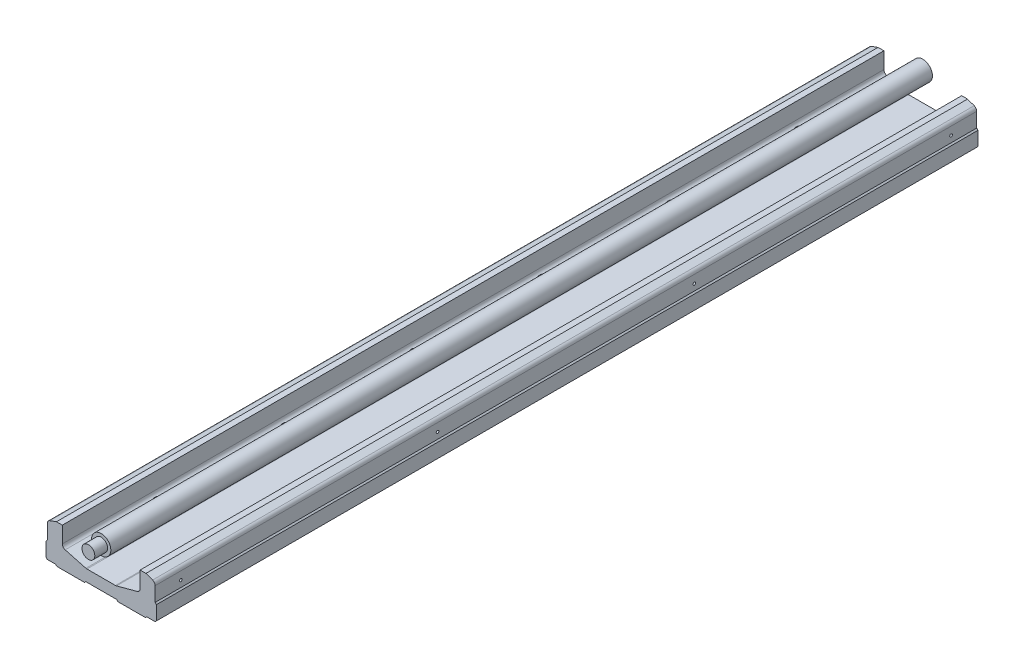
ISO-10303-21;
HEADER;
FILE_DESCRIPTION(('STEP AP214'),'2;1');
FILE_NAME('part.step','',(''),(''),'','','');
FILE_SCHEMA(('AUTOMOTIVE_DESIGN { 1 0 10303 214 1 1 1 1 }'));
ENDSEC;
DATA;
#1=APPLICATION_CONTEXT('core data for automotive mechanical design processes');
#2=APPLICATION_PROTOCOL_DEFINITION('international standard','automotive_design',2000,#1);
#3=PRODUCT_CONTEXT('',#1,'mechanical');
#4=PRODUCT('Part','Part','',(#3));
#5=PRODUCT_RELATED_PRODUCT_CATEGORY('part','',(#4));
#6=PRODUCT_DEFINITION_FORMATION('','',#4);
#7=PRODUCT_DEFINITION_CONTEXT('part definition',#1,'design');
#8=PRODUCT_DEFINITION('design','',#6,#7);
#9=PRODUCT_DEFINITION_SHAPE('','',#8);
#10=(LENGTH_UNIT() NAMED_UNIT(*) SI_UNIT(.MILLI.,.METRE.));
#11=(NAMED_UNIT(*) PLANE_ANGLE_UNIT() SI_UNIT($,.RADIAN.));
#12=(NAMED_UNIT(*) SI_UNIT($,.STERADIAN.) SOLID_ANGLE_UNIT());
#13=UNCERTAINTY_MEASURE_WITH_UNIT(LENGTH_MEASURE(1.E-05),#10,'distance_accuracy_value','');
#14=(GEOMETRIC_REPRESENTATION_CONTEXT(3) GLOBAL_UNCERTAINTY_ASSIGNED_CONTEXT((#13)) GLOBAL_UNIT_ASSIGNED_CONTEXT((#10,
#11,#12)) REPRESENTATION_CONTEXT('',''));
#15=CARTESIAN_POINT('',(0.,0.,0.));
#16=DIRECTION('',(0.,0.,1.));
#17=DIRECTION('',(1.,0.,0.));
#18=AXIS2_PLACEMENT_3D('',#15,#16,#17);
#19=CARTESIAN_POINT('',(-0.269034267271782,17.5380685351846,650.));
#20=DIRECTION('',(0.,0.,1.));
#21=DIRECTION('',(1.,0.,0.));
#22=AXIS2_PLACEMENT_3D('',#19,#20,#21);
#23=PLANE('',#22);
#24=CARTESIAN_POINT('',(-0.269034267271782,17.5380685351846,650.));
#25=DIRECTION('',(0.,0.,-1.));
#26=DIRECTION('',(-1.,0.,0.));
#27=AXIS2_PLACEMENT_3D('',#24,#25,#26);
#28=CIRCLE('',#27,5.);
#29=CARTESIAN_POINT('',(-5.26903426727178,17.5380685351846,650.));
#30=VERTEX_POINT('',#29);
#31=EDGE_CURVE('P0_E18',#30,#30,#28,.T.);
#32=ORIENTED_EDGE('',*,*,#31,.F.);
#33=EDGE_LOOP('',(#32));
#34=FACE_BOUND('',#33,.T.);
#35=ADVANCED_FACE('P0_F15',(#34),#23,.T.);
#36=CARTESIAN_POINT('',(-0.269034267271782,17.5380685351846,650.));
#37=DIRECTION('',(0.,0.,-1.));
#38=DIRECTION('',(-1.,0.,0.));
#39=AXIS2_PLACEMENT_3D('',#36,#37,#38);
#40=CYLINDRICAL_SURFACE('',#39,5.);
#41=CARTESIAN_POINT('',(-0.269034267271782,17.5380685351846,640.));
#42=DIRECTION('',(0.,0.,-1.));
#43=DIRECTION('',(-1.,0.,0.));
#44=AXIS2_PLACEMENT_3D('',#41,#42,#43);
#45=CIRCLE('',#44,5.);
#46=CARTESIAN_POINT('',(-5.26903426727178,17.5380685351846,640.));
#47=VERTEX_POINT('',#46);
#48=EDGE_CURVE('P0_E31',#47,#47,#45,.T.);
#49=ORIENTED_EDGE('',*,*,#48,.F.);
#50=EDGE_LOOP('',(#49));
#51=FACE_BOUND('',#50,.T.);
#52=ORIENTED_EDGE('',*,*,#31,.T.);
#53=EDGE_LOOP('',(#52));
#54=FACE_BOUND('',#53,.T.);
#55=ADVANCED_FACE('P0_F40',(#51,#54),#40,.T.);
#56=CARTESIAN_POINT('',(-0.269034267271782,17.5380685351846,640.));
#57=DIRECTION('',(0.,0.,1.));
#58=DIRECTION('',(1.,0.,0.));
#59=AXIS2_PLACEMENT_3D('',#56,#57,#58);
#60=PLANE('',#59);
#61=CARTESIAN_POINT('',(-0.269034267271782,17.5380685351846,640.));
#62=DIRECTION('',(0.,0.,-1.));
#63=DIRECTION('',(-1.,0.,0.));
#64=AXIS2_PLACEMENT_3D('',#61,#62,#63);
#65=CIRCLE('',#64,7.5);
#66=CARTESIAN_POINT('',(-7.76903426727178,17.5380685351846,640.));
#67=VERTEX_POINT('',#66);
#68=EDGE_CURVE('P0_E23',#67,#67,#65,.T.);
#69=ORIENTED_EDGE('',*,*,#68,.F.);
#70=EDGE_LOOP('',(#69));
#71=FACE_BOUND('',#70,.T.);
#72=ORIENTED_EDGE('',*,*,#48,.T.);
#73=EDGE_LOOP('',(#72));
#74=FACE_BOUND('',#73,.T.);
#75=ADVANCED_FACE('P0_F47',(#71,#74),#60,.T.);
#76=CARTESIAN_POINT('',(-0.269034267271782,17.5380685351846,0.));
#77=DIRECTION('',(0.,0.,1.));
#78=DIRECTION('',(1.,0.,0.));
#79=AXIS2_PLACEMENT_3D('',#76,#77,#78);
#80=PLANE('',#79);
#81=CARTESIAN_POINT('',(-0.269034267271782,17.5380685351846,0.));
#82=DIRECTION('',(0.,0.,-1.));
#83=DIRECTION('',(-1.,0.,0.));
#84=AXIS2_PLACEMENT_3D('',#81,#82,#83);
#85=CIRCLE('',#84,7.5);
#86=CARTESIAN_POINT('',(-7.76903426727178,17.5380685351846,0.));
#87=VERTEX_POINT('',#86);
#88=EDGE_CURVE('P0_E10',#87,#87,#85,.F.);
#89=ORIENTED_EDGE('',*,*,#88,.F.);
#90=EDGE_LOOP('',(#89));
#91=FACE_BOUND('',#90,.T.);
#92=ADVANCED_FACE('P0_F51',(#91),#80,.F.);
#93=CARTESIAN_POINT('',(-0.269034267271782,17.5380685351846,640.));
#94=DIRECTION('',(0.,0.,-1.));
#95=DIRECTION('',(-1.,0.,0.));
#96=AXIS2_PLACEMENT_3D('',#93,#94,#95);
#97=CYLINDRICAL_SURFACE('',#96,7.5);
#98=ORIENTED_EDGE('',*,*,#88,.T.);
#99=EDGE_LOOP('',(#98));
#100=FACE_BOUND('',#99,.T.);
#101=ORIENTED_EDGE('',*,*,#68,.T.);
#102=EDGE_LOOP('',(#101));
#103=FACE_BOUND('',#102,.T.);
#104=ADVANCED_FACE('P0_F49',(#100,#103),#97,.T.);
#105=CLOSED_SHELL('',(#35,#55,#75,#92,#104));
#106=MANIFOLD_SOLID_BREP('P0_B1',#105);
#107=CARTESIAN_POINT('',(-36.0190342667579,4.53806853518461,420.));
#108=DIRECTION('',(-1.,0.,0.));
#109=DIRECTION('',(0.,0.,1.));
#110=AXIS2_PLACEMENT_3D('',#107,#108,#109);
#111=CONICAL_SURFACE('',#110,1.02500000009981,1.02974425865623);
#112=CARTESIAN_POINT('',(-35.4031521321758,4.53806853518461,420.));
#113=VERTEX_POINT('',#112);
#114=VERTEX_LOOP('',#113);
#115=FACE_BOUND('',#114,.T.);
#116=CARTESIAN_POINT('',(-36.0190342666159,4.53806853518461,420.));
#117=DIRECTION('',(-1.,0.,0.));
#118=DIRECTION('',(0.,0.,1.));
#119=AXIS2_PLACEMENT_3D('',#116,#117,#118);
#120=CIRCLE('',#119,1.025);
#121=CARTESIAN_POINT('',(-36.0190342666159,4.53806853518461,421.025));
#122=VERTEX_POINT('',#121);
#123=EDGE_CURVE('P1_E732',#122,#122,#120,.T.);
#124=ORIENTED_EDGE('',*,*,#123,.T.);
#125=EDGE_LOOP('',(#124));
#126=FACE_BOUND('',#125,.T.);
#127=ADVANCED_FACE('P1_F17',(#115,#126),#111,.F.);
#128=CARTESIAN_POINT('',(-36.0190342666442,4.53806853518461,620.));
#129=DIRECTION('',(-1.,0.,0.));
#130=DIRECTION('',(0.,0.,1.));
#131=AXIS2_PLACEMENT_3D('',#128,#129,#130);
#132=CONICAL_SURFACE('',#131,1.02499999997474,1.02974425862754);
#133=CARTESIAN_POINT('',(-35.403152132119,4.53806853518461,620.));
#134=VERTEX_POINT('',#133);
#135=VERTEX_LOOP('',#134);
#136=FACE_BOUND('',#135,.T.);
#137=CARTESIAN_POINT('',(-36.0190342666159,4.53806853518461,620.));
#138=DIRECTION('',(-1.,0.,0.));
#139=DIRECTION('',(0.,0.,1.));
#140=AXIS2_PLACEMENT_3D('',#137,#138,#139);
#141=CIRCLE('',#140,1.02499999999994);
#142=CARTESIAN_POINT('',(-36.0190342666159,4.53806853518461,621.025));
#143=VERTEX_POINT('',#142);
#144=EDGE_CURVE('P1_E728',#143,#143,#141,.T.);
#145=ORIENTED_EDGE('',*,*,#144,.T.);
#146=EDGE_LOOP('',(#145));
#147=FACE_BOUND('',#146,.T.);
#148=ADVANCED_FACE('P1_F1121',(#136,#147),#132,.F.);
#149=CARTESIAN_POINT('',(-36.0190342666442,4.53806853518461,220.));
#150=DIRECTION('',(-1.,0.,0.));
#151=DIRECTION('',(0.,0.,1.));
#152=AXIS2_PLACEMENT_3D('',#149,#150,#151);
#153=CONICAL_SURFACE('',#152,1.02499999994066,1.02974425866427);
#154=CARTESIAN_POINT('',(-35.4031521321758,4.53806853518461,220.));
#155=VERTEX_POINT('',#154);
#156=VERTEX_LOOP('',#155);
#157=FACE_BOUND('',#156,.T.);
#158=CARTESIAN_POINT('',(-36.0190342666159,4.53806853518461,220.));
#159=DIRECTION('',(-1.,0.,0.));
#160=DIRECTION('',(0.,0.,1.));
#161=AXIS2_PLACEMENT_3D('',#158,#159,#160);
#162=CIRCLE('',#161,1.025);
#163=CARTESIAN_POINT('',(-36.0190342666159,4.53806853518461,221.025));
#164=VERTEX_POINT('',#163);
#165=EDGE_CURVE('P1_E724',#164,#164,#162,.T.);
#166=ORIENTED_EDGE('',*,*,#165,.T.);
#167=EDGE_LOOP('',(#166));
#168=FACE_BOUND('',#167,.T.);
#169=ADVANCED_FACE('P1_F1118',(#157,#168),#153,.F.);
#170=CARTESIAN_POINT('',(-36.0190342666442,4.53806853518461,19.9999999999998));
#171=DIRECTION('',(-1.,0.,0.));
#172=DIRECTION('',(0.,0.,1.));
#173=AXIS2_PLACEMENT_3D('',#170,#171,#172);
#174=CONICAL_SURFACE('',#173,1.02499999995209,1.02974425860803);
#175=CARTESIAN_POINT('',(-35.403152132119,4.53806853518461,19.9999999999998));
#176=VERTEX_POINT('',#175);
#177=VERTEX_LOOP('',#176);
#178=FACE_BOUND('',#177,.T.);
#179=CARTESIAN_POINT('',(-36.0190342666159,4.53806853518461,19.9999999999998));
#180=DIRECTION('',(-1.,0.,0.));
#181=DIRECTION('',(0.,0.,1.));
#182=AXIS2_PLACEMENT_3D('',#179,#180,#181);
#183=CIRCLE('',#182,1.02499999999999);
#184=CARTESIAN_POINT('',(-36.0190342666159,4.53806853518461,21.0249999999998));
#185=VERTEX_POINT('',#184);
#186=EDGE_CURVE('P1_E663',#185,#185,#183,.T.);
#187=ORIENTED_EDGE('',*,*,#186,.T.);
#188=EDGE_LOOP('',(#187));
#189=FACE_BOUND('',#188,.T.);
#190=ADVANCED_FACE('P1_F1114',(#178,#189),#174,.F.);
#191=CARTESIAN_POINT('',(35.4809657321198,4.53806853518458,19.9999999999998));
#192=DIRECTION('',(1.,0.,0.));
#193=DIRECTION('',(0.,0.,-1.));
#194=AXIS2_PLACEMENT_3D('',#191,#192,#193);
#195=CONICAL_SURFACE('',#194,1.02500000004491,1.02974425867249);
#196=CARTESIAN_POINT('',(34.8650835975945,4.53806853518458,19.9999999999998));
#197=VERTEX_POINT('',#196);
#198=VERTEX_LOOP('',#197);
#199=FACE_BOUND('',#198,.T.);
#200=CARTESIAN_POINT('',(35.4809657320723,4.53806853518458,19.9999999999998));
#201=DIRECTION('',(1.,0.,0.));
#202=DIRECTION('',(0.,0.,-1.));
#203=AXIS2_PLACEMENT_3D('',#200,#201,#202);
#204=CIRCLE('',#203,1.02499999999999);
#205=CARTESIAN_POINT('',(35.4809657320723,4.53806853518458,18.9749999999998));
#206=VERTEX_POINT('',#205);
#207=EDGE_CURVE('P1_E634',#206,#206,#204,.T.);
#208=ORIENTED_EDGE('',*,*,#207,.T.);
#209=EDGE_LOOP('',(#208));
#210=FACE_BOUND('',#209,.T.);
#211=ADVANCED_FACE('P1_F1110',(#199,#210),#195,.F.);
#212=CARTESIAN_POINT('',(35.4809657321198,4.53806853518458,220.));
#213=DIRECTION('',(1.,0.,0.));
#214=DIRECTION('',(0.,0.,-1.));
#215=AXIS2_PLACEMENT_3D('',#212,#213,#214);
#216=CONICAL_SURFACE('',#215,1.02500000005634,1.02974425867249);
#217=CARTESIAN_POINT('',(34.8650835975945,4.53806853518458,220.));
#218=VERTEX_POINT('',#217);
#219=VERTEX_LOOP('',#218);
#220=FACE_BOUND('',#219,.T.);
#221=CARTESIAN_POINT('',(35.4809657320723,4.53806853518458,220.));
#222=DIRECTION('',(1.,0.,0.));
#223=DIRECTION('',(0.,0.,-1.));
#224=AXIS2_PLACEMENT_3D('',#221,#222,#223);
#225=CIRCLE('',#224,1.025);
#226=CARTESIAN_POINT('',(35.4809657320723,4.53806853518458,218.975));
#227=VERTEX_POINT('',#226);
#228=EDGE_CURVE('P1_E695',#227,#227,#225,.T.);
#229=ORIENTED_EDGE('',*,*,#228,.T.);
#230=EDGE_LOOP('',(#229));
#231=FACE_BOUND('',#230,.T.);
#232=ADVANCED_FACE('P1_F1106',(#220,#231),#216,.F.);
#233=CARTESIAN_POINT('',(35.4809657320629,4.53806853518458,420.));
#234=DIRECTION('',(1.,0.,0.));
#235=DIRECTION('',(0.,0.,-1.));
#236=AXIS2_PLACEMENT_3D('',#233,#234,#235);
#237=CONICAL_SURFACE('',#236,1.02499999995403,1.02974425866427);
#238=CARTESIAN_POINT('',(34.8650835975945,4.53806853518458,420.));
#239=VERTEX_POINT('',#238);
#240=VERTEX_LOOP('',#239);
#241=FACE_BOUND('',#240,.T.);
#242=CARTESIAN_POINT('',(35.4809657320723,4.53806853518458,420.));
#243=DIRECTION('',(1.,0.,0.));
#244=DIRECTION('',(0.,0.,-1.));
#245=AXIS2_PLACEMENT_3D('',#242,#243,#244);
#246=CIRCLE('',#245,1.025);
#247=CARTESIAN_POINT('',(35.4809657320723,4.53806853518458,418.975));
#248=VERTEX_POINT('',#247);
#249=EDGE_CURVE('P1_E691',#248,#248,#246,.T.);
#250=ORIENTED_EDGE('',*,*,#249,.T.);
#251=EDGE_LOOP('',(#250));
#252=FACE_BOUND('',#251,.T.);
#253=ADVANCED_FACE('P1_F1102',(#241,#252),#237,.F.);
#254=CARTESIAN_POINT('',(35.4809657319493,4.53806853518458,620.));
#255=DIRECTION('',(1.,0.,0.));
#256=DIRECTION('',(0.,0.,-1.));
#257=AXIS2_PLACEMENT_3D('',#254,#255,#256);
#258=CONICAL_SURFACE('',#257,1.02499999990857,1.02974425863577);
#259=CARTESIAN_POINT('',(34.8650835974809,4.53806853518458,620.));
#260=VERTEX_POINT('',#259);
#261=VERTEX_LOOP('',#260);
#262=FACE_BOUND('',#261,.T.);
#263=CARTESIAN_POINT('',(35.4809657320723,4.53806853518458,620.));
#264=DIRECTION('',(1.,0.,0.));
#265=DIRECTION('',(0.,0.,-1.));
#266=AXIS2_PLACEMENT_3D('',#263,#264,#265);
#267=CIRCLE('',#266,1.02499999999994);
#268=CARTESIAN_POINT('',(35.4809657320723,4.53806853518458,618.975));
#269=VERTEX_POINT('',#268);
#270=EDGE_CURVE('P1_E628',#269,#269,#267,.T.);
#271=ORIENTED_EDGE('',*,*,#270,.T.);
#272=EDGE_LOOP('',(#271));
#273=FACE_BOUND('',#272,.T.);
#274=ADVANCED_FACE('P1_F1098',(#262,#273),#258,.F.);
#275=CARTESIAN_POINT('',(26.0309657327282,-9.96193146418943,170.));
#276=DIRECTION('',(0.,-1.,0.));
#277=DIRECTION('',(0.,0.,-1.));
#278=AXIS2_PLACEMENT_3D('',#275,#276,#277);
#279=PLANE('',#278);
#280=CARTESIAN_POINT('',(22.7309657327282,-9.96193146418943,170.));
#281=DIRECTION('',(0.,1.,0.));
#282=DIRECTION('',(0.,0.,1.));
#283=AXIS2_PLACEMENT_3D('',#280,#281,#282);
#284=CIRCLE('',#283,5.50000000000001);
#285=CARTESIAN_POINT('',(22.7309657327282,-9.96193146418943,175.5));
#286=VERTEX_POINT('',#285);
#287=EDGE_CURVE('P1_E622',#286,#286,#284,.T.);
#288=ORIENTED_EDGE('',*,*,#287,.T.);
#289=EDGE_LOOP('',(#288));
#290=FACE_BOUND('',#289,.T.);
#291=CARTESIAN_POINT('',(22.7309657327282,-9.96193146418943,170.));
#292=DIRECTION('',(0.,1.,0.));
#293=DIRECTION('',(0.,0.,1.));
#294=AXIS2_PLACEMENT_3D('',#291,#292,#293);
#295=CIRCLE('',#294,3.3);
#296=CARTESIAN_POINT('',(22.7309657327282,-9.96193146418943,173.3));
#297=VERTEX_POINT('',#296);
#298=EDGE_CURVE('P1_E1371',#297,#297,#295,.F.);
#299=ORIENTED_EDGE('',*,*,#298,.T.);
#300=EDGE_LOOP('',(#299));
#301=FACE_BOUND('',#300,.T.);
#302=ADVANCED_FACE('P1_F1094',(#290,#301),#279,.F.);
#303=CARTESIAN_POINT('',(26.0309657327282,-9.96193146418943,270.));
#304=DIRECTION('',(0.,-1.,0.));
#305=DIRECTION('',(0.,0.,-1.));
#306=AXIS2_PLACEMENT_3D('',#303,#304,#305);
#307=PLANE('',#306);
#308=CARTESIAN_POINT('',(22.7309657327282,-9.96193146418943,270.));
#309=DIRECTION('',(0.,1.,0.));
#310=DIRECTION('',(0.,0.,1.));
#311=AXIS2_PLACEMENT_3D('',#308,#309,#310);
#312=CIRCLE('',#311,5.50000000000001);
#313=CARTESIAN_POINT('',(22.7309657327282,-9.96193146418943,275.5));
#314=VERTEX_POINT('',#313);
#315=EDGE_CURVE('P1_E1313',#314,#314,#312,.T.);
#316=ORIENTED_EDGE('',*,*,#315,.T.);
#317=EDGE_LOOP('',(#316));
#318=FACE_BOUND('',#317,.T.);
#319=CARTESIAN_POINT('',(22.7309657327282,-9.96193146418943,270.));
#320=DIRECTION('',(0.,1.,0.));
#321=DIRECTION('',(0.,0.,1.));
#322=AXIS2_PLACEMENT_3D('',#319,#320,#321);
#323=CIRCLE('',#322,3.29999999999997);
#324=CARTESIAN_POINT('',(22.7309657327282,-9.96193146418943,273.3));
#325=VERTEX_POINT('',#324);
#326=EDGE_CURVE('P1_E1407',#325,#325,#323,.F.);
#327=ORIENTED_EDGE('',*,*,#326,.T.);
#328=EDGE_LOOP('',(#327));
#329=FACE_BOUND('',#328,.T.);
#330=ADVANCED_FACE('P1_F1090',(#318,#329),#307,.F.);
#331=CARTESIAN_POINT('',(26.0309657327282,-9.96193146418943,370.));
#332=DIRECTION('',(0.,-1.,0.));
#333=DIRECTION('',(0.,0.,-1.));
#334=AXIS2_PLACEMENT_3D('',#331,#332,#333);
#335=PLANE('',#334);
#336=CARTESIAN_POINT('',(22.7309657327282,-9.96193146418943,370.));
#337=DIRECTION('',(0.,1.,0.));
#338=DIRECTION('',(0.,0.,1.));
#339=AXIS2_PLACEMENT_3D('',#336,#337,#338);
#340=CIRCLE('',#339,5.50000000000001);
#341=CARTESIAN_POINT('',(22.7309657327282,-9.96193146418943,375.5));
#342=VERTEX_POINT('',#341);
#343=EDGE_CURVE('P1_E1315',#342,#342,#340,.T.);
#344=ORIENTED_EDGE('',*,*,#343,.T.);
#345=EDGE_LOOP('',(#344));
#346=FACE_BOUND('',#345,.T.);
#347=CARTESIAN_POINT('',(22.7309657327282,-9.96193146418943,370.));
#348=DIRECTION('',(0.,1.,0.));
#349=DIRECTION('',(0.,0.,1.));
#350=AXIS2_PLACEMENT_3D('',#347,#348,#349);
#351=CIRCLE('',#350,3.29999999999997);
#352=CARTESIAN_POINT('',(22.7309657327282,-9.96193146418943,373.3));
#353=VERTEX_POINT('',#352);
#354=EDGE_CURVE('P1_E1311',#353,#353,#351,.F.);
#355=ORIENTED_EDGE('',*,*,#354,.T.);
#356=EDGE_LOOP('',(#355));
#357=FACE_BOUND('',#356,.T.);
#358=ADVANCED_FACE('P1_F1086',(#346,#357),#335,.F.);
#359=CARTESIAN_POINT('',(26.0309657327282,-9.96193146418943,470.));
#360=DIRECTION('',(0.,-1.,0.));
#361=DIRECTION('',(0.,0.,-1.));
#362=AXIS2_PLACEMENT_3D('',#359,#360,#361);
#363=PLANE('',#362);
#364=CARTESIAN_POINT('',(22.7309657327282,-9.96193146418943,470.));
#365=DIRECTION('',(0.,1.,0.));
#366=DIRECTION('',(0.,0.,1.));
#367=AXIS2_PLACEMENT_3D('',#364,#365,#366);
#368=CIRCLE('',#367,5.50000000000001);
#369=CARTESIAN_POINT('',(22.7309657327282,-9.96193146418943,475.5));
#370=VERTEX_POINT('',#369);
#371=EDGE_CURVE('P1_E1383',#370,#370,#368,.T.);
#372=ORIENTED_EDGE('',*,*,#371,.T.);
#373=EDGE_LOOP('',(#372));
#374=FACE_BOUND('',#373,.T.);
#375=CARTESIAN_POINT('',(22.7309657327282,-9.96193146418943,470.));
#376=DIRECTION('',(0.,1.,0.));
#377=DIRECTION('',(0.,0.,1.));
#378=AXIS2_PLACEMENT_3D('',#375,#376,#377);
#379=CIRCLE('',#378,3.29999999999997);
#380=CARTESIAN_POINT('',(22.7309657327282,-9.96193146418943,473.3));
#381=VERTEX_POINT('',#380);
#382=EDGE_CURVE('P1_E1308',#381,#381,#379,.F.);
#383=ORIENTED_EDGE('',*,*,#382,.T.);
#384=EDGE_LOOP('',(#383));
#385=FACE_BOUND('',#384,.T.);
#386=ADVANCED_FACE('P1_F1082',(#374,#385),#363,.F.);
#387=CARTESIAN_POINT('',(26.0309657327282,-9.96193146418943,570.));
#388=DIRECTION('',(0.,-1.,0.));
#389=DIRECTION('',(0.,0.,-1.));
#390=AXIS2_PLACEMENT_3D('',#387,#388,#389);
#391=PLANE('',#390);
#392=CARTESIAN_POINT('',(22.7309657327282,-9.96193146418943,570.));
#393=DIRECTION('',(0.,1.,0.));
#394=DIRECTION('',(0.,0.,1.));
#395=AXIS2_PLACEMENT_3D('',#392,#393,#394);
#396=CIRCLE('',#395,5.49999999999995);
#397=CARTESIAN_POINT('',(22.7309657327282,-9.96193146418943,575.5));
#398=VERTEX_POINT('',#397);
#399=EDGE_CURVE('P1_E1364',#398,#398,#396,.T.);
#400=ORIENTED_EDGE('',*,*,#399,.T.);
#401=EDGE_LOOP('',(#400));
#402=FACE_BOUND('',#401,.T.);
#403=CARTESIAN_POINT('',(22.7309657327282,-9.96193146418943,570.));
#404=DIRECTION('',(0.,1.,0.));
#405=DIRECTION('',(0.,0.,1.));
#406=AXIS2_PLACEMENT_3D('',#403,#404,#405);
#407=CIRCLE('',#406,3.29999999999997);
#408=CARTESIAN_POINT('',(22.7309657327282,-9.96193146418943,573.3));
#409=VERTEX_POINT('',#408);
#410=EDGE_CURVE('P1_E644',#409,#409,#407,.F.);
#411=ORIENTED_EDGE('',*,*,#410,.T.);
#412=EDGE_LOOP('',(#411));
#413=FACE_BOUND('',#412,.T.);
#414=ADVANCED_FACE('P1_F1078',(#402,#413),#391,.F.);
#415=CARTESIAN_POINT('',(26.0309657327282,-9.96193146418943,70.0000000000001));
#416=DIRECTION('',(0.,-1.,0.));
#417=DIRECTION('',(0.,0.,-1.));
#418=AXIS2_PLACEMENT_3D('',#415,#416,#417);
#419=PLANE('',#418);
#420=CARTESIAN_POINT('',(22.7309657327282,-9.96193146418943,70.0000000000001));
#421=DIRECTION('',(0.,1.,0.));
#422=DIRECTION('',(0.,0.,1.));
#423=AXIS2_PLACEMENT_3D('',#420,#421,#422);
#424=CIRCLE('',#423,5.49999999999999);
#425=CARTESIAN_POINT('',(22.7309657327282,-9.96193146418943,75.5000000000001));
#426=VERTEX_POINT('',#425);
#427=EDGE_CURVE('P1_E333',#426,#426,#424,.T.);
#428=ORIENTED_EDGE('',*,*,#427,.T.);
#429=EDGE_LOOP('',(#428));
#430=FACE_BOUND('',#429,.T.);
#431=CARTESIAN_POINT('',(22.7309657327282,-9.96193146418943,70.0000000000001));
#432=DIRECTION('',(0.,1.,0.));
#433=DIRECTION('',(0.,0.,1.));
#434=AXIS2_PLACEMENT_3D('',#431,#432,#433);
#435=CIRCLE('',#434,3.3);
#436=CARTESIAN_POINT('',(22.7309657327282,-9.96193146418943,73.3000000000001));
#437=VERTEX_POINT('',#436);
#438=EDGE_CURVE('P1_E648',#437,#437,#435,.F.);
#439=ORIENTED_EDGE('',*,*,#438,.T.);
#440=EDGE_LOOP('',(#439));
#441=FACE_BOUND('',#440,.T.);
#442=ADVANCED_FACE('P1_F1074',(#430,#441),#419,.F.);
#443=CARTESIAN_POINT('',(-19.9690342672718,-9.96193146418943,170.));
#444=DIRECTION('',(0.,-1.,0.));
#445=DIRECTION('',(0.,0.,-1.));
#446=AXIS2_PLACEMENT_3D('',#443,#444,#445);
#447=PLANE('',#446);
#448=CARTESIAN_POINT('',(-23.2690342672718,-9.96193146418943,170.));
#449=DIRECTION('',(0.,1.,0.));
#450=DIRECTION('',(0.,0.,1.));
#451=AXIS2_PLACEMENT_3D('',#448,#449,#450);
#452=CIRCLE('',#451,5.50000000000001);
#453=CARTESIAN_POINT('',(-23.2690342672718,-9.96193146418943,175.5));
#454=VERTEX_POINT('',#453);
#455=EDGE_CURVE('P1_E1291',#454,#454,#452,.T.);
#456=ORIENTED_EDGE('',*,*,#455,.T.);
#457=EDGE_LOOP('',(#456));
#458=FACE_BOUND('',#457,.T.);
#459=CARTESIAN_POINT('',(-23.2690342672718,-9.96193146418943,170.));
#460=DIRECTION('',(0.,1.,0.));
#461=DIRECTION('',(0.,0.,1.));
#462=AXIS2_PLACEMENT_3D('',#459,#460,#461);
#463=CIRCLE('',#462,3.3);
#464=CARTESIAN_POINT('',(-23.2690342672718,-9.96193146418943,173.3));
#465=VERTEX_POINT('',#464);
#466=EDGE_CURVE('P1_E1322',#465,#465,#463,.F.);
#467=ORIENTED_EDGE('',*,*,#466,.T.);
#468=EDGE_LOOP('',(#467));
#469=FACE_BOUND('',#468,.T.);
#470=ADVANCED_FACE('P1_F1070',(#458,#469),#447,.F.);
#471=CARTESIAN_POINT('',(-19.9690342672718,-9.96193146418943,270.));
#472=DIRECTION('',(0.,-1.,0.));
#473=DIRECTION('',(0.,0.,-1.));
#474=AXIS2_PLACEMENT_3D('',#471,#472,#473);
#475=PLANE('',#474);
#476=CARTESIAN_POINT('',(-23.2690342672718,-9.96193146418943,270.));
#477=DIRECTION('',(0.,1.,0.));
#478=DIRECTION('',(0.,0.,1.));
#479=AXIS2_PLACEMENT_3D('',#476,#477,#478);
#480=CIRCLE('',#479,5.50000000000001);
#481=CARTESIAN_POINT('',(-23.2690342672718,-9.96193146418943,275.5));
#482=VERTEX_POINT('',#481);
#483=EDGE_CURVE('P1_E1289',#482,#482,#480,.T.);
#484=ORIENTED_EDGE('',*,*,#483,.T.);
#485=EDGE_LOOP('',(#484));
#486=FACE_BOUND('',#485,.T.);
#487=CARTESIAN_POINT('',(-23.2690342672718,-9.96193146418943,270.));
#488=DIRECTION('',(0.,1.,0.));
#489=DIRECTION('',(0.,0.,1.));
#490=AXIS2_PLACEMENT_3D('',#487,#488,#489);
#491=CIRCLE('',#490,3.29999999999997);
#492=CARTESIAN_POINT('',(-23.2690342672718,-9.96193146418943,273.3));
#493=VERTEX_POINT('',#492);
#494=EDGE_CURVE('P1_E1323',#493,#493,#491,.F.);
#495=ORIENTED_EDGE('',*,*,#494,.T.);
#496=EDGE_LOOP('',(#495));
#497=FACE_BOUND('',#496,.T.);
#498=ADVANCED_FACE('P1_F1066',(#486,#497),#475,.F.);
#499=CARTESIAN_POINT('',(-19.9690342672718,-9.96193146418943,370.));
#500=DIRECTION('',(0.,-1.,0.));
#501=DIRECTION('',(0.,0.,-1.));
#502=AXIS2_PLACEMENT_3D('',#499,#500,#501);
#503=PLANE('',#502);
#504=CARTESIAN_POINT('',(-23.2690342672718,-9.96193146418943,370.));
#505=DIRECTION('',(0.,1.,0.));
#506=DIRECTION('',(0.,0.,1.));
#507=AXIS2_PLACEMENT_3D('',#504,#505,#506);
#508=CIRCLE('',#507,5.50000000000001);
#509=CARTESIAN_POINT('',(-23.2690342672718,-9.96193146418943,375.5));
#510=VERTEX_POINT('',#509);
#511=EDGE_CURVE('P1_E1285',#510,#510,#508,.T.);
#512=ORIENTED_EDGE('',*,*,#511,.T.);
#513=EDGE_LOOP('',(#512));
#514=FACE_BOUND('',#513,.T.);
#515=CARTESIAN_POINT('',(-23.2690342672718,-9.96193146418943,370.));
#516=DIRECTION('',(0.,1.,0.));
#517=DIRECTION('',(0.,0.,1.));
#518=AXIS2_PLACEMENT_3D('',#515,#516,#517);
#519=CIRCLE('',#518,3.29999999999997);
#520=CARTESIAN_POINT('',(-23.2690342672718,-9.96193146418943,373.3));
#521=VERTEX_POINT('',#520);
#522=EDGE_CURVE('P1_E1325',#521,#521,#519,.F.);
#523=ORIENTED_EDGE('',*,*,#522,.T.);
#524=EDGE_LOOP('',(#523));
#525=FACE_BOUND('',#524,.T.);
#526=ADVANCED_FACE('P1_F1062',(#514,#525),#503,.F.);
#527=CARTESIAN_POINT('',(-19.9690342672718,-9.96193146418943,470.));
#528=DIRECTION('',(0.,-1.,0.));
#529=DIRECTION('',(0.,0.,-1.));
#530=AXIS2_PLACEMENT_3D('',#527,#528,#529);
#531=PLANE('',#530);
#532=CARTESIAN_POINT('',(-23.2690342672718,-9.96193146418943,470.));
#533=DIRECTION('',(0.,1.,0.));
#534=DIRECTION('',(0.,0.,1.));
#535=AXIS2_PLACEMENT_3D('',#532,#533,#534);
#536=CIRCLE('',#535,5.50000000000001);
#537=CARTESIAN_POINT('',(-23.2690342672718,-9.96193146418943,475.5));
#538=VERTEX_POINT('',#537);
#539=EDGE_CURVE('P1_E1288',#538,#538,#536,.T.);
#540=ORIENTED_EDGE('',*,*,#539,.T.);
#541=EDGE_LOOP('',(#540));
#542=FACE_BOUND('',#541,.T.);
#543=CARTESIAN_POINT('',(-23.2690342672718,-9.96193146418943,470.));
#544=DIRECTION('',(0.,1.,0.));
#545=DIRECTION('',(0.,0.,1.));
#546=AXIS2_PLACEMENT_3D('',#543,#544,#545);
#547=CIRCLE('',#546,3.29999999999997);
#548=CARTESIAN_POINT('',(-23.2690342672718,-9.96193146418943,473.3));
#549=VERTEX_POINT('',#548);
#550=EDGE_CURVE('P1_E1391',#549,#549,#547,.F.);
#551=ORIENTED_EDGE('',*,*,#550,.T.);
#552=EDGE_LOOP('',(#551));
#553=FACE_BOUND('',#552,.T.);
#554=ADVANCED_FACE('P1_F1058',(#542,#553),#531,.F.);
#555=CARTESIAN_POINT('',(-19.9690342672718,-9.96193146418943,570.));
#556=DIRECTION('',(0.,-1.,0.));
#557=DIRECTION('',(0.,0.,-1.));
#558=AXIS2_PLACEMENT_3D('',#555,#556,#557);
#559=PLANE('',#558);
#560=CARTESIAN_POINT('',(-23.2690342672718,-9.96193146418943,570.));
#561=DIRECTION('',(0.,1.,0.));
#562=DIRECTION('',(0.,0.,1.));
#563=AXIS2_PLACEMENT_3D('',#560,#561,#562);
#564=CIRCLE('',#563,5.49999999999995);
#565=CARTESIAN_POINT('',(-23.2690342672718,-9.96193146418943,575.5));
#566=VERTEX_POINT('',#565);
#567=EDGE_CURVE('P1_E1304',#566,#566,#564,.T.);
#568=ORIENTED_EDGE('',*,*,#567,.T.);
#569=EDGE_LOOP('',(#568));
#570=FACE_BOUND('',#569,.T.);
#571=CARTESIAN_POINT('',(-23.2690342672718,-9.96193146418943,570.));
#572=DIRECTION('',(0.,1.,0.));
#573=DIRECTION('',(0.,0.,1.));
#574=AXIS2_PLACEMENT_3D('',#571,#572,#573);
#575=CIRCLE('',#574,3.29999999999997);
#576=CARTESIAN_POINT('',(-23.2690342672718,-9.96193146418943,573.3));
#577=VERTEX_POINT('',#576);
#578=EDGE_CURVE('P1_E652',#577,#577,#575,.F.);
#579=ORIENTED_EDGE('',*,*,#578,.T.);
#580=EDGE_LOOP('',(#579));
#581=FACE_BOUND('',#580,.T.);
#582=ADVANCED_FACE('P1_F1054',(#570,#581),#559,.F.);
#583=CARTESIAN_POINT('',(-19.9690342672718,-9.96193146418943,70.0000000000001));
#584=DIRECTION('',(0.,-1.,0.));
#585=DIRECTION('',(0.,0.,-1.));
#586=AXIS2_PLACEMENT_3D('',#583,#584,#585);
#587=PLANE('',#586);
#588=CARTESIAN_POINT('',(-23.2690342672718,-9.96193146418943,70.0000000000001));
#589=DIRECTION('',(0.,1.,0.));
#590=DIRECTION('',(0.,0.,1.));
#591=AXIS2_PLACEMENT_3D('',#588,#589,#590);
#592=CIRCLE('',#591,5.49999999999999);
#593=CARTESIAN_POINT('',(-23.2690342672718,-9.96193146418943,75.5000000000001));
#594=VERTEX_POINT('',#593);
#595=EDGE_CURVE('P1_E604',#594,#594,#592,.T.);
#596=ORIENTED_EDGE('',*,*,#595,.T.);
#597=EDGE_LOOP('',(#596));
#598=FACE_BOUND('',#597,.T.);
#599=CARTESIAN_POINT('',(-23.2690342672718,-9.96193146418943,70.0000000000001));
#600=DIRECTION('',(0.,1.,0.));
#601=DIRECTION('',(0.,0.,1.));
#602=AXIS2_PLACEMENT_3D('',#599,#600,#601);
#603=CIRCLE('',#602,3.3);
#604=CARTESIAN_POINT('',(-23.2690342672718,-9.96193146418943,73.3000000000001));
#605=VERTEX_POINT('',#604);
#606=EDGE_CURVE('P1_E20',#605,#605,#603,.F.);
#607=ORIENTED_EDGE('',*,*,#606,.T.);
#608=EDGE_LOOP('',(#607));
#609=FACE_BOUND('',#608,.T.);
#610=ADVANCED_FACE('P1_F1050',(#598,#609),#587,.F.);
#611=CARTESIAN_POINT('',(-42.2690342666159,4.53806853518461,420.));
#612=DIRECTION('',(-1.,0.,0.));
#613=DIRECTION('',(0.,0.,1.));
#614=AXIS2_PLACEMENT_3D('',#611,#612,#613);
#615=CYLINDRICAL_SURFACE('',#614,1.025);
#616=ORIENTED_EDGE('',*,*,#123,.F.);
#617=EDGE_LOOP('',(#616));
#618=FACE_BOUND('',#617,.T.);
#619=CARTESIAN_POINT('',(-42.2690342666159,4.53806853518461,420.));
#620=DIRECTION('',(-1.,0.,0.));
#621=DIRECTION('',(0.,0.,1.));
#622=AXIS2_PLACEMENT_3D('',#619,#620,#621);
#623=CIRCLE('',#622,1.025);
#624=CARTESIAN_POINT('',(-42.2690342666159,4.53806853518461,421.025));
#625=VERTEX_POINT('',#624);
#626=EDGE_CURVE('P1_E603',#625,#625,#623,.T.);
#627=ORIENTED_EDGE('',*,*,#626,.T.);
#628=EDGE_LOOP('',(#627));
#629=FACE_BOUND('',#628,.T.);
#630=ADVANCED_FACE('P1_F1046',(#618,#629),#615,.F.);
#631=CARTESIAN_POINT('',(-42.2690342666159,4.53806853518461,620.));
#632=DIRECTION('',(-1.,0.,0.));
#633=DIRECTION('',(0.,0.,1.));
#634=AXIS2_PLACEMENT_3D('',#631,#632,#633);
#635=CYLINDRICAL_SURFACE('',#634,1.02499999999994);
#636=ORIENTED_EDGE('',*,*,#144,.F.);
#637=EDGE_LOOP('',(#636));
#638=FACE_BOUND('',#637,.T.);
#639=CARTESIAN_POINT('',(-42.2690342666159,4.53806853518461,620.));
#640=DIRECTION('',(-1.,0.,0.));
#641=DIRECTION('',(0.,0.,1.));
#642=AXIS2_PLACEMENT_3D('',#639,#640,#641);
#643=CIRCLE('',#642,1.02499999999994);
#644=CARTESIAN_POINT('',(-42.2690342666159,4.53806853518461,621.025));
#645=VERTEX_POINT('',#644);
#646=EDGE_CURVE('P1_E593',#645,#645,#643,.T.);
#647=ORIENTED_EDGE('',*,*,#646,.T.);
#648=EDGE_LOOP('',(#647));
#649=FACE_BOUND('',#648,.T.);
#650=ADVANCED_FACE('P1_F1042',(#638,#649),#635,.F.);
#651=CARTESIAN_POINT('',(-42.2690342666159,4.53806853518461,220.));
#652=DIRECTION('',(-1.,0.,0.));
#653=DIRECTION('',(0.,0.,1.));
#654=AXIS2_PLACEMENT_3D('',#651,#652,#653);
#655=CYLINDRICAL_SURFACE('',#654,1.025);
#656=ORIENTED_EDGE('',*,*,#165,.F.);
#657=EDGE_LOOP('',(#656));
#658=FACE_BOUND('',#657,.T.);
#659=CARTESIAN_POINT('',(-42.2690342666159,4.53806853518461,220.));
#660=DIRECTION('',(-1.,0.,0.));
#661=DIRECTION('',(0.,0.,1.));
#662=AXIS2_PLACEMENT_3D('',#659,#660,#661);
#663=CIRCLE('',#662,1.025);
#664=CARTESIAN_POINT('',(-42.2690342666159,4.53806853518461,221.025));
#665=VERTEX_POINT('',#664);
#666=EDGE_CURVE('P1_E597',#665,#665,#663,.T.);
#667=ORIENTED_EDGE('',*,*,#666,.T.);
#668=EDGE_LOOP('',(#667));
#669=FACE_BOUND('',#668,.T.);
#670=ADVANCED_FACE('P1_F1038',(#658,#669),#655,.F.);
#671=CARTESIAN_POINT('',(-42.2690342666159,4.53806853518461,19.9999999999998));
#672=DIRECTION('',(-1.,0.,0.));
#673=DIRECTION('',(0.,0.,1.));
#674=AXIS2_PLACEMENT_3D('',#671,#672,#673);
#675=CYLINDRICAL_SURFACE('',#674,1.02499999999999);
#676=ORIENTED_EDGE('',*,*,#186,.F.);
#677=EDGE_LOOP('',(#676));
#678=FACE_BOUND('',#677,.T.);
#679=CARTESIAN_POINT('',(-42.2690342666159,4.53806853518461,19.9999999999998));
#680=DIRECTION('',(-1.,0.,0.));
#681=DIRECTION('',(0.,0.,1.));
#682=AXIS2_PLACEMENT_3D('',#679,#680,#681);
#683=CIRCLE('',#682,1.02499999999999);
#684=CARTESIAN_POINT('',(-42.2690342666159,4.53806853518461,21.0249999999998));
#685=VERTEX_POINT('',#684);
#686=EDGE_CURVE('P1_E705',#685,#685,#683,.T.);
#687=ORIENTED_EDGE('',*,*,#686,.T.);
#688=EDGE_LOOP('',(#687));
#689=FACE_BOUND('',#688,.T.);
#690=ADVANCED_FACE('P1_F1034',(#678,#689),#675,.F.);
#691=CARTESIAN_POINT('',(-42.2690342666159,-0.461931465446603,640.));
#692=DIRECTION('',(0.707106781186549,-0.707106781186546,0.));
#693=DIRECTION('',(0.707106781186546,0.707106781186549,0.));
#694=AXIS2_PLACEMENT_3D('',#691,#692,#693);
#695=PLANE('',#694);
#696=DIRECTION('',(0.,0.,-1.));
#697=VECTOR('',#696,1.);
#698=CARTESIAN_POINT('',(-43.2690342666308,-1.46193146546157,640.));
#699=LINE('',#698,#697);
#700=CARTESIAN_POINT('',(-43.2690342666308,-1.46193146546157,0.));
#701=VERTEX_POINT('',#700);
#702=CARTESIAN_POINT('',(-43.2690342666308,-1.46193146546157,640.));
#703=VERTEX_POINT('',#702);
#704=EDGE_CURVE('P1_E587',#701,#703,#699,.F.);
#705=ORIENTED_EDGE('',*,*,#704,.T.);
#706=DIRECTION('',(0.707106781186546,0.707106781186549,0.));
#707=VECTOR('',#706,1.);
#708=CARTESIAN_POINT('',(-42.2690342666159,-0.461931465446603,640.));
#709=LINE('',#708,#707);
#710=CARTESIAN_POINT('',(-42.2690342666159,-0.461931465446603,640.));
#711=VERTEX_POINT('',#710);
#712=EDGE_CURVE('P1_E660',#711,#703,#709,.F.);
#713=ORIENTED_EDGE('',*,*,#712,.F.);
#714=DIRECTION('',(0.,0.,-1.));
#715=VECTOR('',#714,1.);
#716=CARTESIAN_POINT('',(-42.2690342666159,-0.461931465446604,640.));
#717=LINE('',#716,#715);
#718=CARTESIAN_POINT('',(-42.2690342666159,-0.461931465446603,0.));
#719=VERTEX_POINT('',#718);
#720=EDGE_CURVE('P1_E592',#711,#719,#717,.T.);
#721=ORIENTED_EDGE('',*,*,#720,.T.);
#722=DIRECTION('',(0.707106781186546,0.707106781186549,0.));
#723=VECTOR('',#722,1.);
#724=CARTESIAN_POINT('',(-42.2690342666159,-0.461931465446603,0.));
#725=LINE('',#724,#723);
#726=EDGE_CURVE('P1_E659',#701,#719,#725,.T.);
#727=ORIENTED_EDGE('',*,*,#726,.F.);
#728=EDGE_LOOP('',(#705,#713,#721,#727));
#729=FACE_BOUND('',#728,.T.);
#730=ADVANCED_FACE('P1_F1030',(#729),#695,.F.);
#731=CARTESIAN_POINT('',(-43.2690342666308,-12.4619314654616,640.));
#732=DIRECTION('',(0.707106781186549,0.707106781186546,0.));
#733=DIRECTION('',(-0.707106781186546,0.707106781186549,0.));
#734=AXIS2_PLACEMENT_3D('',#731,#732,#733);
#735=PLANE('',#734);
#736=DIRECTION('',(0.,0.,1.));
#737=VECTOR('',#736,1.);
#738=CARTESIAN_POINT('',(-42.269034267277,-13.4619314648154,640.));
#739=LINE('',#738,#737);
#740=CARTESIAN_POINT('',(-42.269034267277,-13.4619314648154,0.));
#741=VERTEX_POINT('',#740);
#742=CARTESIAN_POINT('',(-42.269034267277,-13.4619314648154,640.));
#743=VERTEX_POINT('',#742);
#744=EDGE_CURVE('P1_E579',#741,#743,#739,.T.);
#745=ORIENTED_EDGE('',*,*,#744,.T.);
#746=DIRECTION('',(-0.707106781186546,0.707106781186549,0.));
#747=VECTOR('',#746,1.);
#748=CARTESIAN_POINT('',(-43.2690342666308,-12.4619314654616,640.));
#749=LINE('',#748,#747);
#750=CARTESIAN_POINT('',(-43.2690342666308,-12.4619314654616,640.));
#751=VERTEX_POINT('',#750);
#752=EDGE_CURVE('P1_E656',#751,#743,#749,.F.);
#753=ORIENTED_EDGE('',*,*,#752,.F.);
#754=DIRECTION('',(0.,0.,-1.));
#755=VECTOR('',#754,1.);
#756=CARTESIAN_POINT('',(-43.2690342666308,-12.4619314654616,640.));
#757=LINE('',#756,#755);
#758=CARTESIAN_POINT('',(-43.2690342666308,-12.4619314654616,0.));
#759=VERTEX_POINT('',#758);
#760=EDGE_CURVE('P1_E583',#751,#759,#757,.T.);
#761=ORIENTED_EDGE('',*,*,#760,.T.);
#762=DIRECTION('',(-0.707106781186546,0.707106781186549,0.));
#763=VECTOR('',#762,1.);
#764=CARTESIAN_POINT('',(-43.2690342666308,-12.4619314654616,0.));
#765=LINE('',#764,#763);
#766=EDGE_CURVE('P1_E653',#741,#759,#765,.T.);
#767=ORIENTED_EDGE('',*,*,#766,.F.);
#768=EDGE_LOOP('',(#745,#753,#761,#767));
#769=FACE_BOUND('',#768,.T.);
#770=ADVANCED_FACE('P1_F1026',(#769),#735,.F.);
#771=CARTESIAN_POINT('',(-23.2690342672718,15.5380685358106,70.0000000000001));
#772=DIRECTION('',(0.,1.,0.));
#773=DIRECTION('',(0.,0.,1.));
#774=AXIS2_PLACEMENT_3D('',#771,#772,#773);
#775=CYLINDRICAL_SURFACE('',#774,3.3);
#776=CARTESIAN_POINT('',(-23.2690342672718,-14.4619314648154,70.0000000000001));
#777=DIRECTION('',(0.,1.,0.));
#778=DIRECTION('',(0.,0.,1.));
#779=AXIS2_PLACEMENT_3D('',#776,#777,#778);
#780=CIRCLE('',#779,3.3);
#781=CARTESIAN_POINT('',(-23.2690342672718,-14.4619314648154,73.3000000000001));
#782=VERTEX_POINT('',#781);
#783=EDGE_CURVE('P1_E578',#782,#782,#780,.F.);
#784=ORIENTED_EDGE('',*,*,#783,.T.);
#785=EDGE_LOOP('',(#784));
#786=FACE_BOUND('',#785,.T.);
#787=ORIENTED_EDGE('',*,*,#606,.F.);
#788=EDGE_LOOP('',(#787));
#789=FACE_BOUND('',#788,.T.);
#790=ADVANCED_FACE('P1_F1022',(#786,#789),#775,.F.);
#791=CARTESIAN_POINT('',(-23.2690342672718,15.5380685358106,170.));
#792=DIRECTION('',(0.,1.,0.));
#793=DIRECTION('',(0.,0.,1.));
#794=AXIS2_PLACEMENT_3D('',#791,#792,#793);
#795=CYLINDRICAL_SURFACE('',#794,3.3);
#796=CARTESIAN_POINT('',(-23.2690342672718,-14.4619314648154,170.));
#797=DIRECTION('',(0.,1.,0.));
#798=DIRECTION('',(0.,0.,1.));
#799=AXIS2_PLACEMENT_3D('',#796,#797,#798);
#800=CIRCLE('',#799,3.3);
#801=CARTESIAN_POINT('',(-23.2690342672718,-14.4619314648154,173.3));
#802=VERTEX_POINT('',#801);
#803=EDGE_CURVE('P1_E1348',#802,#802,#800,.F.);
#804=ORIENTED_EDGE('',*,*,#803,.T.);
#805=EDGE_LOOP('',(#804));
#806=FACE_BOUND('',#805,.T.);
#807=ORIENTED_EDGE('',*,*,#466,.F.);
#808=EDGE_LOOP('',(#807));
#809=FACE_BOUND('',#808,.T.);
#810=ADVANCED_FACE('P1_F1018',(#806,#809),#795,.F.);
#811=CARTESIAN_POINT('',(-23.2690342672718,15.5380685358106,270.));
#812=DIRECTION('',(0.,1.,0.));
#813=DIRECTION('',(0.,0.,1.));
#814=AXIS2_PLACEMENT_3D('',#811,#812,#813);
#815=CYLINDRICAL_SURFACE('',#814,3.29999999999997);
#816=CARTESIAN_POINT('',(-23.2690342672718,-14.4619314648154,270.));
#817=DIRECTION('',(0.,1.,0.));
#818=DIRECTION('',(0.,0.,1.));
#819=AXIS2_PLACEMENT_3D('',#816,#817,#818);
#820=CIRCLE('',#819,3.29999999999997);
#821=CARTESIAN_POINT('',(-23.2690342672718,-14.4619314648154,273.3));
#822=VERTEX_POINT('',#821);
#823=EDGE_CURVE('P1_E1350',#822,#822,#820,.F.);
#824=ORIENTED_EDGE('',*,*,#823,.T.);
#825=EDGE_LOOP('',(#824));
#826=FACE_BOUND('',#825,.T.);
#827=ORIENTED_EDGE('',*,*,#494,.F.);
#828=EDGE_LOOP('',(#827));
#829=FACE_BOUND('',#828,.T.);
#830=ADVANCED_FACE('P1_F1014',(#826,#829),#815,.F.);
#831=CARTESIAN_POINT('',(-23.2690342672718,15.5380685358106,370.));
#832=DIRECTION('',(0.,1.,0.));
#833=DIRECTION('',(0.,0.,1.));
#834=AXIS2_PLACEMENT_3D('',#831,#832,#833);
#835=CYLINDRICAL_SURFACE('',#834,3.29999999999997);
#836=CARTESIAN_POINT('',(-23.2690342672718,-14.4619314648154,370.));
#837=DIRECTION('',(0.,1.,0.));
#838=DIRECTION('',(0.,0.,1.));
#839=AXIS2_PLACEMENT_3D('',#836,#837,#838);
#840=CIRCLE('',#839,3.29999999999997);
#841=CARTESIAN_POINT('',(-23.2690342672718,-14.4619314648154,373.3));
#842=VERTEX_POINT('',#841);
#843=EDGE_CURVE('P1_E1302',#842,#842,#840,.F.);
#844=ORIENTED_EDGE('',*,*,#843,.T.);
#845=EDGE_LOOP('',(#844));
#846=FACE_BOUND('',#845,.T.);
#847=ORIENTED_EDGE('',*,*,#522,.F.);
#848=EDGE_LOOP('',(#847));
#849=FACE_BOUND('',#848,.T.);
#850=ADVANCED_FACE('P1_F1010',(#846,#849),#835,.F.);
#851=CARTESIAN_POINT('',(-23.2690342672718,15.5380685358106,470.));
#852=DIRECTION('',(0.,1.,0.));
#853=DIRECTION('',(0.,0.,1.));
#854=AXIS2_PLACEMENT_3D('',#851,#852,#853);
#855=CYLINDRICAL_SURFACE('',#854,3.29999999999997);
#856=CARTESIAN_POINT('',(-23.2690342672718,-14.4619314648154,470.));
#857=DIRECTION('',(0.,1.,0.));
#858=DIRECTION('',(0.,0.,1.));
#859=AXIS2_PLACEMENT_3D('',#856,#857,#858);
#860=CIRCLE('',#859,3.29999999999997);
#861=CARTESIAN_POINT('',(-23.2690342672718,-14.4619314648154,473.3));
#862=VERTEX_POINT('',#861);
#863=EDGE_CURVE('P1_E1299',#862,#862,#860,.F.);
#864=ORIENTED_EDGE('',*,*,#863,.T.);
#865=EDGE_LOOP('',(#864));
#866=FACE_BOUND('',#865,.T.);
#867=ORIENTED_EDGE('',*,*,#550,.F.);
#868=EDGE_LOOP('',(#867));
#869=FACE_BOUND('',#868,.T.);
#870=ADVANCED_FACE('P1_F1006',(#866,#869),#855,.F.);
#871=CARTESIAN_POINT('',(-23.2690342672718,15.5380685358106,570.));
#872=DIRECTION('',(0.,1.,0.));
#873=DIRECTION('',(0.,0.,1.));
#874=AXIS2_PLACEMENT_3D('',#871,#872,#873);
#875=CYLINDRICAL_SURFACE('',#874,3.29999999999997);
#876=CARTESIAN_POINT('',(-23.2690342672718,-14.4619314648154,570.));
#877=DIRECTION('',(0.,1.,0.));
#878=DIRECTION('',(0.,0.,1.));
#879=AXIS2_PLACEMENT_3D('',#876,#877,#878);
#880=CIRCLE('',#879,3.29999999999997);
#881=CARTESIAN_POINT('',(-23.2690342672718,-14.4619314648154,573.3));
#882=VERTEX_POINT('',#881);
#883=EDGE_CURVE('P1_E573',#882,#882,#880,.F.);
#884=ORIENTED_EDGE('',*,*,#883,.T.);
#885=EDGE_LOOP('',(#884));
#886=FACE_BOUND('',#885,.T.);
#887=ORIENTED_EDGE('',*,*,#578,.F.);
#888=EDGE_LOOP('',(#887));
#889=FACE_BOUND('',#888,.T.);
#890=ADVANCED_FACE('P1_F1002',(#886,#889),#875,.F.);
#891=CARTESIAN_POINT('',(-35.7690342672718,-13.4619314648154,640.));
#892=DIRECTION('',(0.707106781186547,0.707106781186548,0.));
#893=DIRECTION('',(-0.707106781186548,0.707106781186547,0.));
#894=AXIS2_PLACEMENT_3D('',#891,#892,#893);
#895=PLANE('',#894);
#896=DIRECTION('',(0.,0.,1.));
#897=VECTOR('',#896,1.);
#898=CARTESIAN_POINT('',(-34.7690342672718,-14.4619314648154,640.));
#899=LINE('',#898,#897);
#900=CARTESIAN_POINT('',(-34.7690342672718,-14.4619314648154,0.));
#901=VERTEX_POINT('',#900);
#902=CARTESIAN_POINT('',(-34.7690342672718,-14.4619314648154,640.));
#903=VERTEX_POINT('',#902);
#904=EDGE_CURVE('P1_E568',#901,#903,#899,.T.);
#905=ORIENTED_EDGE('',*,*,#904,.T.);
#906=DIRECTION('',(-0.707106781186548,0.707106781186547,0.));
#907=VECTOR('',#906,1.);
#908=CARTESIAN_POINT('',(-35.7690342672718,-13.4619314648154,640.));
#909=LINE('',#908,#907);
#910=CARTESIAN_POINT('',(-35.7690342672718,-13.4619314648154,640.));
#911=VERTEX_POINT('',#910);
#912=EDGE_CURVE('P1_E649',#911,#903,#909,.F.);
#913=ORIENTED_EDGE('',*,*,#912,.F.);
#914=DIRECTION('',(0.,0.,1.));
#915=VECTOR('',#914,1.);
#916=CARTESIAN_POINT('',(-35.7690342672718,-13.4619314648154,640.));
#917=LINE('',#916,#915);
#918=CARTESIAN_POINT('',(-35.7690342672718,-13.4619314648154,0.));
#919=VERTEX_POINT('',#918);
#920=EDGE_CURVE('P1_E574',#911,#919,#917,.F.);
#921=ORIENTED_EDGE('',*,*,#920,.T.);
#922=DIRECTION('',(-0.707106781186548,0.707106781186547,0.));
#923=VECTOR('',#922,1.);
#924=CARTESIAN_POINT('',(-35.7690342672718,-13.4619314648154,0.));
#925=LINE('',#924,#923);
#926=EDGE_CURVE('P1_E645',#901,#919,#925,.T.);
#927=ORIENTED_EDGE('',*,*,#926,.F.);
#928=EDGE_LOOP('',(#905,#913,#921,#927));
#929=FACE_BOUND('',#928,.T.);
#930=ADVANCED_FACE('P1_F998',(#929),#895,.F.);
#931=CARTESIAN_POINT('',(22.7309657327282,15.5380685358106,70.0000000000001));
#932=DIRECTION('',(0.,1.,0.));
#933=DIRECTION('',(0.,0.,1.));
#934=AXIS2_PLACEMENT_3D('',#931,#932,#933);
#935=CYLINDRICAL_SURFACE('',#934,3.3);
#936=CARTESIAN_POINT('',(22.7309657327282,-14.4619314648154,70.0000000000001));
#937=DIRECTION('',(0.,1.,0.));
#938=DIRECTION('',(0.,0.,1.));
#939=AXIS2_PLACEMENT_3D('',#936,#937,#938);
#940=CIRCLE('',#939,3.3);
#941=CARTESIAN_POINT('',(22.7309657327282,-14.4619314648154,73.3000000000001));
#942=VERTEX_POINT('',#941);
#943=EDGE_CURVE('P1_E572',#942,#942,#940,.F.);
#944=ORIENTED_EDGE('',*,*,#943,.T.);
#945=EDGE_LOOP('',(#944));
#946=FACE_BOUND('',#945,.T.);
#947=ORIENTED_EDGE('',*,*,#438,.F.);
#948=EDGE_LOOP('',(#947));
#949=FACE_BOUND('',#948,.T.);
#950=ADVANCED_FACE('P1_F994',(#946,#949),#935,.F.);
#951=CARTESIAN_POINT('',(22.7309657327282,15.5380685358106,170.));
#952=DIRECTION('',(0.,1.,0.));
#953=DIRECTION('',(0.,0.,1.));
#954=AXIS2_PLACEMENT_3D('',#951,#952,#953);
#955=CYLINDRICAL_SURFACE('',#954,3.3);
#956=CARTESIAN_POINT('',(22.7309657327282,-14.4619314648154,170.));
#957=DIRECTION('',(0.,1.,0.));
#958=DIRECTION('',(0.,0.,1.));
#959=AXIS2_PLACEMENT_3D('',#956,#957,#958);
#960=CIRCLE('',#959,3.3);
#961=CARTESIAN_POINT('',(22.7309657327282,-14.4619314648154,173.3));
#962=VERTEX_POINT('',#961);
#963=EDGE_CURVE('P1_E1356',#962,#962,#960,.F.);
#964=ORIENTED_EDGE('',*,*,#963,.T.);
#965=EDGE_LOOP('',(#964));
#966=FACE_BOUND('',#965,.T.);
#967=ORIENTED_EDGE('',*,*,#298,.F.);
#968=EDGE_LOOP('',(#967));
#969=FACE_BOUND('',#968,.T.);
#970=ADVANCED_FACE('P1_F990',(#966,#969),#955,.F.);
#971=CARTESIAN_POINT('',(22.7309657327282,15.5380685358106,270.));
#972=DIRECTION('',(0.,1.,0.));
#973=DIRECTION('',(0.,0.,1.));
#974=AXIS2_PLACEMENT_3D('',#971,#972,#973);
#975=CYLINDRICAL_SURFACE('',#974,3.29999999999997);
#976=CARTESIAN_POINT('',(22.7309657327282,-14.4619314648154,270.));
#977=DIRECTION('',(0.,1.,0.));
#978=DIRECTION('',(0.,0.,1.));
#979=AXIS2_PLACEMENT_3D('',#976,#977,#978);
#980=CIRCLE('',#979,3.29999999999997);
#981=CARTESIAN_POINT('',(22.7309657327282,-14.4619314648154,273.3));
#982=VERTEX_POINT('',#981);
#983=EDGE_CURVE('P1_E1333',#982,#982,#980,.F.);
#984=ORIENTED_EDGE('',*,*,#983,.T.);
#985=EDGE_LOOP('',(#984));
#986=FACE_BOUND('',#985,.T.);
#987=ORIENTED_EDGE('',*,*,#326,.F.);
#988=EDGE_LOOP('',(#987));
#989=FACE_BOUND('',#988,.T.);
#990=ADVANCED_FACE('P1_F986',(#986,#989),#975,.F.);
#991=CARTESIAN_POINT('',(22.7309657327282,15.5380685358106,370.));
#992=DIRECTION('',(0.,1.,0.));
#993=DIRECTION('',(0.,0.,1.));
#994=AXIS2_PLACEMENT_3D('',#991,#992,#993);
#995=CYLINDRICAL_SURFACE('',#994,3.29999999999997);
#996=CARTESIAN_POINT('',(22.7309657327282,-14.4619314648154,370.));
#997=DIRECTION('',(0.,1.,0.));
#998=DIRECTION('',(0.,0.,1.));
#999=AXIS2_PLACEMENT_3D('',#996,#997,#998);
#1000=CIRCLE('',#999,3.29999999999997);
#1001=CARTESIAN_POINT('',(22.7309657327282,-14.4619314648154,373.3));
#1002=VERTEX_POINT('',#1001);
#1003=EDGE_CURVE('P1_E1330',#1002,#1002,#1000,.F.);
#1004=ORIENTED_EDGE('',*,*,#1003,.T.);
#1005=EDGE_LOOP('',(#1004));
#1006=FACE_BOUND('',#1005,.T.);
#1007=ORIENTED_EDGE('',*,*,#354,.F.);
#1008=EDGE_LOOP('',(#1007));
#1009=FACE_BOUND('',#1008,.T.);
#1010=ADVANCED_FACE('P1_F982',(#1006,#1009),#995,.F.);
#1011=CARTESIAN_POINT('',(22.7309657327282,15.5380685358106,470.));
#1012=DIRECTION('',(0.,1.,0.));
#1013=DIRECTION('',(0.,0.,1.));
#1014=AXIS2_PLACEMENT_3D('',#1011,#1012,#1013);
#1015=CYLINDRICAL_SURFACE('',#1014,3.29999999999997);
#1016=CARTESIAN_POINT('',(22.7309657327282,-14.4619314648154,470.));
#1017=DIRECTION('',(0.,1.,0.));
#1018=DIRECTION('',(0.,0.,1.));
#1019=AXIS2_PLACEMENT_3D('',#1016,#1017,#1018);
#1020=CIRCLE('',#1019,3.29999999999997);
#1021=CARTESIAN_POINT('',(22.7309657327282,-14.4619314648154,473.3));
#1022=VERTEX_POINT('',#1021);
#1023=EDGE_CURVE('P1_E1332',#1022,#1022,#1020,.F.);
#1024=ORIENTED_EDGE('',*,*,#1023,.T.);
#1025=EDGE_LOOP('',(#1024));
#1026=FACE_BOUND('',#1025,.T.);
#1027=ORIENTED_EDGE('',*,*,#382,.F.);
#1028=EDGE_LOOP('',(#1027));
#1029=FACE_BOUND('',#1028,.T.);
#1030=ADVANCED_FACE('P1_F978',(#1026,#1029),#1015,.F.);
#1031=CARTESIAN_POINT('',(22.7309657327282,15.5380685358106,570.));
#1032=DIRECTION('',(0.,1.,0.));
#1033=DIRECTION('',(0.,0.,1.));
#1034=AXIS2_PLACEMENT_3D('',#1031,#1032,#1033);
#1035=CYLINDRICAL_SURFACE('',#1034,3.29999999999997);
#1036=CARTESIAN_POINT('',(22.7309657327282,-14.4619314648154,570.));
#1037=DIRECTION('',(0.,1.,0.));
#1038=DIRECTION('',(0.,0.,1.));
#1039=AXIS2_PLACEMENT_3D('',#1036,#1037,#1038);
#1040=CIRCLE('',#1039,3.29999999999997);
#1041=CARTESIAN_POINT('',(22.7309657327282,-14.4619314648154,573.3));
#1042=VERTEX_POINT('',#1041);
#1043=EDGE_CURVE('P1_E567',#1042,#1042,#1040,.F.);
#1044=ORIENTED_EDGE('',*,*,#1043,.T.);
#1045=EDGE_LOOP('',(#1044));
#1046=FACE_BOUND('',#1045,.T.);
#1047=ORIENTED_EDGE('',*,*,#410,.F.);
#1048=EDGE_LOOP('',(#1047));
#1049=FACE_BOUND('',#1048,.T.);
#1050=ADVANCED_FACE('P1_F974',(#1046,#1049),#1035,.F.);
#1051=CARTESIAN_POINT('',(34.2309657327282,-14.4619314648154,640.));
#1052=DIRECTION('',(-0.707106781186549,0.707106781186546,0.));
#1053=DIRECTION('',(-0.707106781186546,-0.707106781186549,0.));
#1054=AXIS2_PLACEMENT_3D('',#1051,#1052,#1053);
#1055=PLANE('',#1054);
#1056=DIRECTION('',(0.,0.,1.));
#1057=VECTOR('',#1056,1.);
#1058=CARTESIAN_POINT('',(35.2309657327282,-13.4619314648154,640.));
#1059=LINE('',#1058,#1057);
#1060=CARTESIAN_POINT('',(35.2309657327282,-13.4619314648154,0.));
#1061=VERTEX_POINT('',#1060);
#1062=CARTESIAN_POINT('',(35.2309657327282,-13.4619314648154,640.));
#1063=VERTEX_POINT('',#1062);
#1064=EDGE_CURVE('P1_E559',#1061,#1063,#1059,.T.);
#1065=ORIENTED_EDGE('',*,*,#1064,.T.);
#1066=DIRECTION('',(-0.707106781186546,-0.707106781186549,0.));
#1067=VECTOR('',#1066,1.);
#1068=CARTESIAN_POINT('',(34.2309657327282,-14.4619314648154,640.));
#1069=LINE('',#1068,#1067);
#1070=CARTESIAN_POINT('',(34.2309657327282,-14.4619314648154,640.));
#1071=VERTEX_POINT('',#1070);
#1072=EDGE_CURVE('P1_E641',#1071,#1063,#1069,.F.);
#1073=ORIENTED_EDGE('',*,*,#1072,.F.);
#1074=DIRECTION('',(0.,0.,1.));
#1075=VECTOR('',#1074,1.);
#1076=CARTESIAN_POINT('',(34.2309657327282,-14.4619314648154,640.));
#1077=LINE('',#1076,#1075);
#1078=CARTESIAN_POINT('',(34.2309657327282,-14.4619314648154,0.));
#1079=VERTEX_POINT('',#1078);
#1080=EDGE_CURVE('P1_E563',#1071,#1079,#1077,.F.);
#1081=ORIENTED_EDGE('',*,*,#1080,.T.);
#1082=DIRECTION('',(-0.707106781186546,-0.707106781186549,0.));
#1083=VECTOR('',#1082,1.);
#1084=CARTESIAN_POINT('',(34.2309657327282,-14.4619314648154,0.));
#1085=LINE('',#1084,#1083);
#1086=EDGE_CURVE('P1_E638',#1061,#1079,#1085,.T.);
#1087=ORIENTED_EDGE('',*,*,#1086,.F.);
#1088=EDGE_LOOP('',(#1065,#1073,#1081,#1087));
#1089=FACE_BOUND('',#1088,.T.);
#1090=ADVANCED_FACE('P1_F970',(#1089),#1055,.F.);
#1091=CARTESIAN_POINT('',(41.7309657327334,-13.4619314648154,640.));
#1092=DIRECTION('',(-0.707106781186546,0.707106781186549,0.));
#1093=DIRECTION('',(-0.707106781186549,-0.707106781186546,0.));
#1094=AXIS2_PLACEMENT_3D('',#1091,#1092,#1093);
#1095=PLANE('',#1094);
#1096=DIRECTION('',(0.,0.,1.));
#1097=VECTOR('',#1096,1.);
#1098=CARTESIAN_POINT('',(42.7309657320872,-12.4619314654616,640.));
#1099=LINE('',#1098,#1097);
#1100=CARTESIAN_POINT('',(42.7309657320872,-12.4619314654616,0.));
#1101=VERTEX_POINT('',#1100);
#1102=CARTESIAN_POINT('',(42.7309657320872,-12.4619314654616,640.));
#1103=VERTEX_POINT('',#1102);
#1104=EDGE_CURVE('P1_E550',#1101,#1103,#1099,.T.);
#1105=ORIENTED_EDGE('',*,*,#1104,.T.);
#1106=DIRECTION('',(-0.707106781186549,-0.707106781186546,0.));
#1107=VECTOR('',#1106,1.);
#1108=CARTESIAN_POINT('',(41.7309657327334,-13.4619314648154,640.));
#1109=LINE('',#1108,#1107);
#1110=CARTESIAN_POINT('',(41.7309657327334,-13.4619314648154,640.));
#1111=VERTEX_POINT('',#1110);
#1112=EDGE_CURVE('P1_E635',#1111,#1103,#1109,.F.);
#1113=ORIENTED_EDGE('',*,*,#1112,.F.);
#1114=DIRECTION('',(0.,0.,1.));
#1115=VECTOR('',#1114,1.);
#1116=CARTESIAN_POINT('',(41.7309657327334,-13.4619314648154,640.));
#1117=LINE('',#1116,#1115);
#1118=CARTESIAN_POINT('',(41.7309657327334,-13.4619314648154,0.));
#1119=VERTEX_POINT('',#1118);
#1120=EDGE_CURVE('P1_E555',#1111,#1119,#1117,.F.);
#1121=ORIENTED_EDGE('',*,*,#1120,.T.);
#1122=DIRECTION('',(-0.707106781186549,-0.707106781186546,0.));
#1123=VECTOR('',#1122,1.);
#1124=CARTESIAN_POINT('',(41.7309657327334,-13.4619314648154,0.));
#1125=LINE('',#1124,#1123);
#1126=EDGE_CURVE('P1_E631',#1101,#1119,#1125,.T.);
#1127=ORIENTED_EDGE('',*,*,#1126,.F.);
#1128=EDGE_LOOP('',(#1105,#1113,#1121,#1127));
#1129=FACE_BOUND('',#1128,.T.);
#1130=ADVANCED_FACE('P1_F966',(#1129),#1095,.F.);
#1131=CARTESIAN_POINT('',(41.7309657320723,4.53806853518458,19.9999999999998));
#1132=DIRECTION('',(1.,0.,0.));
#1133=DIRECTION('',(0.,0.,-1.));
#1134=AXIS2_PLACEMENT_3D('',#1131,#1132,#1133);
#1135=CYLINDRICAL_SURFACE('',#1134,1.02499999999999);
#1136=ORIENTED_EDGE('',*,*,#207,.F.);
#1137=EDGE_LOOP('',(#1136));
#1138=FACE_BOUND('',#1137,.T.);
#1139=CARTESIAN_POINT('',(41.7309657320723,4.53806853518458,19.9999999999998));
#1140=DIRECTION('',(1.,0.,0.));
#1141=DIRECTION('',(0.,0.,-1.));
#1142=AXIS2_PLACEMENT_3D('',#1139,#1140,#1141);
#1143=CIRCLE('',#1142,1.02499999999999);
#1144=CARTESIAN_POINT('',(41.7309657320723,4.53806853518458,18.9749999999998));
#1145=VERTEX_POINT('',#1144);
#1146=EDGE_CURVE('P1_E673',#1145,#1145,#1143,.T.);
#1147=ORIENTED_EDGE('',*,*,#1146,.T.);
#1148=EDGE_LOOP('',(#1147));
#1149=FACE_BOUND('',#1148,.T.);
#1150=ADVANCED_FACE('P1_F962',(#1138,#1149),#1135,.F.);
#1151=CARTESIAN_POINT('',(41.7309657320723,4.53806853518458,220.));
#1152=DIRECTION('',(1.,0.,0.));
#1153=DIRECTION('',(0.,0.,-1.));
#1154=AXIS2_PLACEMENT_3D('',#1151,#1152,#1153);
#1155=CYLINDRICAL_SURFACE('',#1154,1.025);
#1156=ORIENTED_EDGE('',*,*,#228,.F.);
#1157=EDGE_LOOP('',(#1156));
#1158=FACE_BOUND('',#1157,.T.);
#1159=CARTESIAN_POINT('',(41.7309657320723,4.53806853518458,220.));
#1160=DIRECTION('',(1.,0.,0.));
#1161=DIRECTION('',(0.,0.,-1.));
#1162=AXIS2_PLACEMENT_3D('',#1159,#1160,#1161);
#1163=CIRCLE('',#1162,1.025);
#1164=CARTESIAN_POINT('',(41.7309657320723,4.53806853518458,218.975));
#1165=VERTEX_POINT('',#1164);
#1166=EDGE_CURVE('P1_E1343',#1165,#1165,#1163,.T.);
#1167=ORIENTED_EDGE('',*,*,#1166,.T.);
#1168=EDGE_LOOP('',(#1167));
#1169=FACE_BOUND('',#1168,.T.);
#1170=ADVANCED_FACE('P1_F958',(#1158,#1169),#1155,.F.);
#1171=CARTESIAN_POINT('',(41.7309657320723,4.53806853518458,420.));
#1172=DIRECTION('',(1.,0.,0.));
#1173=DIRECTION('',(0.,0.,-1.));
#1174=AXIS2_PLACEMENT_3D('',#1171,#1172,#1173);
#1175=CYLINDRICAL_SURFACE('',#1174,1.025);
#1176=ORIENTED_EDGE('',*,*,#249,.F.);
#1177=EDGE_LOOP('',(#1176));
#1178=FACE_BOUND('',#1177,.T.);
#1179=CARTESIAN_POINT('',(41.7309657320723,4.53806853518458,420.));
#1180=DIRECTION('',(1.,0.,0.));
#1181=DIRECTION('',(0.,0.,-1.));
#1182=AXIS2_PLACEMENT_3D('',#1179,#1180,#1181);
#1183=CIRCLE('',#1182,1.025);
#1184=CARTESIAN_POINT('',(41.7309657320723,4.53806853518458,418.975));
#1185=VERTEX_POINT('',#1184);
#1186=EDGE_CURVE('P1_E1346',#1185,#1185,#1183,.T.);
#1187=ORIENTED_EDGE('',*,*,#1186,.T.);
#1188=EDGE_LOOP('',(#1187));
#1189=FACE_BOUND('',#1188,.T.);
#1190=ADVANCED_FACE('P1_F954',(#1178,#1189),#1175,.F.);
#1191=CARTESIAN_POINT('',(41.7309657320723,4.53806853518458,620.));
#1192=DIRECTION('',(1.,0.,0.));
#1193=DIRECTION('',(0.,0.,-1.));
#1194=AXIS2_PLACEMENT_3D('',#1191,#1192,#1193);
#1195=CYLINDRICAL_SURFACE('',#1194,1.02499999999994);
#1196=ORIENTED_EDGE('',*,*,#270,.F.);
#1197=EDGE_LOOP('',(#1196));
#1198=FACE_BOUND('',#1197,.T.);
#1199=CARTESIAN_POINT('',(41.7309657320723,4.53806853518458,620.));
#1200=DIRECTION('',(1.,0.,0.));
#1201=DIRECTION('',(0.,0.,-1.));
#1202=AXIS2_PLACEMENT_3D('',#1199,#1200,#1201);
#1203=CIRCLE('',#1202,1.02499999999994);
#1204=CARTESIAN_POINT('',(41.7309657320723,4.53806853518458,618.975));
#1205=VERTEX_POINT('',#1204);
#1206=EDGE_CURVE('P1_E547',#1205,#1205,#1203,.T.);
#1207=ORIENTED_EDGE('',*,*,#1206,.T.);
#1208=EDGE_LOOP('',(#1207));
#1209=FACE_BOUND('',#1208,.T.);
#1210=ADVANCED_FACE('P1_F950',(#1198,#1209),#1195,.F.);
#1211=CARTESIAN_POINT('',(42.7309657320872,-1.46193146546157,640.));
#1212=DIRECTION('',(-0.707106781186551,-0.707106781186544,0.));
#1213=DIRECTION('',(0.707106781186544,-0.707106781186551,0.));
#1214=AXIS2_PLACEMENT_3D('',#1211,#1212,#1213);
#1215=PLANE('',#1214);
#1216=DIRECTION('',(0.,0.,1.));
#1217=VECTOR('',#1216,1.);
#1218=CARTESIAN_POINT('',(41.7309657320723,-0.4619314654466,640.));
#1219=LINE('',#1218,#1217);
#1220=CARTESIAN_POINT('',(41.7309657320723,-0.4619314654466,0.));
#1221=VERTEX_POINT('',#1220);
#1222=CARTESIAN_POINT('',(41.7309657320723,-0.4619314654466,640.));
#1223=VERTEX_POINT('',#1222);
#1224=EDGE_CURVE('P1_E543',#1221,#1223,#1219,.T.);
#1225=ORIENTED_EDGE('',*,*,#1224,.T.);
#1226=DIRECTION('',(0.707106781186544,-0.707106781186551,0.));
#1227=VECTOR('',#1226,1.);
#1228=CARTESIAN_POINT('',(42.7309657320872,-1.46193146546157,640.));
#1229=LINE('',#1228,#1227);
#1230=CARTESIAN_POINT('',(42.7309657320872,-1.46193146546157,640.));
#1231=VERTEX_POINT('',#1230);
#1232=EDGE_CURVE('P1_E623',#1231,#1223,#1229,.F.);
#1233=ORIENTED_EDGE('',*,*,#1232,.F.);
#1234=DIRECTION('',(0.,0.,1.));
#1235=VECTOR('',#1234,1.);
#1236=CARTESIAN_POINT('',(42.7309657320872,-1.46193146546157,640.));
#1237=LINE('',#1236,#1235);
#1238=CARTESIAN_POINT('',(42.7309657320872,-1.46193146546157,-2.22044604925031E-13));
#1239=VERTEX_POINT('',#1238);
#1240=EDGE_CURVE('P1_E554',#1231,#1239,#1237,.F.);
#1241=ORIENTED_EDGE('',*,*,#1240,.T.);
#1242=DIRECTION('',(0.707106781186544,-0.707106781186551,0.));
#1243=VECTOR('',#1242,1.);
#1244=CARTESIAN_POINT('',(42.7309657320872,-1.46193146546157,-2.22044604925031E-13));
#1245=LINE('',#1244,#1243);
#1246=EDGE_CURVE('P1_E619',#1221,#1239,#1245,.T.);
#1247=ORIENTED_EDGE('',*,*,#1246,.F.);
#1248=EDGE_LOOP('',(#1225,#1233,#1241,#1247));
#1249=FACE_BOUND('',#1248,.T.);
#1250=ADVANCED_FACE('P1_F946',(#1249),#1215,.F.);
#1251=CARTESIAN_POINT('',(22.7309657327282,15.5380685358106,170.));
#1252=DIRECTION('',(0.,1.,0.));
#1253=DIRECTION('',(0.,0.,1.));
#1254=AXIS2_PLACEMENT_3D('',#1251,#1252,#1253);
#1255=CYLINDRICAL_SURFACE('',#1254,5.50000000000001);
#1256=ORIENTED_EDGE('',*,*,#287,.F.);
#1257=EDGE_LOOP('',(#1256));
#1258=FACE_BOUND('',#1257,.T.);
#1259=CARTESIAN_POINT('',(27.8074426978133,-0.0202778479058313,172.116454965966));
#1260=CARTESIAN_POINT('',(27.8558924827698,-0.00727398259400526,172.000249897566));
#1261=CARTESIAN_POINT('',(27.9003426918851,0.00591851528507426,171.882393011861));
#1262=CARTESIAN_POINT('',(27.9810820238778,0.0315997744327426,171.643817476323));
#1263=CARTESIAN_POINT('',(28.0173696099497,0.0440884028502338,171.523098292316));
#1264=CARTESIAN_POINT('',(28.0816121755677,0.0672783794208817,171.27925080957));
#1265=CARTESIAN_POINT('',(28.1095648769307,0.0779792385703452,171.156121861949));
#1266=CARTESIAN_POINT('',(28.1569609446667,0.0967029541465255,170.908034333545));
#1267=CARTESIAN_POINT('',(28.1764042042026,0.104725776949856,170.783075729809));
#1268=CARTESIAN_POINT('',(28.2097970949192,0.118730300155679,170.505730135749));
#1269=CARTESIAN_POINT('',(28.221755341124,0.123937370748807,170.353057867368));
#1270=CARTESIAN_POINT('',(28.2328940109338,0.128781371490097,170.047133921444));
#1271=CARTESIAN_POINT('',(28.2320719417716,0.128417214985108,169.893882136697));
#1272=CARTESIAN_POINT('',(28.2176594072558,0.12216553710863,169.588185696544));
#1273=CARTESIAN_POINT('',(28.2040765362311,0.116281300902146,169.435740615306));
#1274=CARTESIAN_POINT('',(28.164321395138,0.0997292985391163,169.132830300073));
#1275=CARTESIAN_POINT('',(28.1381526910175,0.0890628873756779,168.982364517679));
#1276=CARTESIAN_POINT('',(28.0704827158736,0.0630939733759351,168.670605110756));
#1277=CARTESIAN_POINT('',(28.0277876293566,0.0474540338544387,168.509596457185));
#1278=CARTESIAN_POINT('',(27.9530601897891,0.0225986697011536,168.271814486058));
#1279=CARTESIAN_POINT('',(27.9263956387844,0.0140882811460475,168.193236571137));
#1280=CARTESIAN_POINT('',(27.8695478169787,-0.00307195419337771,168.037387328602));
#1281=CARTESIAN_POINT('',(27.8393648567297,-0.011721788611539,167.96011588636));
#1282=CARTESIAN_POINT('',(27.8074426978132,-0.0202778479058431,167.883545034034));
#1283=B_SPLINE_CURVE_WITH_KNOTS('',3,(#1259,#1260,#1261,#1262,#1263,#1264,#1265,#1266,#1267,
#1268,#1269,#1270,#1271,#1272,#1273,#1274,#1275,#1276,#1277,#1278,#1279,#1280,#1281,#1282),
.UNSPECIFIED.,.F.,.F.,(4,2,2,2,2,2,2,2,2,2,2,4),(0.,0.379646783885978,0.759364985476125,
1.13918688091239,1.51901354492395,1.97805420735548,2.43718440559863,2.89604153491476,
3.35476873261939,3.85590454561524,4.10607554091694,4.35622447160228),.UNSPECIFIED.);
#1284=CARTESIAN_POINT('',(27.8074426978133,-0.0202778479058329,172.116454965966));
#1285=VERTEX_POINT('',#1284);
#1286=CARTESIAN_POINT('',(27.8074426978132,-0.0202778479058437,167.883545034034));
#1287=VERTEX_POINT('',#1286);
#1288=EDGE_CURVE('P1_E881',#1285,#1287,#1283,.T.);
#1289=ORIENTED_EDGE('',*,*,#1288,.T.);
#1290=CARTESIAN_POINT('',(22.7309657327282,-1.38051575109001,170.));
#1291=DIRECTION('',(0.258819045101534,-0.965925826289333,0.));
#1292=DIRECTION('',(0.965925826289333,0.258819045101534,0.));
#1293=AXIS2_PLACEMENT_3D('',#1290,#1291,#1292);
#1294=ELLIPSE('',#1293,5.6940189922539,5.50000000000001);
#1295=EDGE_CURVE('P1_E508',#1287,#1285,#1294,.F.);
#1296=ORIENTED_EDGE('',*,*,#1295,.T.);
#1297=EDGE_LOOP('',(#1289,#1296));
#1298=FACE_BOUND('',#1297,.T.);
#1299=ADVANCED_FACE('P1_F941',(#1258,#1298),#1255,.F.);
#1300=CARTESIAN_POINT('',(22.7309657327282,15.5380685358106,270.));
#1301=DIRECTION('',(0.,1.,0.));
#1302=DIRECTION('',(0.,0.,1.));
#1303=AXIS2_PLACEMENT_3D('',#1300,#1301,#1302);
#1304=CYLINDRICAL_SURFACE('',#1303,5.50000000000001);
#1305=ORIENTED_EDGE('',*,*,#315,.F.);
#1306=EDGE_LOOP('',(#1305));
#1307=FACE_BOUND('',#1306,.T.);
#1308=CARTESIAN_POINT('',(27.8074426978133,-0.0202778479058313,272.116454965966));
#1309=CARTESIAN_POINT('',(27.8558924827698,-0.00727398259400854,272.000249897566));
#1310=CARTESIAN_POINT('',(27.9003426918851,0.00591851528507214,271.882393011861));
#1311=CARTESIAN_POINT('',(27.9810820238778,0.0315997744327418,271.643817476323));
#1312=CARTESIAN_POINT('',(28.0173696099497,0.0440884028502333,271.523098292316));
#1313=CARTESIAN_POINT('',(28.0816121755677,0.0672783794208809,271.27925080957));
#1314=CARTESIAN_POINT('',(28.1095648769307,0.0779792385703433,271.156121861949));
#1315=CARTESIAN_POINT('',(28.1569609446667,0.0967029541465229,270.908034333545));
#1316=CARTESIAN_POINT('',(28.1764042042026,0.104725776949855,270.783075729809));
#1317=CARTESIAN_POINT('',(28.2097970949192,0.11873030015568,270.505730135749));
#1318=CARTESIAN_POINT('',(28.221755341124,0.123937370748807,270.353057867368));
#1319=CARTESIAN_POINT('',(28.2328940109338,0.128781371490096,270.047133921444));
#1320=CARTESIAN_POINT('',(28.2320719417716,0.128417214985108,269.893882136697));
#1321=CARTESIAN_POINT('',(28.2176594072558,0.122165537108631,269.588185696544));
#1322=CARTESIAN_POINT('',(28.2040765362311,0.116281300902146,269.435740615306));
#1323=CARTESIAN_POINT('',(28.164321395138,0.0997292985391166,269.132830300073));
#1324=CARTESIAN_POINT('',(28.1381526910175,0.0890628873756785,268.982364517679));
#1325=CARTESIAN_POINT('',(28.0704827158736,0.0630939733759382,268.670605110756));
#1326=CARTESIAN_POINT('',(28.0277876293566,0.047454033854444,268.509596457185));
#1327=CARTESIAN_POINT('',(27.9530601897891,0.022598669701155,268.271814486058));
#1328=CARTESIAN_POINT('',(27.9263956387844,0.0140882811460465,268.193236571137));
#1329=CARTESIAN_POINT('',(27.8695478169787,-0.00307195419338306,268.037387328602));
#1330=CARTESIAN_POINT('',(27.8393648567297,-0.0117217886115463,267.96011588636));
#1331=CARTESIAN_POINT('',(27.8074426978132,-0.0202778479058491,267.883545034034));
#1332=B_SPLINE_CURVE_WITH_KNOTS('',3,(#1308,#1309,#1310,#1311,#1312,#1313,#1314,#1315,#1316,
#1317,#1318,#1319,#1320,#1321,#1322,#1323,#1324,#1325,#1326,#1327,#1328,#1329,#1330,#1331),
.UNSPECIFIED.,.F.,.F.,(4,2,2,2,2,2,2,2,2,2,2,4),(0.,0.379646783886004,0.759364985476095,
1.13918688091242,1.5190135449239,1.97805420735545,2.43718440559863,2.89604153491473,
3.35476873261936,3.85590454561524,4.10607554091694,4.35622447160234),.UNSPECIFIED.);
#1333=CARTESIAN_POINT('',(27.8074426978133,-0.0202778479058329,272.116454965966));
#1334=VERTEX_POINT('',#1333);
#1335=CARTESIAN_POINT('',(27.8074426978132,-0.0202778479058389,267.883545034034));
#1336=VERTEX_POINT('',#1335);
#1337=EDGE_CURVE('P1_E905',#1334,#1336,#1332,.T.);
#1338=ORIENTED_EDGE('',*,*,#1337,.T.);
#1339=CARTESIAN_POINT('',(22.7309657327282,-1.38051575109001,270.));
#1340=DIRECTION('',(0.258819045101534,-0.965925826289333,0.));
#1341=DIRECTION('',(0.965925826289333,0.258819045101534,0.));
#1342=AXIS2_PLACEMENT_3D('',#1339,#1340,#1341);
#1343=ELLIPSE('',#1342,5.6940189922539,5.50000000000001);
#1344=EDGE_CURVE('P1_E503',#1336,#1334,#1343,.F.);
#1345=ORIENTED_EDGE('',*,*,#1344,.T.);
#1346=EDGE_LOOP('',(#1338,#1345));
#1347=FACE_BOUND('',#1346,.T.);
#1348=ADVANCED_FACE('P1_F937',(#1307,#1347),#1304,.F.);
#1349=CARTESIAN_POINT('',(22.7309657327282,15.5380685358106,370.));
#1350=DIRECTION('',(0.,1.,0.));
#1351=DIRECTION('',(0.,0.,1.));
#1352=AXIS2_PLACEMENT_3D('',#1349,#1350,#1351);
#1353=CYLINDRICAL_SURFACE('',#1352,5.50000000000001);
#1354=ORIENTED_EDGE('',*,*,#343,.F.);
#1355=EDGE_LOOP('',(#1354));
#1356=FACE_BOUND('',#1355,.T.);
#1357=CARTESIAN_POINT('',(27.8074426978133,-0.0202778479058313,372.116454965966));
#1358=CARTESIAN_POINT('',(27.8558924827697,-0.0072739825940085,372.000249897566));
#1359=CARTESIAN_POINT('',(27.9003426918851,0.00591851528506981,371.882393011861));
#1360=CARTESIAN_POINT('',(27.9810820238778,0.0315997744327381,371.643817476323));
#1361=CARTESIAN_POINT('',(28.0173696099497,0.0440884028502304,371.523098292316));
#1362=CARTESIAN_POINT('',(28.0816121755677,0.0672783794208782,371.27925080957));
#1363=CARTESIAN_POINT('',(28.1095648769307,0.0779792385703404,371.156121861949));
#1364=CARTESIAN_POINT('',(28.1569609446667,0.0967029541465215,370.908034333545));
#1365=CARTESIAN_POINT('',(28.1764042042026,0.104725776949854,370.783075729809));
#1366=CARTESIAN_POINT('',(28.2097970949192,0.11873030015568,370.505730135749));
#1367=CARTESIAN_POINT('',(28.221755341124,0.123937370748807,370.353057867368));
#1368=CARTESIAN_POINT('',(28.2328940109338,0.128781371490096,370.047133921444));
#1369=CARTESIAN_POINT('',(28.2320719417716,0.128417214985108,369.893882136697));
#1370=CARTESIAN_POINT('',(28.2176594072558,0.122165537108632,369.588185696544));
#1371=CARTESIAN_POINT('',(28.2040765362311,0.116281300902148,369.435740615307));
#1372=CARTESIAN_POINT('',(28.164321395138,0.0997292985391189,369.132830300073));
#1373=CARTESIAN_POINT('',(28.1381526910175,0.08906288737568,368.982364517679));
#1374=CARTESIAN_POINT('',(28.0704827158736,0.0630939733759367,368.670605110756));
#1375=CARTESIAN_POINT('',(28.0277876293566,0.0474540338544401,368.509596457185));
#1376=CARTESIAN_POINT('',(27.9530601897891,0.0225986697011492,368.271814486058));
#1377=CARTESIAN_POINT('',(27.9263956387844,0.0140882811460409,368.193236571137));
#1378=CARTESIAN_POINT('',(27.8695478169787,-0.0030719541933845,368.037387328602));
#1379=CARTESIAN_POINT('',(27.8393648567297,-0.0117217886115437,367.96011588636));
#1380=CARTESIAN_POINT('',(27.8074426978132,-0.020277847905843,367.883545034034));
#1381=B_SPLINE_CURVE_WITH_KNOTS('',3,(#1357,#1358,#1359,#1360,#1361,#1362,#1363,#1364,#1365,
#1366,#1367,#1368,#1369,#1370,#1371,#1372,#1373,#1374,#1375,#1376,#1377,#1378,#1379,#1380),
.UNSPECIFIED.,.F.,.F.,(4,2,2,2,2,2,2,2,2,2,2,4),(0.,0.379646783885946,0.759364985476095,
1.13918688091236,1.5190135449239,1.97805420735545,2.43718440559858,2.89604153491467,
3.35476873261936,3.85590454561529,4.106075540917,4.35622447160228),.UNSPECIFIED.);
#1382=CARTESIAN_POINT('',(27.8074426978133,-0.0202778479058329,372.116454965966));
#1383=VERTEX_POINT('',#1382);
#1384=CARTESIAN_POINT('',(27.8074426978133,-0.0202778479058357,367.883545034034));
#1385=VERTEX_POINT('',#1384);
#1386=EDGE_CURVE('P1_E911',#1383,#1385,#1381,.T.);
#1387=ORIENTED_EDGE('',*,*,#1386,.T.);
#1388=CARTESIAN_POINT('',(22.7309657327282,-1.38051575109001,370.));
#1389=DIRECTION('',(0.258819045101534,-0.965925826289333,0.));
#1390=DIRECTION('',(0.965925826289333,0.258819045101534,0.));
#1391=AXIS2_PLACEMENT_3D('',#1388,#1389,#1390);
#1392=ELLIPSE('',#1391,5.6940189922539,5.50000000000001);
#1393=EDGE_CURVE('P1_E498',#1385,#1383,#1392,.F.);
#1394=ORIENTED_EDGE('',*,*,#1393,.T.);
#1395=EDGE_LOOP('',(#1387,#1394));
#1396=FACE_BOUND('',#1395,.T.);
#1397=ADVANCED_FACE('P1_F932',(#1356,#1396),#1353,.F.);
#1398=CARTESIAN_POINT('',(22.7309657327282,15.5380685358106,470.));
#1399=DIRECTION('',(0.,1.,0.));
#1400=DIRECTION('',(0.,0.,1.));
#1401=AXIS2_PLACEMENT_3D('',#1398,#1399,#1400);
#1402=CYLINDRICAL_SURFACE('',#1401,5.50000000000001);
#1403=ORIENTED_EDGE('',*,*,#371,.F.);
#1404=EDGE_LOOP('',(#1403));
#1405=FACE_BOUND('',#1404,.T.);
#1406=CARTESIAN_POINT('',(27.8074426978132,-0.0202778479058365,472.116454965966));
#1407=CARTESIAN_POINT('',(27.8558924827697,-0.00727398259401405,472.000249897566));
#1408=CARTESIAN_POINT('',(27.9003426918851,0.00591851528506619,471.882393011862));
#1409=CARTESIAN_POINT('',(27.9810820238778,0.0315997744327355,471.643817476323));
#1410=CARTESIAN_POINT('',(28.0173696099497,0.044088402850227,471.523098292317));
#1411=CARTESIAN_POINT('',(28.0816121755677,0.067278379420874,471.27925080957));
#1412=CARTESIAN_POINT('',(28.1095648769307,0.0779792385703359,471.156121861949));
#1413=CARTESIAN_POINT('',(28.1569609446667,0.0967029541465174,470.908034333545));
#1414=CARTESIAN_POINT('',(28.1764042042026,0.104725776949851,470.783075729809));
#1415=CARTESIAN_POINT('',(28.2097970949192,0.118730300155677,470.505730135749));
#1416=CARTESIAN_POINT('',(28.221755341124,0.123937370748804,470.353057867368));
#1417=CARTESIAN_POINT('',(28.2328940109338,0.128781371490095,470.047133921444));
#1418=CARTESIAN_POINT('',(28.2320719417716,0.128417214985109,469.893882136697));
#1419=CARTESIAN_POINT('',(28.2176594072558,0.122165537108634,469.588185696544));
#1420=CARTESIAN_POINT('',(28.2040765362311,0.11628130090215,469.435740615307));
#1421=CARTESIAN_POINT('',(28.164321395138,0.0997292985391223,469.132830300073));
#1422=CARTESIAN_POINT('',(28.1381526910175,0.0890628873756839,468.982364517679));
#1423=CARTESIAN_POINT('',(28.0704827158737,0.0630939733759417,468.670605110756));
#1424=CARTESIAN_POINT('',(28.0277876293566,0.047454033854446,468.509596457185));
#1425=CARTESIAN_POINT('',(27.9530601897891,0.022598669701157,468.271814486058));
#1426=CARTESIAN_POINT('',(27.9263956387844,0.0140882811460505,468.193236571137));
#1427=CARTESIAN_POINT('',(27.8695478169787,-0.00307195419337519,468.037387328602));
#1428=CARTESIAN_POINT('',(27.8393648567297,-0.0117217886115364,467.96011588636));
#1429=CARTESIAN_POINT('',(27.8074426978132,-0.0202778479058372,467.883545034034));
#1430=B_SPLINE_CURVE_WITH_KNOTS('',3,(#1406,#1407,#1408,#1409,#1410,#1411,#1412,#1413,#1414,
#1415,#1416,#1417,#1418,#1419,#1420,#1421,#1422,#1423,#1424,#1425,#1426,#1427,#1428,#1429),
.UNSPECIFIED.,.F.,.F.,(4,2,2,2,2,2,2,2,2,2,2,4),(0.,0.379646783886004,0.759364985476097,
1.13918688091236,1.5190135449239,1.9780542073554,2.43718440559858,2.89604153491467,
3.35476873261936,3.85590454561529,4.10607554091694,4.35622447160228),.UNSPECIFIED.);
#1431=CARTESIAN_POINT('',(27.8074426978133,-0.0202778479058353,472.116454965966));
#1432=VERTEX_POINT('',#1431);
#1433=CARTESIAN_POINT('',(27.8074426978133,-0.0202778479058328,467.883545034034));
#1434=VERTEX_POINT('',#1433);
#1435=EDGE_CURVE('P1_E917',#1432,#1434,#1430,.T.);
#1436=ORIENTED_EDGE('',*,*,#1435,.T.);
#1437=CARTESIAN_POINT('',(22.7309657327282,-1.38051575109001,470.));
#1438=DIRECTION('',(0.258819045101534,-0.965925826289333,0.));
#1439=DIRECTION('',(0.965925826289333,0.258819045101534,0.));
#1440=AXIS2_PLACEMENT_3D('',#1437,#1438,#1439);
#1441=ELLIPSE('',#1440,5.6940189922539,5.50000000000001);
#1442=EDGE_CURVE('P1_E493',#1434,#1432,#1441,.F.);
#1443=ORIENTED_EDGE('',*,*,#1442,.T.);
#1444=EDGE_LOOP('',(#1436,#1443));
#1445=FACE_BOUND('',#1444,.T.);
#1446=ADVANCED_FACE('P1_F928',(#1405,#1445),#1402,.F.);
#1447=CARTESIAN_POINT('',(22.7309657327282,15.5380685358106,570.));
#1448=DIRECTION('',(0.,1.,0.));
#1449=DIRECTION('',(0.,0.,1.));
#1450=AXIS2_PLACEMENT_3D('',#1447,#1448,#1449);
#1451=CYLINDRICAL_SURFACE('',#1450,5.49999999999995);
#1452=ORIENTED_EDGE('',*,*,#399,.F.);
#1453=EDGE_LOOP('',(#1452));
#1454=FACE_BOUND('',#1453,.T.);
#1455=CARTESIAN_POINT('',(27.8074426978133,-0.0202778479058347,572.116454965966));
#1456=CARTESIAN_POINT('',(27.8558924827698,-0.00727398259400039,572.000249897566));
#1457=CARTESIAN_POINT('',(27.9003426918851,0.00591851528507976,571.882393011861));
#1458=CARTESIAN_POINT('',(27.9810820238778,0.0315997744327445,571.643817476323));
#1459=CARTESIAN_POINT('',(28.0173696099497,0.0440884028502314,571.523098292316));
#1460=CARTESIAN_POINT('',(28.0816121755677,0.067278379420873,571.27925080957));
#1461=CARTESIAN_POINT('',(28.1095648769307,0.0779792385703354,571.156121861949));
#1462=CARTESIAN_POINT('',(28.1569609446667,0.0967029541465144,570.908034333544));
#1463=CARTESIAN_POINT('',(28.1764042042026,0.104725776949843,570.783075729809));
#1464=CARTESIAN_POINT('',(28.2097970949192,0.118730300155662,570.505730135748));
#1465=CARTESIAN_POINT('',(28.221755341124,0.12393737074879,570.353057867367));
#1466=CARTESIAN_POINT('',(28.2328940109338,0.128781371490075,570.047133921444));
#1467=CARTESIAN_POINT('',(28.2320719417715,0.128417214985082,569.893882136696));
#1468=CARTESIAN_POINT('',(28.2176594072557,0.122165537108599,569.588185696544));
#1469=CARTESIAN_POINT('',(28.204076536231,0.116281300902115,569.435740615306));
#1470=CARTESIAN_POINT('',(28.1643213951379,0.0997292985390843,569.132830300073));
#1471=CARTESIAN_POINT('',(28.1381526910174,0.0890628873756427,568.982364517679));
#1472=CARTESIAN_POINT('',(28.0704827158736,0.0630939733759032,568.670605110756));
#1473=CARTESIAN_POINT('',(28.0277876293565,0.0474540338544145,568.509596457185));
#1474=CARTESIAN_POINT('',(27.953060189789,0.0225986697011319,568.271814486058));
#1475=CARTESIAN_POINT('',(27.9263956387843,0.0140882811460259,568.193236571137));
#1476=CARTESIAN_POINT('',(27.8695478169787,-0.00307195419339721,568.037387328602));
#1477=CARTESIAN_POINT('',(27.8393648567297,-0.0117217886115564,567.96011588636));
#1478=CARTESIAN_POINT('',(27.8074426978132,-0.0202778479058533,567.883545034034));
#1479=B_SPLINE_CURVE_WITH_KNOTS('',3,(#1455,#1456,#1457,#1458,#1459,#1460,#1461,#1462,#1463,
#1464,#1465,#1466,#1467,#1468,#1469,#1470,#1471,#1472,#1473,#1474,#1475,#1476,#1477,#1478),
.UNSPECIFIED.,.F.,.F.,(4,2,2,2,2,2,2,2,2,2,2,4),(0.,0.379646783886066,0.75936498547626,
1.13918688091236,1.51901354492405,1.97805420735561,2.43718440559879,2.89604153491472,
3.35476873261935,3.85590454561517,4.10607554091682,4.35622447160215),.UNSPECIFIED.);
#1480=CARTESIAN_POINT('',(27.8074426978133,-0.0202778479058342,572.116454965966));
#1481=VERTEX_POINT('',#1480);
#1482=CARTESIAN_POINT('',(27.8074426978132,-0.0202778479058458,567.883545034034));
#1483=VERTEX_POINT('',#1482);
#1484=EDGE_CURVE('P1_E515',#1481,#1483,#1479,.T.);
#1485=ORIENTED_EDGE('',*,*,#1484,.T.);
#1486=CARTESIAN_POINT('',(22.7309657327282,-1.38051575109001,570.));
#1487=DIRECTION('',(0.258819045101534,-0.965925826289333,0.));
#1488=DIRECTION('',(0.965925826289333,0.258819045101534,0.));
#1489=AXIS2_PLACEMENT_3D('',#1486,#1487,#1488);
#1490=ELLIPSE('',#1489,5.69401899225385,5.49999999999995);
#1491=EDGE_CURVE('P1_E488',#1483,#1481,#1490,.F.);
#1492=ORIENTED_EDGE('',*,*,#1491,.T.);
#1493=EDGE_LOOP('',(#1485,#1492));
#1494=FACE_BOUND('',#1493,.T.);
#1495=ADVANCED_FACE('P1_F931',(#1454,#1494),#1451,.F.);
#1496=CARTESIAN_POINT('',(22.7309657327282,15.5380685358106,70.0000000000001));
#1497=DIRECTION('',(0.,1.,0.));
#1498=DIRECTION('',(0.,0.,1.));
#1499=AXIS2_PLACEMENT_3D('',#1496,#1497,#1498);
#1500=CYLINDRICAL_SURFACE('',#1499,5.49999999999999);
#1501=ORIENTED_EDGE('',*,*,#427,.F.);
#1502=EDGE_LOOP('',(#1501));
#1503=FACE_BOUND('',#1502,.T.);
#1504=CARTESIAN_POINT('',(27.8074426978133,-0.0202778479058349,72.1164549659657));
#1505=CARTESIAN_POINT('',(27.8558924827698,-0.00727398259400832,72.0002498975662));
#1506=CARTESIAN_POINT('',(27.9003426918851,0.00591851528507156,71.8823930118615));
#1507=CARTESIAN_POINT('',(27.9810820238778,0.031599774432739,71.6438174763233));
#1508=CARTESIAN_POINT('',(28.0173696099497,0.044088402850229,71.5230982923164));
#1509=CARTESIAN_POINT('',(28.0816121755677,0.0672783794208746,71.27925080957));
#1510=CARTESIAN_POINT('',(28.1095648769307,0.0779792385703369,71.1561218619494));
#1511=CARTESIAN_POINT('',(28.1569609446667,0.0967029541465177,70.9080343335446));
#1512=CARTESIAN_POINT('',(28.1764042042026,0.10472577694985,70.7830757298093));
#1513=CARTESIAN_POINT('',(28.2097970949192,0.118730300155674,70.5057301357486));
#1514=CARTESIAN_POINT('',(28.221755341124,0.123937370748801,70.3530578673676));
#1515=CARTESIAN_POINT('',(28.2328940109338,0.12878137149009,70.0471339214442));
#1516=CARTESIAN_POINT('',(28.2320719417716,0.128417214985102,69.8938821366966));
#1517=CARTESIAN_POINT('',(28.2176594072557,0.122165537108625,69.5881856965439));
#1518=CARTESIAN_POINT('',(28.2040765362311,0.116281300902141,69.4357406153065));
#1519=CARTESIAN_POINT('',(28.164321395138,0.0997292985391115,69.1328303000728));
#1520=CARTESIAN_POINT('',(28.1381526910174,0.0890628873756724,68.9823645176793));
#1521=CARTESIAN_POINT('',(28.0704827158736,0.0630939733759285,68.6706051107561));
#1522=CARTESIAN_POINT('',(28.0277876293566,0.0474540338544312,68.5095964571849));
#1523=CARTESIAN_POINT('',(27.953060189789,0.0225986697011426,68.2718144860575));
#1524=CARTESIAN_POINT('',(27.9263956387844,0.0140882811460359,68.193236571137));
#1525=CARTESIAN_POINT('',(27.8695478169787,-0.0030719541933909,68.0373873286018));
#1526=CARTESIAN_POINT('',(27.8393648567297,-0.011721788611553,67.9601158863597));
#1527=CARTESIAN_POINT('',(27.8074426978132,-0.0202778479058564,67.8835450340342));
#1528=B_SPLINE_CURVE_WITH_KNOTS('',3,(#1504,#1505,#1506,#1507,#1508,#1509,#1510,#1511,#1512,
#1513,#1514,#1515,#1516,#1517,#1518,#1519,#1520,#1521,#1522,#1523,#1524,#1525,#1526,#1527),
.UNSPECIFIED.,.F.,.F.,(4,2,2,2,2,2,2,2,2,2,2,4),(0.,0.379646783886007,0.759364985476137,
1.13918688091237,1.51901354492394,1.97805420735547,2.43718440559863,2.89604153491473,
3.35476873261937,3.85590454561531,4.106075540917,4.35622447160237),.UNSPECIFIED.);
#1529=CARTESIAN_POINT('',(27.8074426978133,-0.0202778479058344,72.1164549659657));
#1530=VERTEX_POINT('',#1529);
#1531=CARTESIAN_POINT('',(27.8074426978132,-0.0202778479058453,67.8835450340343));
#1532=VERTEX_POINT('',#1531);
#1533=EDGE_CURVE('P1_E872',#1530,#1532,#1528,.T.);
#1534=ORIENTED_EDGE('',*,*,#1533,.T.);
#1535=CARTESIAN_POINT('',(22.7309657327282,-1.38051575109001,70.0000000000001));
#1536=DIRECTION('',(0.258819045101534,-0.965925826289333,0.));
#1537=DIRECTION('',(0.965925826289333,0.258819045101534,0.));
#1538=AXIS2_PLACEMENT_3D('',#1535,#1536,#1537);
#1539=ELLIPSE('',#1538,5.69401899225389,5.49999999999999);
#1540=EDGE_CURVE('P1_E478',#1532,#1530,#1539,.F.);
#1541=ORIENTED_EDGE('',*,*,#1540,.T.);
#1542=EDGE_LOOP('',(#1534,#1541));
#1543=FACE_BOUND('',#1542,.T.);
#1544=ADVANCED_FACE('P1_F887',(#1503,#1543),#1500,.F.);
#1545=CARTESIAN_POINT('',(10.8360082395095,-1.46193146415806,640.));
#1546=DIRECTION('',(0.,0.,-1.));
#1547=DIRECTION('',(-1.,0.,0.));
#1548=AXIS2_PLACEMENT_3D('',#1545,#1546,#1547);
#1549=CYLINDRICAL_SURFACE('',#1548,3.);
#1550=DIRECTION('',(0.,0.,1.));
#1551=VECTOR('',#1550,1.);
#1552=CARTESIAN_POINT('',(10.8360082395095,-4.46193146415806,640.));
#1553=LINE('',#1552,#1551);
#1554=CARTESIAN_POINT('',(10.8360082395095,-4.46193146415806,0.));
#1555=VERTEX_POINT('',#1554);
#1556=CARTESIAN_POINT('',(10.8360082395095,-4.46193146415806,640.));
#1557=VERTEX_POINT('',#1556);
#1558=EDGE_CURVE('P1_E336',#1555,#1557,#1553,.T.);
#1559=ORIENTED_EDGE('',*,*,#1558,.T.);
#1560=CARTESIAN_POINT('',(10.8360082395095,-1.46193146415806,640.));
#1561=DIRECTION('',(0.,0.,-1.));
#1562=DIRECTION('',(-1.,0.,0.));
#1563=AXIS2_PLACEMENT_3D('',#1560,#1561,#1562);
#1564=CIRCLE('',#1563,3.);
#1565=CARTESIAN_POINT('',(11.6124653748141,-4.35970894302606,640.));
#1566=VERTEX_POINT('',#1565);
#1567=EDGE_CURVE('P1_E321',#1566,#1557,#1564,.T.);
#1568=ORIENTED_EDGE('',*,*,#1567,.F.);
#1569=DIRECTION('',(0.,0.,1.));
#1570=VECTOR('',#1569,1.);
#1571=CARTESIAN_POINT('',(11.6124653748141,-4.35970894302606,640.));
#1572=LINE('',#1571,#1570);
#1573=CARTESIAN_POINT('',(11.6124653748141,-4.35970894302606,0.));
#1574=VERTEX_POINT('',#1573);
#1575=EDGE_CURVE('P1_E483',#1566,#1574,#1572,.F.);
#1576=ORIENTED_EDGE('',*,*,#1575,.T.);
#1577=CARTESIAN_POINT('',(10.8360082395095,-1.46193146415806,0.));
#1578=DIRECTION('',(0.,0.,-1.));
#1579=DIRECTION('',(-1.,0.,0.));
#1580=AXIS2_PLACEMENT_3D('',#1577,#1578,#1579);
#1581=CIRCLE('',#1580,3.);
#1582=EDGE_CURVE('P1_E332',#1555,#1574,#1581,.F.);
#1583=ORIENTED_EDGE('',*,*,#1582,.F.);
#1584=EDGE_LOOP('',(#1559,#1568,#1576,#1583));
#1585=FACE_BOUND('',#1584,.T.);
#1586=ADVANCED_FACE('P1_F337',(#1585),#1549,.F.);
#1587=CARTESIAN_POINT('',(-11.3740767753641,-1.46193146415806,640.));
#1588=DIRECTION('',(0.,0.,-1.));
#1589=DIRECTION('',(-1.,0.,0.));
#1590=AXIS2_PLACEMENT_3D('',#1587,#1588,#1589);
#1591=CYLINDRICAL_SURFACE('',#1590,3.);
#1592=DIRECTION('',(0.,0.,1.));
#1593=VECTOR('',#1592,1.);
#1594=CARTESIAN_POINT('',(-12.1505339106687,-4.35970894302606,640.));
#1595=LINE('',#1594,#1593);
#1596=CARTESIAN_POINT('',(-12.1505339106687,-4.35970894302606,0.));
#1597=VERTEX_POINT('',#1596);
#1598=CARTESIAN_POINT('',(-12.1505339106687,-4.35970894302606,640.));
#1599=VERTEX_POINT('',#1598);
#1600=EDGE_CURVE('P1_E468',#1597,#1599,#1595,.T.);
#1601=ORIENTED_EDGE('',*,*,#1600,.T.);
#1602=CARTESIAN_POINT('',(-11.3740767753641,-1.46193146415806,640.));
#1603=DIRECTION('',(0.,0.,-1.));
#1604=DIRECTION('',(-1.,0.,0.));
#1605=AXIS2_PLACEMENT_3D('',#1602,#1603,#1604);
#1606=CIRCLE('',#1605,3.);
#1607=CARTESIAN_POINT('',(-11.3740767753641,-4.46193146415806,640.));
#1608=VERTEX_POINT('',#1607);
#1609=EDGE_CURVE('P1_E1278',#1608,#1599,#1606,.T.);
#1610=ORIENTED_EDGE('',*,*,#1609,.F.);
#1611=DIRECTION('',(0.,0.,1.));
#1612=VECTOR('',#1611,1.);
#1613=CARTESIAN_POINT('',(-11.3740767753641,-4.46193146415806,640.));
#1614=LINE('',#1613,#1612);
#1615=CARTESIAN_POINT('',(-11.3740767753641,-4.46193146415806,0.));
#1616=VERTEX_POINT('',#1615);
#1617=EDGE_CURVE('P1_E342',#1608,#1616,#1614,.F.);
#1618=ORIENTED_EDGE('',*,*,#1617,.T.);
#1619=CARTESIAN_POINT('',(-11.3740767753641,-1.46193146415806,0.));
#1620=DIRECTION('',(0.,0.,-1.));
#1621=DIRECTION('',(-1.,0.,0.));
#1622=AXIS2_PLACEMENT_3D('',#1619,#1620,#1621);
#1623=CIRCLE('',#1622,3.);
#1624=EDGE_CURVE('P1_E1279',#1597,#1616,#1623,.F.);
#1625=ORIENTED_EDGE('',*,*,#1624,.F.);
#1626=EDGE_LOOP('',(#1601,#1610,#1618,#1625));
#1627=FACE_BOUND('',#1626,.T.);
#1628=ADVANCED_FACE('P1_F827',(#1627),#1591,.F.);
#1629=CARTESIAN_POINT('',(-23.2690342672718,15.5380685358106,170.));
#1630=DIRECTION('',(0.,1.,0.));
#1631=DIRECTION('',(0.,0.,1.));
#1632=AXIS2_PLACEMENT_3D('',#1629,#1630,#1631);
#1633=CYLINDRICAL_SURFACE('',#1632,5.50000000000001);
#1634=CARTESIAN_POINT('',(-28.3455112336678,-0.0202778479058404,167.883545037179));
#1635=CARTESIAN_POINT('',(-28.3939610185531,-0.00727398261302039,167.99975010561));
#1636=CARTESIAN_POINT('',(-28.4384112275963,0.00591851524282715,168.117606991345));
#1637=CARTESIAN_POINT('',(-28.5191505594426,0.0315997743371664,168.356182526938));
#1638=CARTESIAN_POINT('',(-28.5554381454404,0.0440884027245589,168.476901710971));
#1639=CARTESIAN_POINT('',(-28.6196807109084,0.0672783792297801,168.720749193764));
#1640=CARTESIAN_POINT('',(-28.6476334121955,0.0779792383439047,168.843878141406));
#1641=CARTESIAN_POINT('',(-28.695029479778,0.0967029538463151,169.091965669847));
#1642=CARTESIAN_POINT('',(-28.7144727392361,0.104725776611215,169.216924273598));
#1643=CARTESIAN_POINT('',(-28.7478656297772,0.118730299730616,169.494269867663));
#1644=CARTESIAN_POINT('',(-28.7598238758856,0.123937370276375,169.646942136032));
#1645=CARTESIAN_POINT('',(-28.7709625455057,0.128781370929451,169.95286608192));
#1646=CARTESIAN_POINT('',(-28.7701404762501,0.128417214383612,170.106117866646));
#1647=CARTESIAN_POINT('',(-28.7557279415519,0.122165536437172,170.411814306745));
#1648=CARTESIAN_POINT('',(-28.7421450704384,0.116281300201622,170.56425938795));
#1649=CARTESIAN_POINT('',(-28.7023899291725,0.0997292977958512,170.867169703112));
#1650=CARTESIAN_POINT('',(-28.6762212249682,0.0890628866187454,171.017635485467));
#1651=CARTESIAN_POINT('',(-28.6085512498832,0.0630939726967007,171.329394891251));
#1652=CARTESIAN_POINT('',(-28.5658561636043,0.0474540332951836,171.490403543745));
#1653=CARTESIAN_POINT('',(-28.491128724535,0.0225986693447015,171.728185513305));
#1654=CARTESIAN_POINT('',(-28.4644641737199,0.014088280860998,171.806763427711));
#1655=CARTESIAN_POINT('',(-28.4076163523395,-0.00307195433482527,171.962612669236));
#1656=CARTESIAN_POINT('',(-28.377433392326,-0.0117217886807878,172.039884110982));
#1657=CARTESIAN_POINT('',(-28.3455112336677,-0.0202778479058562,172.116454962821));
#1658=B_SPLINE_CURVE_WITH_KNOTS('',3,(#1634,#1635,#1636,#1637,#1638,#1639,#1640,#1641,#1642,
#1643,#1644,#1645,#1646,#1647,#1648,#1649,#1650,#1651,#1652,#1653,#1654,#1655,#1656,#1657),
.UNSPECIFIED.,.F.,.F.,(4,2,2,2,2,2,2,2,2,2,2,4),(0.,0.379646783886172,0.759364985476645,
1.13918688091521,1.51901354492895,1.97805420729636,2.43718440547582,2.89604153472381,
3.35476873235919,3.85590454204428,4.10607553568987,4.35622446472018),.UNSPECIFIED.);
#1659=CARTESIAN_POINT('',(-28.3455112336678,-0.0202778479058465,167.883545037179));
#1660=VERTEX_POINT('',#1659);
#1661=CARTESIAN_POINT('',(-28.3455112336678,-0.0202778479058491,172.116454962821));
#1662=VERTEX_POINT('',#1661);
#1663=EDGE_CURVE('P1_E467',#1660,#1662,#1658,.T.);
#1664=ORIENTED_EDGE('',*,*,#1663,.T.);
#1665=CARTESIAN_POINT('',(-23.2690342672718,-1.38051575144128,170.));
#1666=DIRECTION('',(-0.258819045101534,-0.965925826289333,0.));
#1667=DIRECTION('',(-0.965925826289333,0.258819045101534,0.));
#1668=AXIS2_PLACEMENT_3D('',#1665,#1666,#1667);
#1669=ELLIPSE('',#1668,5.6940189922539,5.50000000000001);
#1670=EDGE_CURVE('P1_E839',#1662,#1660,#1669,.F.);
#1671=ORIENTED_EDGE('',*,*,#1670,.T.);
#1672=EDGE_LOOP('',(#1664,#1671));
#1673=FACE_BOUND('',#1672,.T.);
#1674=ORIENTED_EDGE('',*,*,#455,.F.);
#1675=EDGE_LOOP('',(#1674));
#1676=FACE_BOUND('',#1675,.T.);
#1677=ADVANCED_FACE('P1_F822',(#1673,#1676),#1633,.F.);
#1678=CARTESIAN_POINT('',(-23.2690342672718,15.5380685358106,270.));
#1679=DIRECTION('',(0.,1.,0.));
#1680=DIRECTION('',(0.,0.,1.));
#1681=AXIS2_PLACEMENT_3D('',#1678,#1679,#1680);
#1682=CYLINDRICAL_SURFACE('',#1681,5.50000000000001);
#1683=CARTESIAN_POINT('',(-28.3455112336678,-0.0202778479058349,267.883545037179));
#1684=CARTESIAN_POINT('',(-28.3939610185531,-0.00727398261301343,267.99975010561));
#1685=CARTESIAN_POINT('',(-28.4384112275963,0.00591851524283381,268.117606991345));
#1686=CARTESIAN_POINT('',(-28.5191505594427,0.0315997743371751,268.356182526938));
#1687=CARTESIAN_POINT('',(-28.5554381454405,0.0440884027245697,268.476901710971));
#1688=CARTESIAN_POINT('',(-28.6196807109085,0.0672783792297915,268.720749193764));
#1689=CARTESIAN_POINT('',(-28.6476334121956,0.0779792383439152,268.843878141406));
#1690=CARTESIAN_POINT('',(-28.695029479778,0.0967029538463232,269.091965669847));
#1691=CARTESIAN_POINT('',(-28.7144727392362,0.104725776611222,269.216924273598));
#1692=CARTESIAN_POINT('',(-28.7478656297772,0.118730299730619,269.494269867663));
#1693=CARTESIAN_POINT('',(-28.7598238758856,0.123937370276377,269.646942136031));
#1694=CARTESIAN_POINT('',(-28.7709625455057,0.12878137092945,269.95286608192));
#1695=CARTESIAN_POINT('',(-28.7701404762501,0.128417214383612,270.106117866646));
#1696=CARTESIAN_POINT('',(-28.7557279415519,0.122165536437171,270.411814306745));
#1697=CARTESIAN_POINT('',(-28.7421450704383,0.11628130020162,270.56425938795));
#1698=CARTESIAN_POINT('',(-28.7023899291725,0.0997292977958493,270.867169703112));
#1699=CARTESIAN_POINT('',(-28.6762212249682,0.0890628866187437,271.017635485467));
#1700=CARTESIAN_POINT('',(-28.6085512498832,0.0630939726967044,271.329394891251));
#1701=CARTESIAN_POINT('',(-28.5658561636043,0.0474540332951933,271.490403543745));
#1702=CARTESIAN_POINT('',(-28.4911287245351,0.0225986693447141,271.728185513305));
#1703=CARTESIAN_POINT('',(-28.46446417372,0.0140882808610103,271.806763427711));
#1704=CARTESIAN_POINT('',(-28.4076163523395,-0.00307195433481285,271.962612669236));
#1705=CARTESIAN_POINT('',(-28.3774333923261,-0.0117217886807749,272.039884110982));
#1706=CARTESIAN_POINT('',(-28.3455112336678,-0.0202778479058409,272.116454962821));
#1707=B_SPLINE_CURVE_WITH_KNOTS('',3,(#1683,#1684,#1685,#1686,#1687,#1688,#1689,#1690,#1691,
#1692,#1693,#1694,#1695,#1696,#1697,#1698,#1699,#1700,#1701,#1702,#1703,#1704,#1705,#1706),
.UNSPECIFIED.,.F.,.F.,(4,2,2,2,2,2,2,2,2,2,2,4),(0.,0.379646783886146,0.759364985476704,
1.13918688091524,1.51901354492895,1.97805420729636,2.43718440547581,2.89604153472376,
3.35476873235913,3.85590454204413,4.1060755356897,4.35622446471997),.UNSPECIFIED.);
#1708=CARTESIAN_POINT('',(-28.3455112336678,-0.0202778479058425,267.883545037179));
#1709=VERTEX_POINT('',#1708);
#1710=CARTESIAN_POINT('',(-28.3455112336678,-0.0202778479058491,272.116454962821));
#1711=VERTEX_POINT('',#1710);
#1712=EDGE_CURVE('P1_E462',#1709,#1711,#1707,.T.);
#1713=ORIENTED_EDGE('',*,*,#1712,.T.);
#1714=CARTESIAN_POINT('',(-23.2690342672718,-1.38051575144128,270.));
#1715=DIRECTION('',(-0.258819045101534,-0.965925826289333,0.));
#1716=DIRECTION('',(-0.965925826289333,0.258819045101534,0.));
#1717=AXIS2_PLACEMENT_3D('',#1714,#1715,#1716);
#1718=ELLIPSE('',#1717,5.6940189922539,5.50000000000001);
#1719=EDGE_CURVE('P1_E843',#1711,#1709,#1718,.F.);
#1720=ORIENTED_EDGE('',*,*,#1719,.T.);
#1721=EDGE_LOOP('',(#1713,#1720));
#1722=FACE_BOUND('',#1721,.T.);
#1723=ORIENTED_EDGE('',*,*,#483,.F.);
#1724=EDGE_LOOP('',(#1723));
#1725=FACE_BOUND('',#1724,.T.);
#1726=ADVANCED_FACE('P1_F816',(#1722,#1725),#1682,.F.);
#1727=CARTESIAN_POINT('',(-23.2690342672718,15.5380685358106,370.));
#1728=DIRECTION('',(0.,1.,0.));
#1729=DIRECTION('',(0.,0.,1.));
#1730=AXIS2_PLACEMENT_3D('',#1727,#1728,#1729);
#1731=CYLINDRICAL_SURFACE('',#1730,5.50000000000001);
#1732=CARTESIAN_POINT('',(-28.3455112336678,-0.0202778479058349,367.883545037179));
#1733=CARTESIAN_POINT('',(-28.3939610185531,-0.00727398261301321,367.99975010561));
#1734=CARTESIAN_POINT('',(-28.4384112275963,0.00591851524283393,368.117606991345));
#1735=CARTESIAN_POINT('',(-28.5191505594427,0.031599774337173,368.356182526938));
#1736=CARTESIAN_POINT('',(-28.5554381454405,0.0440884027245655,368.476901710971));
#1737=CARTESIAN_POINT('',(-28.6196807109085,0.0672783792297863,368.720749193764));
#1738=CARTESIAN_POINT('',(-28.6476334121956,0.0779792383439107,368.843878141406));
#1739=CARTESIAN_POINT('',(-28.695029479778,0.096702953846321,369.091965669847));
#1740=CARTESIAN_POINT('',(-28.7144727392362,0.104725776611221,369.216924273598));
#1741=CARTESIAN_POINT('',(-28.7478656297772,0.118730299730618,369.494269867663));
#1742=CARTESIAN_POINT('',(-28.7598238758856,0.123937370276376,369.646942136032));
#1743=CARTESIAN_POINT('',(-28.7709625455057,0.12878137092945,369.95286608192));
#1744=CARTESIAN_POINT('',(-28.7701404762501,0.128417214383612,370.106117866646));
#1745=CARTESIAN_POINT('',(-28.7557279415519,0.122165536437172,370.411814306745));
#1746=CARTESIAN_POINT('',(-28.7421450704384,0.116281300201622,370.56425938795));
#1747=CARTESIAN_POINT('',(-28.7023899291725,0.0997292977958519,370.867169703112));
#1748=CARTESIAN_POINT('',(-28.6762212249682,0.0890628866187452,371.017635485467));
#1749=CARTESIAN_POINT('',(-28.6085512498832,0.0630939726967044,371.329394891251));
#1750=CARTESIAN_POINT('',(-28.5658561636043,0.0474540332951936,371.490403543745));
#1751=CARTESIAN_POINT('',(-28.4911287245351,0.0225986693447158,371.728185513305));
#1752=CARTESIAN_POINT('',(-28.46446417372,0.0140882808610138,371.806763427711));
#1753=CARTESIAN_POINT('',(-28.4076163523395,-0.00307195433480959,371.962612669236));
#1754=CARTESIAN_POINT('',(-28.3774333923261,-0.0117217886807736,372.039884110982));
#1755=CARTESIAN_POINT('',(-28.3455112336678,-0.0202778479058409,372.116454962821));
#1756=B_SPLINE_CURVE_WITH_KNOTS('',3,(#1732,#1733,#1734,#1735,#1736,#1737,#1738,#1739,#1740,
#1741,#1742,#1743,#1744,#1745,#1746,#1747,#1748,#1749,#1750,#1751,#1752,#1753,#1754,#1755),
.UNSPECIFIED.,.F.,.F.,(4,2,2,2,2,2,2,2,2,2,2,4),(0.,0.379646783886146,0.759364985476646,
1.13918688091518,1.51901354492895,1.9780542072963,2.43718440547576,2.8960415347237,
3.35476873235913,3.85590454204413,4.10607553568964,4.35622446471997),.UNSPECIFIED.);
#1757=CARTESIAN_POINT('',(-28.3455112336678,-0.0202778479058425,367.883545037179));
#1758=VERTEX_POINT('',#1757);
#1759=CARTESIAN_POINT('',(-28.3455112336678,-0.0202778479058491,372.116454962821));
#1760=VERTEX_POINT('',#1759);
#1761=EDGE_CURVE('P1_E457',#1758,#1760,#1756,.T.);
#1762=ORIENTED_EDGE('',*,*,#1761,.T.);
#1763=CARTESIAN_POINT('',(-23.2690342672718,-1.38051575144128,370.));
#1764=DIRECTION('',(-0.258819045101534,-0.965925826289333,0.));
#1765=DIRECTION('',(-0.965925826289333,0.258819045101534,0.));
#1766=AXIS2_PLACEMENT_3D('',#1763,#1764,#1765);
#1767=ELLIPSE('',#1766,5.6940189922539,5.50000000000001);
#1768=EDGE_CURVE('P1_E846',#1760,#1758,#1767,.F.);
#1769=ORIENTED_EDGE('',*,*,#1768,.T.);
#1770=EDGE_LOOP('',(#1762,#1769));
#1771=FACE_BOUND('',#1770,.T.);
#1772=ORIENTED_EDGE('',*,*,#511,.F.);
#1773=EDGE_LOOP('',(#1772));
#1774=FACE_BOUND('',#1773,.T.);
#1775=ADVANCED_FACE('P1_F812',(#1771,#1774),#1731,.F.);
#1776=CARTESIAN_POINT('',(-23.2690342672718,15.5380685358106,470.));
#1777=DIRECTION('',(0.,1.,0.));
#1778=DIRECTION('',(0.,0.,1.));
#1779=AXIS2_PLACEMENT_3D('',#1776,#1777,#1778);
#1780=CYLINDRICAL_SURFACE('',#1779,5.50000000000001);
#1781=CARTESIAN_POINT('',(-28.3455112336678,-0.0202778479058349,467.883545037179));
#1782=CARTESIAN_POINT('',(-28.3939610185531,-0.00727398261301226,467.99975010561));
#1783=CARTESIAN_POINT('',(-28.4384112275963,0.00591851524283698,468.117606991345));
#1784=CARTESIAN_POINT('',(-28.5191505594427,0.0315997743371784,468.356182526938));
#1785=CARTESIAN_POINT('',(-28.5554381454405,0.0440884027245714,468.476901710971));
#1786=CARTESIAN_POINT('',(-28.6196807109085,0.0672783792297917,468.720749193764));
#1787=CARTESIAN_POINT('',(-28.6476334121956,0.0779792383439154,468.843878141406));
#1788=CARTESIAN_POINT('',(-28.695029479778,0.0967029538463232,469.091965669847));
#1789=CARTESIAN_POINT('',(-28.7144727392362,0.104725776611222,469.216924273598));
#1790=CARTESIAN_POINT('',(-28.7478656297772,0.118730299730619,469.494269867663));
#1791=CARTESIAN_POINT('',(-28.7598238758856,0.123937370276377,469.646942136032));
#1792=CARTESIAN_POINT('',(-28.7709625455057,0.12878137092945,469.952866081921));
#1793=CARTESIAN_POINT('',(-28.7701404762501,0.128417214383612,470.106117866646));
#1794=CARTESIAN_POINT('',(-28.7557279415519,0.122165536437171,470.411814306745));
#1795=CARTESIAN_POINT('',(-28.7421450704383,0.11628130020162,470.56425938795));
#1796=CARTESIAN_POINT('',(-28.7023899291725,0.0997292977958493,470.867169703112));
#1797=CARTESIAN_POINT('',(-28.6762212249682,0.0890628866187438,471.017635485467));
#1798=CARTESIAN_POINT('',(-28.6085512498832,0.0630939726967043,471.329394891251));
#1799=CARTESIAN_POINT('',(-28.5658561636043,0.0474540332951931,471.490403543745));
#1800=CARTESIAN_POINT('',(-28.4911287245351,0.022598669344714,471.728185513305));
#1801=CARTESIAN_POINT('',(-28.46446417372,0.0140882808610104,471.806763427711));
#1802=CARTESIAN_POINT('',(-28.4076163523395,-0.00307195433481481,471.962612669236));
#1803=CARTESIAN_POINT('',(-28.3774333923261,-0.011721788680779,472.039884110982));
#1804=CARTESIAN_POINT('',(-28.3455112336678,-0.0202778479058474,472.116454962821));
#1805=B_SPLINE_CURVE_WITH_KNOTS('',3,(#1781,#1782,#1783,#1784,#1785,#1786,#1787,#1788,#1789,
#1790,#1791,#1792,#1793,#1794,#1795,#1796,#1797,#1798,#1799,#1800,#1801,#1802,#1803,#1804),
.UNSPECIFIED.,.F.,.F.,(4,2,2,2,2,2,2,2,2,2,2,4),(0.,0.379646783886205,0.759364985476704,
1.13918688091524,1.51901354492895,1.97805420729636,2.43718440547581,2.89604153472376,
3.35476873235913,3.85590454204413,4.1060755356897,4.35622446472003),.UNSPECIFIED.);
#1806=CARTESIAN_POINT('',(-28.3455112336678,-0.0202778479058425,467.883545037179));
#1807=VERTEX_POINT('',#1806);
#1808=CARTESIAN_POINT('',(-28.3455112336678,-0.0202778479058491,472.116454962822));
#1809=VERTEX_POINT('',#1808);
#1810=EDGE_CURVE('P1_E452',#1807,#1809,#1805,.T.);
#1811=ORIENTED_EDGE('',*,*,#1810,.T.);
#1812=CARTESIAN_POINT('',(-23.2690342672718,-1.38051575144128,470.));
#1813=DIRECTION('',(-0.258819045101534,-0.965925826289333,0.));
#1814=DIRECTION('',(-0.965925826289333,0.258819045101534,0.));
#1815=AXIS2_PLACEMENT_3D('',#1812,#1813,#1814);
#1816=ELLIPSE('',#1815,5.6940189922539,5.50000000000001);
#1817=EDGE_CURVE('P1_E849',#1809,#1807,#1816,.F.);
#1818=ORIENTED_EDGE('',*,*,#1817,.T.);
#1819=EDGE_LOOP('',(#1811,#1818));
#1820=FACE_BOUND('',#1819,.T.);
#1821=ORIENTED_EDGE('',*,*,#539,.F.);
#1822=EDGE_LOOP('',(#1821));
#1823=FACE_BOUND('',#1822,.T.);
#1824=ADVANCED_FACE('P1_F815',(#1820,#1823),#1780,.F.);
#1825=CARTESIAN_POINT('',(-23.2690342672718,15.5380685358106,570.));
#1826=DIRECTION('',(0.,1.,0.));
#1827=DIRECTION('',(0.,0.,1.));
#1828=AXIS2_PLACEMENT_3D('',#1825,#1826,#1827);
#1829=CYLINDRICAL_SURFACE('',#1828,5.49999999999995);
#1830=CARTESIAN_POINT('',(-28.3455112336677,-0.0202778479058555,567.883545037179));
#1831=CARTESIAN_POINT('',(-28.393961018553,-0.00727398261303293,567.99975010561));
#1832=CARTESIAN_POINT('',(-28.4384112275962,0.00591851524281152,568.117606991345));
#1833=CARTESIAN_POINT('',(-28.5191505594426,0.0315997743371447,568.356182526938));
#1834=CARTESIAN_POINT('',(-28.5554381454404,0.0440884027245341,568.476901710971));
#1835=CARTESIAN_POINT('',(-28.6196807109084,0.0672783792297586,568.720749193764));
#1836=CARTESIAN_POINT('',(-28.6476334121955,0.0779792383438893,568.843878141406));
#1837=CARTESIAN_POINT('',(-28.6950294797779,0.0967029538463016,569.091965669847));
#1838=CARTESIAN_POINT('',(-28.7144727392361,0.104725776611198,569.216924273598));
#1839=CARTESIAN_POINT('',(-28.7478656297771,0.118730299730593,569.494269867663));
#1840=CARTESIAN_POINT('',(-28.7598238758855,0.123937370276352,569.646942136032));
#1841=CARTESIAN_POINT('',(-28.7709625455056,0.128781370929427,569.952866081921));
#1842=CARTESIAN_POINT('',(-28.77014047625,0.128417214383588,570.106117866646));
#1843=CARTESIAN_POINT('',(-28.7557279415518,0.122165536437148,570.411814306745));
#1844=CARTESIAN_POINT('',(-28.7421450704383,0.1162813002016,570.56425938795));
#1845=CARTESIAN_POINT('',(-28.7023899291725,0.0997292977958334,570.867169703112));
#1846=CARTESIAN_POINT('',(-28.6762212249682,0.0890628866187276,571.017635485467));
#1847=CARTESIAN_POINT('',(-28.6085512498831,0.0630939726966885,571.329394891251));
#1848=CARTESIAN_POINT('',(-28.5658561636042,0.0474540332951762,571.490403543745));
#1849=CARTESIAN_POINT('',(-28.491128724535,0.0225986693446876,571.728185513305));
#1850=CARTESIAN_POINT('',(-28.4644641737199,0.0140882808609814,571.806763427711));
#1851=CARTESIAN_POINT('',(-28.4076163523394,-0.00307195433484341,571.962612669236));
#1852=CARTESIAN_POINT('',(-28.377433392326,-0.0117217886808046,572.039884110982));
#1853=CARTESIAN_POINT('',(-28.3455112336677,-0.0202778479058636,572.116454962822));
#1854=B_SPLINE_CURVE_WITH_KNOTS('',3,(#1830,#1831,#1832,#1833,#1834,#1835,#1836,#1837,#1838,
#1839,#1840,#1841,#1842,#1843,#1844,#1845,#1846,#1847,#1848,#1849,#1850,#1851,#1852,#1853),
.UNSPECIFIED.,.F.,.F.,(4,2,2,2,2,2,2,2,2,2,2,4),(0.,0.379646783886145,0.759364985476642,
1.1391868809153,1.51901354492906,1.97805420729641,2.43718440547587,2.8960415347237,
3.35476873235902,3.85590454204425,4.10607553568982,4.35622446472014),.UNSPECIFIED.);
#1855=CARTESIAN_POINT('',(-28.3455112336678,-0.0202778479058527,567.883545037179));
#1856=VERTEX_POINT('',#1855);
#1857=CARTESIAN_POINT('',(-28.3455112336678,-0.0202778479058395,572.116454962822));
#1858=VERTEX_POINT('',#1857);
#1859=EDGE_CURVE('P1_E447',#1856,#1858,#1854,.T.);
#1860=ORIENTED_EDGE('',*,*,#1859,.T.);
#1861=CARTESIAN_POINT('',(-23.2690342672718,-1.38051575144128,570.));
#1862=DIRECTION('',(-0.258819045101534,-0.965925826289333,0.));
#1863=DIRECTION('',(-0.965925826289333,0.258819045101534,0.));
#1864=AXIS2_PLACEMENT_3D('',#1861,#1862,#1863);
#1865=ELLIPSE('',#1864,5.69401899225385,5.49999999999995);
#1866=EDGE_CURVE('P1_E471',#1858,#1856,#1865,.F.);
#1867=ORIENTED_EDGE('',*,*,#1866,.T.);
#1868=EDGE_LOOP('',(#1860,#1867));
#1869=FACE_BOUND('',#1868,.T.);
#1870=ORIENTED_EDGE('',*,*,#567,.F.);
#1871=EDGE_LOOP('',(#1870));
#1872=FACE_BOUND('',#1871,.T.);
#1873=ADVANCED_FACE('P1_F1557',(#1869,#1872),#1829,.F.);
#1874=CARTESIAN_POINT('',(-23.2690342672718,15.5380685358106,70.0000000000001));
#1875=DIRECTION('',(0.,1.,0.));
#1876=DIRECTION('',(0.,0.,1.));
#1877=AXIS2_PLACEMENT_3D('',#1874,#1875,#1876);
#1878=CYLINDRICAL_SURFACE('',#1877,5.49999999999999);
#1879=CARTESIAN_POINT('',(-28.3455112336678,-0.0202778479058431,67.8835450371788));
#1880=CARTESIAN_POINT('',(-28.3939610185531,-0.00727398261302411,67.9997501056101));
#1881=CARTESIAN_POINT('',(-28.4384112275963,0.00591851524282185,68.1176069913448));
#1882=CARTESIAN_POINT('',(-28.5191505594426,0.0315997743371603,68.3561825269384));
#1883=CARTESIAN_POINT('',(-28.5554381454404,0.0440884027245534,68.4769017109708));
#1884=CARTESIAN_POINT('',(-28.6196807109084,0.0672783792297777,68.7207491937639));
#1885=CARTESIAN_POINT('',(-28.6476334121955,0.0779792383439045,68.8438781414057));
#1886=CARTESIAN_POINT('',(-28.695029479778,0.0967029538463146,69.091965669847));
#1887=CARTESIAN_POINT('',(-28.7144727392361,0.104725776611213,69.2169242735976));
#1888=CARTESIAN_POINT('',(-28.7478656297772,0.118730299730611,69.4942698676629));
#1889=CARTESIAN_POINT('',(-28.7598238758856,0.12393737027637,69.6469421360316));
#1890=CARTESIAN_POINT('',(-28.7709625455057,0.128781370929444,69.9528660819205));
#1891=CARTESIAN_POINT('',(-28.7701404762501,0.128417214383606,70.1061178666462));
#1892=CARTESIAN_POINT('',(-28.7557279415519,0.122165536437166,70.4118143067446));
#1893=CARTESIAN_POINT('',(-28.7421450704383,0.116281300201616,70.5642593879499));
#1894=CARTESIAN_POINT('',(-28.7023899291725,0.0997292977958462,70.8671697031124));
#1895=CARTESIAN_POINT('',(-28.6762212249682,0.0890628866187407,71.017635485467));
#1896=CARTESIAN_POINT('',(-28.6085512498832,0.0630939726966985,71.3293948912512));
#1897=CARTESIAN_POINT('',(-28.5658561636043,0.0474540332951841,71.4904035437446));
#1898=CARTESIAN_POINT('',(-28.491128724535,0.0225986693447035,71.7281855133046));
#1899=CARTESIAN_POINT('',(-28.4644641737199,0.0140882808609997,71.8067634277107));
#1900=CARTESIAN_POINT('',(-28.4076163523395,-0.00307195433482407,71.9626126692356));
#1901=CARTESIAN_POINT('',(-28.377433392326,-0.0117217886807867,72.0398841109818));
#1902=CARTESIAN_POINT('',(-28.3455112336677,-0.0202778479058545,72.1164549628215));
#1903=B_SPLINE_CURVE_WITH_KNOTS('',3,(#1879,#1880,#1881,#1882,#1883,#1884,#1885,#1886,#1887,
#1888,#1889,#1890,#1891,#1892,#1893,#1894,#1895,#1896,#1897,#1898,#1899,#1900,#1901,#1902),
.UNSPECIFIED.,.F.,.F.,(4,2,2,2,2,2,2,2,2,2,2,4),(0.,0.379646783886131,0.759364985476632,
1.13918688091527,1.51901354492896,1.97805420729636,2.43718440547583,2.89604153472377,
3.35476873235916,3.85590454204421,4.1060755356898,4.3562244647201),.UNSPECIFIED.);
#1904=CARTESIAN_POINT('',(-28.3455112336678,-0.0202778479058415,67.8835450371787));
#1905=VERTEX_POINT('',#1904);
#1906=CARTESIAN_POINT('',(-28.3455112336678,-0.0202778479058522,72.1164549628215));
#1907=VERTEX_POINT('',#1906);
#1908=EDGE_CURVE('P1_E438',#1905,#1907,#1903,.T.);
#1909=ORIENTED_EDGE('',*,*,#1908,.T.);
#1910=CARTESIAN_POINT('',(-23.2690342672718,-1.38051575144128,70.0000000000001));
#1911=DIRECTION('',(-0.258819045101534,-0.965925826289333,0.));
#1912=DIRECTION('',(-0.965925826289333,0.258819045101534,0.));
#1913=AXIS2_PLACEMENT_3D('',#1910,#1911,#1912);
#1914=ELLIPSE('',#1913,5.69401899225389,5.49999999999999);
#1915=EDGE_CURVE('P1_E836',#1907,#1905,#1914,.F.);
#1916=ORIENTED_EDGE('',*,*,#1915,.T.);
#1917=EDGE_LOOP('',(#1909,#1916));
#1918=FACE_BOUND('',#1917,.T.);
#1919=ORIENTED_EDGE('',*,*,#595,.F.);
#1920=EDGE_LOOP('',(#1919));
#1921=FACE_BOUND('',#1920,.T.);
#1922=ADVANCED_FACE('P1_F777',(#1918,#1921),#1878,.F.);
#1923=CARTESIAN_POINT('',(-35.1255929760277,15.5380685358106,640.));
#1924=DIRECTION('',(0.342020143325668,-0.939692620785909,0.));
#1925=DIRECTION('',(0.939692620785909,0.342020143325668,0.));
#1926=AXIS2_PLACEMENT_3D('',#1923,#1924,#1925);
#1927=PLANE('',#1926);
#1928=DIRECTION('',(0.,0.,-1.));
#1929=VECTOR('',#1928,1.);
#1930=CARTESIAN_POINT('',(-40.2950946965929,13.6565237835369,640.));
#1931=LINE('',#1930,#1929);
#1932=CARTESIAN_POINT('',(-40.2950946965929,13.6565237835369,640.));
#1933=VERTEX_POINT('',#1932);
#1934=CARTESIAN_POINT('',(-40.2950946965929,13.6565237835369,0.));
#1935=VERTEX_POINT('',#1934);
#1936=EDGE_CURVE('P1_E600',#1933,#1935,#1931,.T.);
#1937=ORIENTED_EDGE('',*,*,#1936,.F.);
#1938=DIRECTION('',(-0.939692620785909,-0.342020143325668,0.));
#1939=VECTOR('',#1938,1.);
#1940=CARTESIAN_POINT('',(-35.1255929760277,15.5380685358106,640.));
#1941=LINE('',#1940,#1939);
#1942=CARTESIAN_POINT('',(-35.1255929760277,15.5380685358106,640.));
#1943=VERTEX_POINT('',#1942);
#1944=EDGE_CURVE('P1_E406',#1943,#1933,#1941,.T.);
#1945=ORIENTED_EDGE('',*,*,#1944,.F.);
#1946=DIRECTION('',(0.,0.,-1.));
#1947=VECTOR('',#1946,1.);
#1948=CARTESIAN_POINT('',(-35.1255929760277,15.5380685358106,640.));
#1949=LINE('',#1948,#1947);
#1950=CARTESIAN_POINT('',(-35.1255929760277,15.5380685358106,0.));
#1951=VERTEX_POINT('',#1950);
#1952=EDGE_CURVE('P1_E416',#1943,#1951,#1949,.T.);
#1953=ORIENTED_EDGE('',*,*,#1952,.T.);
#1954=DIRECTION('',(-0.939692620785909,-0.342020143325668,0.));
#1955=VECTOR('',#1954,1.);
#1956=CARTESIAN_POINT('',(-35.1255929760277,15.5380685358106,0.));
#1957=LINE('',#1956,#1955);
#1958=EDGE_CURVE('P1_E754',#1951,#1935,#1957,.T.);
#1959=ORIENTED_EDGE('',*,*,#1958,.T.);
#1960=EDGE_LOOP('',(#1937,#1945,#1953,#1959));
#1961=FACE_BOUND('',#1960,.T.);
#1962=ADVANCED_FACE('P1_F1166',(#1961),#1927,.F.);
#1963=CARTESIAN_POINT('',(-39.2690342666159,10.8374459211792,640.));
#1964=DIRECTION('',(0.,0.,-1.));
#1965=DIRECTION('',(-1.,0.,0.));
#1966=AXIS2_PLACEMENT_3D('',#1963,#1964,#1965);
#1967=CYLINDRICAL_SURFACE('',#1966,2.99999999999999);
#1968=CARTESIAN_POINT('',(-39.2690342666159,10.8374459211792,640.));
#1969=DIRECTION('',(0.,0.,-1.));
#1970=DIRECTION('',(-1.,0.,0.));
#1971=AXIS2_PLACEMENT_3D('',#1968,#1969,#1970);
#1972=CIRCLE('',#1971,2.99999999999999);
#1973=CARTESIAN_POINT('',(-42.2690342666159,10.8374459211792,640.));
#1974=VERTEX_POINT('',#1973);
#1975=EDGE_CURVE('P1_E403',#1933,#1974,#1972,.F.);
#1976=ORIENTED_EDGE('',*,*,#1975,.F.);
#1977=ORIENTED_EDGE('',*,*,#1936,.T.);
#1978=CARTESIAN_POINT('',(-39.2690342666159,10.8374459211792,0.));
#1979=DIRECTION('',(0.,0.,-1.));
#1980=DIRECTION('',(-1.,0.,0.));
#1981=AXIS2_PLACEMENT_3D('',#1978,#1979,#1980);
#1982=CIRCLE('',#1981,2.99999999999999);
#1983=CARTESIAN_POINT('',(-42.2690342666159,10.8374459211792,0.));
#1984=VERTEX_POINT('',#1983);
#1985=EDGE_CURVE('P1_E750',#1935,#1984,#1982,.F.);
#1986=ORIENTED_EDGE('',*,*,#1985,.T.);
#1987=DIRECTION('',(0.,0.,-1.));
#1988=VECTOR('',#1987,1.);
#1989=CARTESIAN_POINT('',(-42.2690342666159,10.8374459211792,640.));
#1990=LINE('',#1989,#1988);
#1991=EDGE_CURVE('P1_E588',#1984,#1974,#1990,.F.);
#1992=ORIENTED_EDGE('',*,*,#1991,.T.);
#1993=EDGE_LOOP('',(#1976,#1977,#1986,#1992));
#1994=FACE_BOUND('',#1993,.T.);
#1995=ADVANCED_FACE('P1_F1170',(#1994),#1967,.T.);
#1996=CARTESIAN_POINT('',(-42.2690342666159,10.8374459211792,640.));
#1997=DIRECTION('',(1.,0.,0.));
#1998=DIRECTION('',(0.,0.,-1.));
#1999=AXIS2_PLACEMENT_3D('',#1996,#1997,#1998);
#2000=PLANE('',#1999);
#2001=ORIENTED_EDGE('',*,*,#686,.F.);
#2002=EDGE_LOOP('',(#2001));
#2003=FACE_BOUND('',#2002,.T.);
#2004=ORIENTED_EDGE('',*,*,#666,.F.);
#2005=EDGE_LOOP('',(#2004));
#2006=FACE_BOUND('',#2005,.T.);
#2007=ORIENTED_EDGE('',*,*,#720,.F.);
#2008=DIRECTION('',(0.,1.,0.));
#2009=VECTOR('',#2008,1.);
#2010=CARTESIAN_POINT('',(-42.2690342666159,10.8374459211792,640.));
#2011=LINE('',#2010,#2009);
#2012=EDGE_CURVE('P1_E399',#1974,#711,#2011,.F.);
#2013=ORIENTED_EDGE('',*,*,#2012,.F.);
#2014=ORIENTED_EDGE('',*,*,#1991,.F.);
#2015=DIRECTION('',(0.,1.,0.));
#2016=VECTOR('',#2015,1.);
#2017=CARTESIAN_POINT('',(-42.2690342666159,10.8374459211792,0.));
#2018=LINE('',#2017,#2016);
#2019=EDGE_CURVE('P1_E713',#1984,#719,#2018,.F.);
#2020=ORIENTED_EDGE('',*,*,#2019,.T.);
#2021=EDGE_LOOP('',(#2007,#2013,#2014,#2020));
#2022=FACE_BOUND('',#2021,.T.);
#2023=ORIENTED_EDGE('',*,*,#646,.F.);
#2024=EDGE_LOOP('',(#2023));
#2025=FACE_BOUND('',#2024,.T.);
#2026=ORIENTED_EDGE('',*,*,#626,.F.);
#2027=EDGE_LOOP('',(#2026));
#2028=FACE_BOUND('',#2027,.T.);
#2029=ADVANCED_FACE('P1_F1174',(#2003,#2006,#2022,#2025,#2028),#2000,.F.);
#2030=CARTESIAN_POINT('',(-43.2690342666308,-1.46193146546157,640.));
#2031=DIRECTION('',(1.,0.,0.));
#2032=DIRECTION('',(0.,0.,-1.));
#2033=AXIS2_PLACEMENT_3D('',#2030,#2031,#2032);
#2034=PLANE('',#2033);
#2035=ORIENTED_EDGE('',*,*,#760,.F.);
#2036=DIRECTION('',(0.,1.,0.));
#2037=VECTOR('',#2036,1.);
#2038=CARTESIAN_POINT('',(-43.2690342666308,10.8374459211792,640.));
#2039=LINE('',#2038,#2037);
#2040=EDGE_CURVE('P1_E398',#703,#751,#2039,.F.);
#2041=ORIENTED_EDGE('',*,*,#2040,.F.);
#2042=ORIENTED_EDGE('',*,*,#704,.F.);
#2043=DIRECTION('',(0.,1.,0.));
#2044=VECTOR('',#2043,1.);
#2045=CARTESIAN_POINT('',(-43.2690342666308,10.8374459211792,0.));
#2046=LINE('',#2045,#2044);
#2047=EDGE_CURVE('P1_E708',#701,#759,#2046,.F.);
#2048=ORIENTED_EDGE('',*,*,#2047,.T.);
#2049=EDGE_LOOP('',(#2035,#2041,#2042,#2048));
#2050=FACE_BOUND('',#2049,.T.);
#2051=ADVANCED_FACE('P1_F1183',(#2050),#2034,.F.);
#2052=CARTESIAN_POINT('',(-42.269034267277,-13.4619314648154,640.));
#2053=DIRECTION('',(0.,1.,0.));
#2054=DIRECTION('',(0.,0.,1.));
#2055=AXIS2_PLACEMENT_3D('',#2052,#2053,#2054);
#2056=PLANE('',#2055);
#2057=ORIENTED_EDGE('',*,*,#920,.F.);
#2058=DIRECTION('',(1.,0.,0.));
#2059=VECTOR('',#2058,1.);
#2060=CARTESIAN_POINT('',(-39.2690342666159,-13.4619314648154,640.));
#2061=LINE('',#2060,#2059);
#2062=EDGE_CURVE('P1_E394',#743,#911,#2061,.T.);
#2063=ORIENTED_EDGE('',*,*,#2062,.F.);
#2064=ORIENTED_EDGE('',*,*,#744,.F.);
#2065=DIRECTION('',(1.,0.,0.));
#2066=VECTOR('',#2065,1.);
#2067=CARTESIAN_POINT('',(-39.2690342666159,-13.4619314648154,0.));
#2068=LINE('',#2067,#2066);
#2069=EDGE_CURVE('P1_E712',#741,#919,#2068,.T.);
#2070=ORIENTED_EDGE('',*,*,#2069,.T.);
#2071=EDGE_LOOP('',(#2057,#2063,#2064,#2070));
#2072=FACE_BOUND('',#2071,.T.);
#2073=ADVANCED_FACE('P1_F1190',(#2072),#2056,.F.);
#2074=CARTESIAN_POINT('',(-34.7690342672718,-14.4619314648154,640.));
#2075=DIRECTION('',(0.,1.,0.));
#2076=DIRECTION('',(-1.,0.,0.));
#2077=AXIS2_PLACEMENT_3D('',#2074,#2075,#2076);
#2078=PLANE('',#2077);
#2079=DIRECTION('',(0.,0.,1.));
#2080=VECTOR('',#2079,1.);
#2081=CARTESIAN_POINT('',(-13.2690342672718,-14.4619314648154,640.));
#2082=LINE('',#2081,#2080);
#2083=CARTESIAN_POINT('',(-13.2690342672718,-14.4619314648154,0.));
#2084=VERTEX_POINT('',#2083);
#2085=CARTESIAN_POINT('',(-13.2690342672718,-14.4619314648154,640.));
#2086=VERTEX_POINT('',#2085);
#2087=EDGE_CURVE('P1_E412',#2084,#2086,#2082,.T.);
#2088=ORIENTED_EDGE('',*,*,#2087,.T.);
#2089=DIRECTION('',(1.,0.,0.));
#2090=VECTOR('',#2089,1.);
#2091=CARTESIAN_POINT('',(-39.2690342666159,-14.4619314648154,640.));
#2092=LINE('',#2091,#2090);
#2093=EDGE_CURVE('P1_E391',#903,#2086,#2092,.T.);
#2094=ORIENTED_EDGE('',*,*,#2093,.F.);
#2095=ORIENTED_EDGE('',*,*,#904,.F.);
#2096=DIRECTION('',(1.,0.,0.));
#2097=VECTOR('',#2096,1.);
#2098=CARTESIAN_POINT('',(-39.2690342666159,-14.4619314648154,0.));
#2099=LINE('',#2098,#2097);
#2100=EDGE_CURVE('P1_E1201',#901,#2084,#2099,.T.);
#2101=ORIENTED_EDGE('',*,*,#2100,.T.);
#2102=EDGE_LOOP('',(#2088,#2094,#2095,#2101));
#2103=FACE_BOUND('',#2102,.T.);
#2104=ORIENTED_EDGE('',*,*,#883,.F.);
#2105=EDGE_LOOP('',(#2104));
#2106=FACE_BOUND('',#2105,.T.);
#2107=ORIENTED_EDGE('',*,*,#863,.F.);
#2108=EDGE_LOOP('',(#2107));
#2109=FACE_BOUND('',#2108,.T.);
#2110=ORIENTED_EDGE('',*,*,#843,.F.);
#2111=EDGE_LOOP('',(#2110));
#2112=FACE_BOUND('',#2111,.T.);
#2113=ORIENTED_EDGE('',*,*,#823,.F.);
#2114=EDGE_LOOP('',(#2113));
#2115=FACE_BOUND('',#2114,.T.);
#2116=ORIENTED_EDGE('',*,*,#803,.F.);
#2117=EDGE_LOOP('',(#2116));
#2118=FACE_BOUND('',#2117,.T.);
#2119=ORIENTED_EDGE('',*,*,#783,.F.);
#2120=EDGE_LOOP('',(#2119));
#2121=FACE_BOUND('',#2120,.T.);
#2122=ADVANCED_FACE('P1_F1198',(#2103,#2106,#2109,#2112,#2115,#2118,#2121),#2078,.F.);
#2123=CARTESIAN_POINT('',(12.7309657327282,-14.4619314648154,640.));
#2124=DIRECTION('',(0.,1.,0.));
#2125=DIRECTION('',(-1.,0.,0.));
#2126=AXIS2_PLACEMENT_3D('',#2123,#2124,#2125);
#2127=PLANE('',#2126);
#2128=ORIENTED_EDGE('',*,*,#1080,.F.);
#2129=DIRECTION('',(1.,0.,0.));
#2130=VECTOR('',#2129,1.);
#2131=CARTESIAN_POINT('',(-39.2690342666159,-14.4619314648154,640.));
#2132=LINE('',#2131,#2130);
#2133=CARTESIAN_POINT('',(12.7309657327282,-14.4619314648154,640.));
#2134=VERTEX_POINT('',#2133);
#2135=EDGE_CURVE('P1_E384',#2134,#1071,#2132,.T.);
#2136=ORIENTED_EDGE('',*,*,#2135,.F.);
#2137=DIRECTION('',(0.,0.,1.));
#2138=VECTOR('',#2137,1.);
#2139=CARTESIAN_POINT('',(12.7309657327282,-14.4619314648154,640.));
#2140=LINE('',#2139,#2138);
#2141=CARTESIAN_POINT('',(12.7309657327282,-14.4619314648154,0.));
#2142=VERTEX_POINT('',#2141);
#2143=EDGE_CURVE('P1_E1263',#2134,#2142,#2140,.F.);
#2144=ORIENTED_EDGE('',*,*,#2143,.T.);
#2145=DIRECTION('',(1.,0.,0.));
#2146=VECTOR('',#2145,1.);
#2147=CARTESIAN_POINT('',(-39.2690342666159,-14.4619314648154,0.));
#2148=LINE('',#2147,#2146);
#2149=EDGE_CURVE('P1_E1246',#2142,#1079,#2148,.T.);
#2150=ORIENTED_EDGE('',*,*,#2149,.T.);
#2151=EDGE_LOOP('',(#2128,#2136,#2144,#2150));
#2152=FACE_BOUND('',#2151,.T.);
#2153=ORIENTED_EDGE('',*,*,#1043,.F.);
#2154=EDGE_LOOP('',(#2153));
#2155=FACE_BOUND('',#2154,.T.);
#2156=ORIENTED_EDGE('',*,*,#1023,.F.);
#2157=EDGE_LOOP('',(#2156));
#2158=FACE_BOUND('',#2157,.T.);
#2159=ORIENTED_EDGE('',*,*,#1003,.F.);
#2160=EDGE_LOOP('',(#2159));
#2161=FACE_BOUND('',#2160,.T.);
#2162=ORIENTED_EDGE('',*,*,#983,.F.);
#2163=EDGE_LOOP('',(#2162));
#2164=FACE_BOUND('',#2163,.T.);
#2165=ORIENTED_EDGE('',*,*,#963,.F.);
#2166=EDGE_LOOP('',(#2165));
#2167=FACE_BOUND('',#2166,.T.);
#2168=ORIENTED_EDGE('',*,*,#943,.F.);
#2169=EDGE_LOOP('',(#2168));
#2170=FACE_BOUND('',#2169,.T.);
#2171=ADVANCED_FACE('P1_F1489',(#2152,#2155,#2158,#2161,#2164,#2167,#2170),#2127,.F.);
#2172=CARTESIAN_POINT('',(35.2309657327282,-13.4619314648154,640.));
#2173=DIRECTION('',(0.,1.,0.));
#2174=DIRECTION('',(0.,0.,1.));
#2175=AXIS2_PLACEMENT_3D('',#2172,#2173,#2174);
#2176=PLANE('',#2175);
#2177=ORIENTED_EDGE('',*,*,#1120,.F.);
#2178=DIRECTION('',(1.,0.,0.));
#2179=VECTOR('',#2178,1.);
#2180=CARTESIAN_POINT('',(-39.2690342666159,-13.4619314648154,640.));
#2181=LINE('',#2180,#2179);
#2182=EDGE_CURVE('P1_E380',#1063,#1111,#2181,.T.);
#2183=ORIENTED_EDGE('',*,*,#2182,.F.);
#2184=ORIENTED_EDGE('',*,*,#1064,.F.);
#2185=DIRECTION('',(1.,0.,0.));
#2186=VECTOR('',#2185,1.);
#2187=CARTESIAN_POINT('',(-39.2690342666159,-13.4619314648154,0.));
#2188=LINE('',#2187,#2186);
#2189=EDGE_CURVE('P1_E680',#1061,#1119,#2188,.T.);
#2190=ORIENTED_EDGE('',*,*,#2189,.T.);
#2191=EDGE_LOOP('',(#2177,#2183,#2184,#2190));
#2192=FACE_BOUND('',#2191,.T.);
#2193=ADVANCED_FACE('P1_F1496',(#2192),#2176,.F.);
#2194=CARTESIAN_POINT('',(42.7309657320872,-12.4619314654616,640.));
#2195=DIRECTION('',(-1.,0.,0.));
#2196=DIRECTION('',(0.,-1.,0.));
#2197=AXIS2_PLACEMENT_3D('',#2194,#2195,#2196);
#2198=PLANE('',#2197);
#2199=ORIENTED_EDGE('',*,*,#1240,.F.);
#2200=DIRECTION('',(0.,1.,0.));
#2201=VECTOR('',#2200,1.);
#2202=CARTESIAN_POINT('',(42.7309657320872,10.8374459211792,640.));
#2203=LINE('',#2202,#2201);
#2204=EDGE_CURVE('P1_E377',#1103,#1231,#2203,.T.);
#2205=ORIENTED_EDGE('',*,*,#2204,.F.);
#2206=ORIENTED_EDGE('',*,*,#1104,.F.);
#2207=DIRECTION('',(0.,1.,0.));
#2208=VECTOR('',#2207,1.);
#2209=CARTESIAN_POINT('',(42.7309657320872,10.8374459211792,0.));
#2210=LINE('',#2209,#2208);
#2211=EDGE_CURVE('P1_E676',#1101,#1239,#2210,.T.);
#2212=ORIENTED_EDGE('',*,*,#2211,.T.);
#2213=EDGE_LOOP('',(#2199,#2205,#2206,#2212));
#2214=FACE_BOUND('',#2213,.T.);
#2215=ADVANCED_FACE('P1_F1502',(#2214),#2198,.F.);
#2216=CARTESIAN_POINT('',(41.7309657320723,-0.4619314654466,640.));
#2217=DIRECTION('',(-1.,0.,0.));
#2218=DIRECTION('',(0.,-1.,0.));
#2219=AXIS2_PLACEMENT_3D('',#2216,#2217,#2218);
#2220=PLANE('',#2219);
#2221=DIRECTION('',(0.,0.,-1.));
#2222=VECTOR('',#2221,1.);
#2223=CARTESIAN_POINT('',(41.7309657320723,10.8374459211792,640.));
#2224=LINE('',#2223,#2222);
#2225=CARTESIAN_POINT('',(41.7309657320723,10.8374459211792,640.));
#2226=VERTEX_POINT('',#2225);
#2227=CARTESIAN_POINT('',(41.7309657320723,10.8374459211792,0.));
#2228=VERTEX_POINT('',#2227);
#2229=EDGE_CURVE('P1_E540',#2226,#2228,#2224,.T.);
#2230=ORIENTED_EDGE('',*,*,#2229,.F.);
#2231=DIRECTION('',(0.,1.,0.));
#2232=VECTOR('',#2231,1.);
#2233=CARTESIAN_POINT('',(41.7309657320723,10.8374459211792,640.));
#2234=LINE('',#2233,#2232);
#2235=EDGE_CURVE('P1_E374',#1223,#2226,#2234,.T.);
#2236=ORIENTED_EDGE('',*,*,#2235,.F.);
#2237=ORIENTED_EDGE('',*,*,#1224,.F.);
#2238=DIRECTION('',(0.,1.,0.));
#2239=VECTOR('',#2238,1.);
#2240=CARTESIAN_POINT('',(41.7309657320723,10.8374459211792,0.));
#2241=LINE('',#2240,#2239);
#2242=EDGE_CURVE('P1_E679',#1221,#2228,#2241,.T.);
#2243=ORIENTED_EDGE('',*,*,#2242,.T.);
#2244=EDGE_LOOP('',(#2230,#2236,#2237,#2243));
#2245=FACE_BOUND('',#2244,.T.);
#2246=ORIENTED_EDGE('',*,*,#1206,.F.);
#2247=EDGE_LOOP('',(#2246));
#2248=FACE_BOUND('',#2247,.T.);
#2249=ORIENTED_EDGE('',*,*,#1186,.F.);
#2250=EDGE_LOOP('',(#2249));
#2251=FACE_BOUND('',#2250,.T.);
#2252=ORIENTED_EDGE('',*,*,#1166,.F.);
#2253=EDGE_LOOP('',(#2252));
#2254=FACE_BOUND('',#2253,.T.);
#2255=ORIENTED_EDGE('',*,*,#1146,.F.);
#2256=EDGE_LOOP('',(#2255));
#2257=FACE_BOUND('',#2256,.T.);
#2258=ADVANCED_FACE('P1_F1508',(#2245,#2248,#2251,#2254,#2257),#2220,.F.);
#2259=CARTESIAN_POINT('',(38.7309657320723,10.8374459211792,640.));
#2260=DIRECTION('',(0.,0.,-1.));
#2261=DIRECTION('',(-1.,0.,0.));
#2262=AXIS2_PLACEMENT_3D('',#2259,#2260,#2261);
#2263=CYLINDRICAL_SURFACE('',#2262,2.99999999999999);
#2264=CARTESIAN_POINT('',(38.7309657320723,10.8374459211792,640.));
#2265=DIRECTION('',(0.,0.,-1.));
#2266=DIRECTION('',(-1.,0.,0.));
#2267=AXIS2_PLACEMENT_3D('',#2264,#2265,#2266);
#2268=CIRCLE('',#2267,2.99999999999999);
#2269=CARTESIAN_POINT('',(39.7570261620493,13.6565237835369,640.));
#2270=VERTEX_POINT('',#2269);
#2271=EDGE_CURVE('P1_E371',#2226,#2270,#2268,.F.);
#2272=ORIENTED_EDGE('',*,*,#2271,.F.);
#2273=ORIENTED_EDGE('',*,*,#2229,.T.);
#2274=CARTESIAN_POINT('',(38.7309657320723,10.8374459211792,0.));
#2275=DIRECTION('',(0.,0.,-1.));
#2276=DIRECTION('',(-1.,0.,0.));
#2277=AXIS2_PLACEMENT_3D('',#2274,#2275,#2276);
#2278=CIRCLE('',#2277,2.99999999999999);
#2279=CARTESIAN_POINT('',(39.7570261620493,13.6565237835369,0.));
#2280=VERTEX_POINT('',#2279);
#2281=EDGE_CURVE('P1_E746',#2228,#2280,#2278,.F.);
#2282=ORIENTED_EDGE('',*,*,#2281,.T.);
#2283=DIRECTION('',(0.,0.,1.));
#2284=VECTOR('',#2283,1.);
#2285=CARTESIAN_POINT('',(39.7570261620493,13.6565237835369,640.));
#2286=LINE('',#2285,#2284);
#2287=EDGE_CURVE('P1_E534',#2280,#2270,#2286,.T.);
#2288=ORIENTED_EDGE('',*,*,#2287,.T.);
#2289=EDGE_LOOP('',(#2272,#2273,#2282,#2288));
#2290=FACE_BOUND('',#2289,.T.);
#2291=ADVANCED_FACE('P1_F1513',(#2290),#2263,.T.);
#2292=CARTESIAN_POINT('',(39.7570261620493,13.6565237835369,640.));
#2293=DIRECTION('',(-0.342020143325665,-0.93969262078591,0.));
#2294=DIRECTION('',(0.93969262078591,-0.342020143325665,0.));
#2295=AXIS2_PLACEMENT_3D('',#2292,#2293,#2294);
#2296=PLANE('',#2295);
#2297=DIRECTION('',(0.,0.,1.));
#2298=VECTOR('',#2297,1.);
#2299=CARTESIAN_POINT('',(34.587524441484,15.5380685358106,640.));
#2300=LINE('',#2299,#2298);
#2301=CARTESIAN_POINT('',(34.587524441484,15.5380685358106,0.));
#2302=VERTEX_POINT('',#2301);
#2303=CARTESIAN_POINT('',(34.587524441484,15.5380685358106,640.));
#2304=VERTEX_POINT('',#2303);
#2305=EDGE_CURVE('P1_E520',#2302,#2304,#2300,.T.);
#2306=ORIENTED_EDGE('',*,*,#2305,.T.);
#2307=DIRECTION('',(-0.93969262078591,0.342020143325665,0.));
#2308=VECTOR('',#2307,1.);
#2309=CARTESIAN_POINT('',(39.7570261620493,13.6565237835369,640.));
#2310=LINE('',#2309,#2308);
#2311=EDGE_CURVE('P1_E368',#2270,#2304,#2310,.T.);
#2312=ORIENTED_EDGE('',*,*,#2311,.F.);
#2313=ORIENTED_EDGE('',*,*,#2287,.F.);
#2314=DIRECTION('',(-0.93969262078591,0.342020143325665,0.));
#2315=VECTOR('',#2314,1.);
#2316=CARTESIAN_POINT('',(39.7570261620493,13.6565237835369,0.));
#2317=LINE('',#2316,#2315);
#2318=EDGE_CURVE('P1_E528',#2280,#2302,#2317,.T.);
#2319=ORIENTED_EDGE('',*,*,#2318,.T.);
#2320=EDGE_LOOP('',(#2306,#2312,#2313,#2319));
#2321=FACE_BOUND('',#2320,.T.);
#2322=ADVANCED_FACE('P1_F1517',(#2321),#2296,.F.);
#2323=CARTESIAN_POINT('',(34.587524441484,15.5380685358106,640.));
#2324=DIRECTION('',(0.,-1.,0.));
#2325=DIRECTION('',(1.,0.,0.));
#2326=AXIS2_PLACEMENT_3D('',#2323,#2324,#2325);
#2327=PLANE('',#2326);
#2328=DIRECTION('',(0.,0.,-1.));
#2329=VECTOR('',#2328,1.);
#2330=CARTESIAN_POINT('',(30.0309657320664,15.5380685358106,640.));
#2331=LINE('',#2330,#2329);
#2332=CARTESIAN_POINT('',(30.0309657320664,15.5380685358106,0.));
#2333=VERTEX_POINT('',#2332);
#2334=CARTESIAN_POINT('',(30.0309657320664,15.5380685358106,640.));
#2335=VERTEX_POINT('',#2334);
#2336=EDGE_CURVE('P1_E516',#2333,#2335,#2331,.F.);
#2337=ORIENTED_EDGE('',*,*,#2336,.T.);
#2338=DIRECTION('',(1.,0.,0.));
#2339=VECTOR('',#2338,1.);
#2340=CARTESIAN_POINT('',(-39.2690342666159,15.5380685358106,640.));
#2341=LINE('',#2340,#2339);
#2342=EDGE_CURVE('P1_E365',#2304,#2335,#2341,.F.);
#2343=ORIENTED_EDGE('',*,*,#2342,.F.);
#2344=ORIENTED_EDGE('',*,*,#2305,.F.);
#2345=DIRECTION('',(1.,0.,0.));
#2346=VECTOR('',#2345,1.);
#2347=CARTESIAN_POINT('',(-39.2690342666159,15.5380685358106,0.));
#2348=LINE('',#2347,#2346);
#2349=EDGE_CURVE('P1_E523',#2302,#2333,#2348,.F.);
#2350=ORIENTED_EDGE('',*,*,#2349,.T.);
#2351=EDGE_LOOP('',(#2337,#2343,#2344,#2350));
#2352=FACE_BOUND('',#2351,.T.);
#2353=ADVANCED_FACE('P1_F1521',(#2352),#2327,.F.);
#2354=CARTESIAN_POINT('',(30.0309657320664,15.5380685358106,640.));
#2355=DIRECTION('',(1.,0.,0.));
#2356=DIRECTION('',(0.,0.,-1.));
#2357=AXIS2_PLACEMENT_3D('',#2354,#2355,#2356);
#2358=PLANE('',#2357);
#2359=DIRECTION('',(0.,0.,-1.));
#2360=VECTOR('',#2359,1.);
#2361=CARTESIAN_POINT('',(30.0309657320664,2.86659174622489,640.));
#2362=LINE('',#2361,#2360);
#2363=CARTESIAN_POINT('',(30.0309657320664,2.86659174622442,0.));
#2364=VERTEX_POINT('',#2363);
#2365=CARTESIAN_POINT('',(30.0309657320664,2.86659174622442,640.));
#2366=VERTEX_POINT('',#2365);
#2367=EDGE_CURVE('P1_E511',#2364,#2366,#2362,.F.);
#2368=ORIENTED_EDGE('',*,*,#2367,.T.);
#2369=DIRECTION('',(0.,1.,0.));
#2370=VECTOR('',#2369,1.);
#2371=CARTESIAN_POINT('',(30.0309657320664,10.8374459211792,640.));
#2372=LINE('',#2371,#2370);
#2373=EDGE_CURVE('P1_E362',#2335,#2366,#2372,.F.);
#2374=ORIENTED_EDGE('',*,*,#2373,.F.);
#2375=ORIENTED_EDGE('',*,*,#2336,.F.);
#2376=DIRECTION('',(0.,1.,0.));
#2377=VECTOR('',#2376,1.);
#2378=CARTESIAN_POINT('',(30.0309657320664,10.8374459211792,0.));
#2379=LINE('',#2378,#2377);
#2380=EDGE_CURVE('P1_E527',#2333,#2364,#2379,.F.);
#2381=ORIENTED_EDGE('',*,*,#2380,.T.);
#2382=EDGE_LOOP('',(#2368,#2374,#2375,#2381));
#2383=FACE_BOUND('',#2382,.T.);
#2384=ADVANCED_FACE('P1_F896',(#2383),#2358,.F.);
#2385=CARTESIAN_POINT('',(27.0309855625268,2.87749963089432,640.));
#2386=DIRECTION('',(0.,0.,-1.));
#2387=DIRECTION('',(-1.,0.,0.));
#2388=AXIS2_PLACEMENT_3D('',#2385,#2386,#2387);
#2389=CYLINDRICAL_SURFACE('',#2388,2.99999999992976);
#2390=ORIENTED_EDGE('',*,*,#1533,.F.);
#2391=DIRECTION('',(0.,0.,1.));
#2392=VECTOR('',#2391,1.);
#2393=CARTESIAN_POINT('',(27.8074426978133,-0.0202778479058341,640.));
#2394=LINE('',#2393,#2392);
#2395=EDGE_CURVE('P1_E343',#1530,#1287,#2394,.T.);
#2396=ORIENTED_EDGE('',*,*,#2395,.T.);
#2397=ORIENTED_EDGE('',*,*,#1288,.F.);
#2398=DIRECTION('',(0.,0.,1.));
#2399=VECTOR('',#2398,1.);
#2400=CARTESIAN_POINT('',(27.8074426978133,-0.0202778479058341,640.));
#2401=LINE('',#2400,#2399);
#2402=EDGE_CURVE('P1_E504',#1285,#1336,#2401,.T.);
#2403=ORIENTED_EDGE('',*,*,#2402,.T.);
#2404=ORIENTED_EDGE('',*,*,#1337,.F.);
#2405=DIRECTION('',(0.,0.,1.));
#2406=VECTOR('',#2405,1.);
#2407=CARTESIAN_POINT('',(27.8074426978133,-0.0202778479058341,640.));
#2408=LINE('',#2407,#2406);
#2409=EDGE_CURVE('P1_E499',#1334,#1385,#2408,.T.);
#2410=ORIENTED_EDGE('',*,*,#2409,.T.);
#2411=ORIENTED_EDGE('',*,*,#1386,.F.);
#2412=DIRECTION('',(0.,0.,1.));
#2413=VECTOR('',#2412,1.);
#2414=CARTESIAN_POINT('',(27.8074426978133,-0.0202778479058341,640.));
#2415=LINE('',#2414,#2413);
#2416=EDGE_CURVE('P1_E494',#1383,#1434,#2415,.T.);
#2417=ORIENTED_EDGE('',*,*,#2416,.T.);
#2418=ORIENTED_EDGE('',*,*,#1435,.F.);
#2419=DIRECTION('',(0.,0.,1.));
#2420=VECTOR('',#2419,1.);
#2421=CARTESIAN_POINT('',(27.8074426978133,-0.0202778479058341,640.));
#2422=LINE('',#2421,#2420);
#2423=EDGE_CURVE('P1_E489',#1432,#1483,#2422,.T.);
#2424=ORIENTED_EDGE('',*,*,#2423,.T.);
#2425=ORIENTED_EDGE('',*,*,#1484,.F.);
#2426=DIRECTION('',(0.,0.,1.));
#2427=VECTOR('',#2426,1.);
#2428=CARTESIAN_POINT('',(27.8074426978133,-0.0202778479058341,640.));
#2429=LINE('',#2428,#2427);
#2430=CARTESIAN_POINT('',(27.8074426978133,-0.0202778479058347,640.));
#2431=VERTEX_POINT('',#2430);
#2432=EDGE_CURVE('P1_E484',#1481,#2431,#2429,.T.);
#2433=ORIENTED_EDGE('',*,*,#2432,.T.);
#2434=CARTESIAN_POINT('',(27.0309855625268,2.87749963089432,640.));
#2435=DIRECTION('',(0.,0.,-1.));
#2436=DIRECTION('',(-1.,0.,0.));
#2437=AXIS2_PLACEMENT_3D('',#2434,#2435,#2436);
#2438=CIRCLE('',#2437,2.99999999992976);
#2439=EDGE_CURVE('P1_E358',#2366,#2431,#2438,.T.);
#2440=ORIENTED_EDGE('',*,*,#2439,.F.);
#2441=ORIENTED_EDGE('',*,*,#2367,.F.);
#2442=CARTESIAN_POINT('',(27.0309855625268,2.87749963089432,0.));
#2443=DIRECTION('',(0.,0.,-1.));
#2444=DIRECTION('',(-1.,0.,0.));
#2445=AXIS2_PLACEMENT_3D('',#2442,#2443,#2444);
#2446=CIRCLE('',#2445,2.99999999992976);
#2447=CARTESIAN_POINT('',(27.8074426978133,-0.0202778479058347,0.));
#2448=VERTEX_POINT('',#2447);
#2449=EDGE_CURVE('P1_E741',#2364,#2448,#2446,.T.);
#2450=ORIENTED_EDGE('',*,*,#2449,.T.);
#2451=DIRECTION('',(0.,0.,1.));
#2452=VECTOR('',#2451,1.);
#2453=CARTESIAN_POINT('',(27.8074426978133,-0.0202778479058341,640.));
#2454=LINE('',#2453,#2452);
#2455=EDGE_CURVE('P1_E479',#2448,#1532,#2454,.T.);
#2456=ORIENTED_EDGE('',*,*,#2455,.T.);
#2457=EDGE_LOOP('',(#2390,#2396,#2397,#2403,#2404,#2410,#2411,#2417,#2418,#2424,#2425,#2433,
#2440,#2441,#2450,#2456));
#2458=FACE_BOUND('',#2457,.T.);
#2459=ADVANCED_FACE('P1_F890',(#2458),#2389,.F.);
#2460=CARTESIAN_POINT('',(27.8074426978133,-0.0202778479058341,640.));
#2461=DIRECTION('',(0.258819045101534,-0.965925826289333,0.));
#2462=DIRECTION('',(0.965925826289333,0.258819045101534,0.));
#2463=AXIS2_PLACEMENT_3D('',#2460,#2461,#2462);
#2464=PLANE('',#2463);
#2465=ORIENTED_EDGE('',*,*,#1540,.F.);
#2466=ORIENTED_EDGE('',*,*,#2455,.F.);
#2467=DIRECTION('',(-0.965925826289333,-0.258819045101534,0.));
#2468=VECTOR('',#2467,1.);
#2469=CARTESIAN_POINT('',(27.8074426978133,-0.0202778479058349,0.));
#2470=LINE('',#2469,#2468);
#2471=EDGE_CURVE('P1_E745',#2448,#1574,#2470,.T.);
#2472=ORIENTED_EDGE('',*,*,#2471,.T.);
#2473=ORIENTED_EDGE('',*,*,#1575,.F.);
#2474=DIRECTION('',(-0.965925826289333,-0.258819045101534,0.));
#2475=VECTOR('',#2474,1.);
#2476=CARTESIAN_POINT('',(27.8074426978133,-0.0202778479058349,640.));
#2477=LINE('',#2476,#2475);
#2478=EDGE_CURVE('P1_E330',#2431,#1566,#2477,.T.);
#2479=ORIENTED_EDGE('',*,*,#2478,.F.);
#2480=ORIENTED_EDGE('',*,*,#2432,.F.);
#2481=ORIENTED_EDGE('',*,*,#1491,.F.);
#2482=ORIENTED_EDGE('',*,*,#2423,.F.);
#2483=ORIENTED_EDGE('',*,*,#1442,.F.);
#2484=ORIENTED_EDGE('',*,*,#2416,.F.);
#2485=ORIENTED_EDGE('',*,*,#1393,.F.);
#2486=ORIENTED_EDGE('',*,*,#2409,.F.);
#2487=ORIENTED_EDGE('',*,*,#1344,.F.);
#2488=ORIENTED_EDGE('',*,*,#2402,.F.);
#2489=ORIENTED_EDGE('',*,*,#1295,.F.);
#2490=ORIENTED_EDGE('',*,*,#2395,.F.);
#2491=EDGE_LOOP('',(#2465,#2466,#2472,#2473,#2479,#2480,#2481,#2482,#2483,#2484,#2485,#2486,
#2487,#2488,#2489,#2490));
#2492=FACE_BOUND('',#2491,.T.);
#2493=ADVANCED_FACE('P1_F895',(#2492),#2464,.F.);
#2494=CARTESIAN_POINT('',(10.8360082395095,-4.46193146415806,640.));
#2495=DIRECTION('',(0.,-1.,0.));
#2496=DIRECTION('',(1.,0.,0.));
#2497=AXIS2_PLACEMENT_3D('',#2494,#2495,#2496);
#2498=PLANE('',#2497);
#2499=ORIENTED_EDGE('',*,*,#1617,.F.);
#2500=DIRECTION('',(1.,0.,0.));
#2501=VECTOR('',#2500,1.);
#2502=CARTESIAN_POINT('',(-39.2690342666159,-4.46193146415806,640.));
#2503=LINE('',#2502,#2501);
#2504=EDGE_CURVE('P1_E328',#1557,#1608,#2503,.F.);
#2505=ORIENTED_EDGE('',*,*,#2504,.F.);
#2506=ORIENTED_EDGE('',*,*,#1558,.F.);
#2507=DIRECTION('',(1.,0.,0.));
#2508=VECTOR('',#2507,1.);
#2509=CARTESIAN_POINT('',(-39.2690342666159,-4.46193146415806,0.));
#2510=LINE('',#2509,#2508);
#2511=EDGE_CURVE('P1_E1222',#1555,#1616,#2510,.F.);
#2512=ORIENTED_EDGE('',*,*,#2511,.T.);
#2513=EDGE_LOOP('',(#2499,#2505,#2506,#2512));
#2514=FACE_BOUND('',#2513,.T.);
#2515=ADVANCED_FACE('P1_F346',(#2514),#2498,.F.);
#2516=CARTESIAN_POINT('',(-12.1505339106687,-4.35970894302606,640.));
#2517=DIRECTION('',(-0.258819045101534,-0.965925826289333,0.));
#2518=DIRECTION('',(0.965925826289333,-0.258819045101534,0.));
#2519=AXIS2_PLACEMENT_3D('',#2516,#2517,#2518);
#2520=PLANE('',#2519);
#2521=ORIENTED_EDGE('',*,*,#1915,.F.);
#2522=DIRECTION('',(0.,0.,-1.));
#2523=VECTOR('',#2522,1.);
#2524=CARTESIAN_POINT('',(-28.3455112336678,-0.0202778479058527,640.));
#2525=LINE('',#2524,#2523);
#2526=EDGE_CURVE('P1_E422',#1907,#1660,#2525,.F.);
#2527=ORIENTED_EDGE('',*,*,#2526,.T.);
#2528=ORIENTED_EDGE('',*,*,#1670,.F.);
#2529=DIRECTION('',(0.,0.,-1.));
#2530=VECTOR('',#2529,1.);
#2531=CARTESIAN_POINT('',(-28.3455112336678,-0.0202778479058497,640.));
#2532=LINE('',#2531,#2530);
#2533=EDGE_CURVE('P1_E463',#1662,#1709,#2532,.F.);
#2534=ORIENTED_EDGE('',*,*,#2533,.T.);
#2535=ORIENTED_EDGE('',*,*,#1719,.F.);
#2536=DIRECTION('',(0.,0.,-1.));
#2537=VECTOR('',#2536,1.);
#2538=CARTESIAN_POINT('',(-28.3455112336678,-0.0202778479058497,640.));
#2539=LINE('',#2538,#2537);
#2540=EDGE_CURVE('P1_E458',#1711,#1758,#2539,.F.);
#2541=ORIENTED_EDGE('',*,*,#2540,.T.);
#2542=ORIENTED_EDGE('',*,*,#1768,.F.);
#2543=DIRECTION('',(0.,0.,-1.));
#2544=VECTOR('',#2543,1.);
#2545=CARTESIAN_POINT('',(-28.3455112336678,-0.0202778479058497,640.));
#2546=LINE('',#2545,#2544);
#2547=EDGE_CURVE('P1_E453',#1760,#1807,#2546,.F.);
#2548=ORIENTED_EDGE('',*,*,#2547,.T.);
#2549=ORIENTED_EDGE('',*,*,#1817,.F.);
#2550=DIRECTION('',(0.,0.,-1.));
#2551=VECTOR('',#2550,1.);
#2552=CARTESIAN_POINT('',(-28.3455112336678,-0.0202778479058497,640.));
#2553=LINE('',#2552,#2551);
#2554=EDGE_CURVE('P1_E448',#1809,#1856,#2553,.F.);
#2555=ORIENTED_EDGE('',*,*,#2554,.T.);
#2556=ORIENTED_EDGE('',*,*,#1866,.F.);
#2557=DIRECTION('',(0.,0.,-1.));
#2558=VECTOR('',#2557,1.);
#2559=CARTESIAN_POINT('',(-28.3455112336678,-0.0202778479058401,640.));
#2560=LINE('',#2559,#2558);
#2561=CARTESIAN_POINT('',(-28.3455112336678,-0.0202778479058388,640.));
#2562=VERTEX_POINT('',#2561);
#2563=EDGE_CURVE('P1_E443',#1858,#2562,#2560,.F.);
#2564=ORIENTED_EDGE('',*,*,#2563,.T.);
#2565=DIRECTION('',(-0.965925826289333,0.258819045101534,0.));
#2566=VECTOR('',#2565,1.);
#2567=CARTESIAN_POINT('',(-12.1505339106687,-4.35970894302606,640.));
#2568=LINE('',#2567,#2566);
#2569=EDGE_CURVE('P1_E349',#1599,#2562,#2568,.T.);
#2570=ORIENTED_EDGE('',*,*,#2569,.F.);
#2571=ORIENTED_EDGE('',*,*,#1600,.F.);
#2572=DIRECTION('',(-0.965925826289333,0.258819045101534,0.));
#2573=VECTOR('',#2572,1.);
#2574=CARTESIAN_POINT('',(-12.1505339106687,-4.35970894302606,0.));
#2575=LINE('',#2574,#2573);
#2576=CARTESIAN_POINT('',(-28.3455112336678,-0.0202778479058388,0.));
#2577=VERTEX_POINT('',#2576);
#2578=EDGE_CURVE('P1_E740',#1597,#2577,#2575,.T.);
#2579=ORIENTED_EDGE('',*,*,#2578,.T.);
#2580=DIRECTION('',(0.,0.,-1.));
#2581=VECTOR('',#2580,1.);
#2582=CARTESIAN_POINT('',(-28.3455112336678,-0.0202778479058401,640.));
#2583=LINE('',#2582,#2581);
#2584=EDGE_CURVE('P1_E439',#2577,#1905,#2583,.F.);
#2585=ORIENTED_EDGE('',*,*,#2584,.T.);
#2586=EDGE_LOOP('',(#2521,#2527,#2528,#2534,#2535,#2541,#2542,#2548,#2549,#2555,#2556,#2564,
#2570,#2571,#2579,#2585));
#2587=FACE_BOUND('',#2586,.T.);
#2588=ADVANCED_FACE('P1_F786',(#2587),#2520,.F.);
#2589=CARTESIAN_POINT('',(-27.5690540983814,2.87749963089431,640.));
#2590=DIRECTION('',(0.,0.,-1.));
#2591=DIRECTION('',(-1.,0.,0.));
#2592=AXIS2_PLACEMENT_3D('',#2589,#2590,#2591);
#2593=CYLINDRICAL_SURFACE('',#2592,2.99999999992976);
#2594=ORIENTED_EDGE('',*,*,#1908,.F.);
#2595=ORIENTED_EDGE('',*,*,#2584,.F.);
#2596=CARTESIAN_POINT('',(-27.5690540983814,2.87749963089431,0.));
#2597=DIRECTION('',(0.,0.,-1.));
#2598=DIRECTION('',(-1.,0.,0.));
#2599=AXIS2_PLACEMENT_3D('',#2596,#2597,#2598);
#2600=CIRCLE('',#2599,2.99999999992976);
#2601=CARTESIAN_POINT('',(-30.5690342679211,2.86659174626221,0.));
#2602=VERTEX_POINT('',#2601);
#2603=EDGE_CURVE('P1_E736',#2577,#2602,#2600,.T.);
#2604=ORIENTED_EDGE('',*,*,#2603,.T.);
#2605=DIRECTION('',(0.,0.,1.));
#2606=VECTOR('',#2605,1.);
#2607=CARTESIAN_POINT('',(-30.5690342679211,2.86659174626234,640.));
#2608=LINE('',#2607,#2606);
#2609=CARTESIAN_POINT('',(-30.5690342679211,2.86659174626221,640.));
#2610=VERTEX_POINT('',#2609);
#2611=EDGE_CURVE('P1_E417',#2602,#2610,#2608,.T.);
#2612=ORIENTED_EDGE('',*,*,#2611,.T.);
#2613=CARTESIAN_POINT('',(-27.5690540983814,2.87749963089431,640.));
#2614=DIRECTION('',(0.,0.,-1.));
#2615=DIRECTION('',(-1.,0.,0.));
#2616=AXIS2_PLACEMENT_3D('',#2613,#2614,#2615);
#2617=CIRCLE('',#2616,2.99999999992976);
#2618=EDGE_CURVE('P1_E355',#2562,#2610,#2617,.T.);
#2619=ORIENTED_EDGE('',*,*,#2618,.F.);
#2620=ORIENTED_EDGE('',*,*,#2563,.F.);
#2621=ORIENTED_EDGE('',*,*,#1859,.F.);
#2622=ORIENTED_EDGE('',*,*,#2554,.F.);
#2623=ORIENTED_EDGE('',*,*,#1810,.F.);
#2624=ORIENTED_EDGE('',*,*,#2547,.F.);
#2625=ORIENTED_EDGE('',*,*,#1761,.F.);
#2626=ORIENTED_EDGE('',*,*,#2540,.F.);
#2627=ORIENTED_EDGE('',*,*,#1712,.F.);
#2628=ORIENTED_EDGE('',*,*,#2533,.F.);
#2629=ORIENTED_EDGE('',*,*,#1663,.F.);
#2630=ORIENTED_EDGE('',*,*,#2526,.F.);
#2631=EDGE_LOOP('',(#2594,#2595,#2604,#2612,#2619,#2620,#2621,#2622,#2623,#2624,#2625,#2626,
#2627,#2628,#2629,#2630));
#2632=FACE_BOUND('',#2631,.T.);
#2633=ADVANCED_FACE('P1_F780',(#2632),#2593,.F.);
#2634=CARTESIAN_POINT('',(-30.5690342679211,2.86659174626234,640.));
#2635=DIRECTION('',(-1.,0.,0.));
#2636=DIRECTION('',(0.,-1.,0.));
#2637=AXIS2_PLACEMENT_3D('',#2634,#2635,#2636);
#2638=PLANE('',#2637);
#2639=DIRECTION('',(0.,0.,-1.));
#2640=VECTOR('',#2639,1.);
#2641=CARTESIAN_POINT('',(-30.5690342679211,15.5380685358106,640.));
#2642=LINE('',#2641,#2640);
#2643=CARTESIAN_POINT('',(-30.5690342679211,15.5380685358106,0.));
#2644=VERTEX_POINT('',#2643);
#2645=CARTESIAN_POINT('',(-30.5690342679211,15.5380685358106,640.));
#2646=VERTEX_POINT('',#2645);
#2647=EDGE_CURVE('P1_E421',#2644,#2646,#2642,.F.);
#2648=ORIENTED_EDGE('',*,*,#2647,.T.);
#2649=DIRECTION('',(0.,1.,0.));
#2650=VECTOR('',#2649,1.);
#2651=CARTESIAN_POINT('',(-30.5690342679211,10.8374459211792,640.));
#2652=LINE('',#2651,#2650);
#2653=EDGE_CURVE('P1_E757',#2610,#2646,#2652,.T.);
#2654=ORIENTED_EDGE('',*,*,#2653,.F.);
#2655=ORIENTED_EDGE('',*,*,#2611,.F.);
#2656=DIRECTION('',(0.,1.,0.));
#2657=VECTOR('',#2656,1.);
#2658=CARTESIAN_POINT('',(-30.5690342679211,10.8374459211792,0.));
#2659=LINE('',#2658,#2657);
#2660=EDGE_CURVE('P1_E428',#2602,#2644,#2659,.T.);
#2661=ORIENTED_EDGE('',*,*,#2660,.T.);
#2662=EDGE_LOOP('',(#2648,#2654,#2655,#2661));
#2663=FACE_BOUND('',#2662,.T.);
#2664=ADVANCED_FACE('P1_F785',(#2663),#2638,.F.);
#2665=CARTESIAN_POINT('',(-30.5690342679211,15.5380685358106,640.));
#2666=DIRECTION('',(0.,-1.,0.));
#2667=DIRECTION('',(0.,0.,-1.));
#2668=AXIS2_PLACEMENT_3D('',#2665,#2666,#2667);
#2669=PLANE('',#2668);
#2670=ORIENTED_EDGE('',*,*,#1952,.F.);
#2671=DIRECTION('',(1.,0.,0.));
#2672=VECTOR('',#2671,1.);
#2673=CARTESIAN_POINT('',(-39.2690342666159,15.5380685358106,640.));
#2674=LINE('',#2673,#2672);
#2675=EDGE_CURVE('P1_E409',#2646,#1943,#2674,.F.);
#2676=ORIENTED_EDGE('',*,*,#2675,.F.);
#2677=ORIENTED_EDGE('',*,*,#2647,.F.);
#2678=DIRECTION('',(1.,0.,0.));
#2679=VECTOR('',#2678,1.);
#2680=CARTESIAN_POINT('',(-39.2690342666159,15.5380685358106,0.));
#2681=LINE('',#2680,#2679);
#2682=EDGE_CURVE('P1_E423',#2644,#1951,#2681,.F.);
#2683=ORIENTED_EDGE('',*,*,#2682,.T.);
#2684=EDGE_LOOP('',(#2670,#2676,#2677,#2683));
#2685=FACE_BOUND('',#2684,.T.);
#2686=ADVANCED_FACE('P1_F1150',(#2685),#2669,.F.);
#2687=CARTESIAN_POINT('',(-13.2690342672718,-14.4619314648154,640.));
#2688=DIRECTION('',(-0.707106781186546,0.707106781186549,0.));
#2689=DIRECTION('',(-0.707106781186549,-0.707106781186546,0.));
#2690=AXIS2_PLACEMENT_3D('',#2687,#2688,#2689);
#2691=PLANE('',#2690);
#2692=DIRECTION('',(0.,0.,1.));
#2693=VECTOR('',#2692,1.);
#2694=CARTESIAN_POINT('',(-12.2690342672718,-13.4619314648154,640.));
#2695=LINE('',#2694,#2693);
#2696=CARTESIAN_POINT('',(-12.2690342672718,-13.4619314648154,0.));
#2697=VERTEX_POINT('',#2696);
#2698=CARTESIAN_POINT('',(-12.2690342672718,-13.4619314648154,640.));
#2699=VERTEX_POINT('',#2698);
#2700=EDGE_CURVE('P1_E427',#2697,#2699,#2695,.T.);
#2701=ORIENTED_EDGE('',*,*,#2700,.T.);
#2702=DIRECTION('',(0.70710678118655,0.707106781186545,0.));
#2703=VECTOR('',#2702,1.);
#2704=CARTESIAN_POINT('',(-13.2690342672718,-14.4619314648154,640.));
#2705=LINE('',#2704,#2703);
#2706=EDGE_CURVE('P1_E388',#2086,#2699,#2705,.T.);
#2707=ORIENTED_EDGE('',*,*,#2706,.F.);
#2708=ORIENTED_EDGE('',*,*,#2087,.F.);
#2709=DIRECTION('',(0.70710678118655,0.707106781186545,0.));
#2710=VECTOR('',#2709,1.);
#2711=CARTESIAN_POINT('',(-13.2690342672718,-14.4619314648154,0.));
#2712=LINE('',#2711,#2710);
#2713=EDGE_CURVE('P1_E1205',#2084,#2697,#2712,.T.);
#2714=ORIENTED_EDGE('',*,*,#2713,.T.);
#2715=EDGE_LOOP('',(#2701,#2707,#2708,#2714));
#2716=FACE_BOUND('',#2715,.T.);
#2717=ADVANCED_FACE('P1_F1148',(#2716),#2691,.F.);
#2718=CARTESIAN_POINT('',(-39.2690342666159,10.8374459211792,640.));
#2719=DIRECTION('',(0.,0.,1.));
#2720=DIRECTION('',(1.,0.,0.));
#2721=AXIS2_PLACEMENT_3D('',#2718,#2719,#2720);
#2722=PLANE('',#2721);
#2723=ORIENTED_EDGE('',*,*,#2618,.T.);
#2724=ORIENTED_EDGE('',*,*,#2653,.T.);
#2725=ORIENTED_EDGE('',*,*,#2675,.T.);
#2726=ORIENTED_EDGE('',*,*,#1944,.T.);
#2727=ORIENTED_EDGE('',*,*,#1975,.T.);
#2728=ORIENTED_EDGE('',*,*,#2012,.T.);
#2729=ORIENTED_EDGE('',*,*,#712,.T.);
#2730=ORIENTED_EDGE('',*,*,#2040,.T.);
#2731=ORIENTED_EDGE('',*,*,#752,.T.);
#2732=ORIENTED_EDGE('',*,*,#2062,.T.);
#2733=ORIENTED_EDGE('',*,*,#912,.T.);
#2734=ORIENTED_EDGE('',*,*,#2093,.T.);
#2735=ORIENTED_EDGE('',*,*,#2706,.T.);
#2736=DIRECTION('',(1.,0.,0.));
#2737=VECTOR('',#2736,1.);
#2738=CARTESIAN_POINT('',(-12.2690342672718,-13.4619314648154,640.));
#2739=LINE('',#2738,#2737);
#2740=CARTESIAN_POINT('',(11.7309657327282,-13.4619314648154,640.));
#2741=VERTEX_POINT('',#2740);
#2742=EDGE_CURVE('P1_E1207',#2699,#2741,#2739,.T.);
#2743=ORIENTED_EDGE('',*,*,#2742,.T.);
#2744=DIRECTION('',(-0.707106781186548,0.707106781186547,0.));
#2745=VECTOR('',#2744,1.);
#2746=CARTESIAN_POINT('',(11.7309657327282,-13.4619314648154,640.));
#2747=LINE('',#2746,#2745);
#2748=EDGE_CURVE('P1_E1268',#2741,#2134,#2747,.F.);
#2749=ORIENTED_EDGE('',*,*,#2748,.T.);
#2750=ORIENTED_EDGE('',*,*,#2135,.T.);
#2751=ORIENTED_EDGE('',*,*,#1072,.T.);
#2752=ORIENTED_EDGE('',*,*,#2182,.T.);
#2753=ORIENTED_EDGE('',*,*,#1112,.T.);
#2754=ORIENTED_EDGE('',*,*,#2204,.T.);
#2755=ORIENTED_EDGE('',*,*,#1232,.T.);
#2756=ORIENTED_EDGE('',*,*,#2235,.T.);
#2757=ORIENTED_EDGE('',*,*,#2271,.T.);
#2758=ORIENTED_EDGE('',*,*,#2311,.T.);
#2759=ORIENTED_EDGE('',*,*,#2342,.T.);
#2760=ORIENTED_EDGE('',*,*,#2373,.T.);
#2761=ORIENTED_EDGE('',*,*,#2439,.T.);
#2762=ORIENTED_EDGE('',*,*,#2478,.T.);
#2763=ORIENTED_EDGE('',*,*,#1567,.T.);
#2764=ORIENTED_EDGE('',*,*,#2504,.T.);
#2765=ORIENTED_EDGE('',*,*,#1609,.T.);
#2766=ORIENTED_EDGE('',*,*,#2569,.T.);
#2767=EDGE_LOOP('',(#2723,#2724,#2725,#2726,#2727,#2728,#2729,#2730,#2731,#2732,#2733,#2734,
#2735,#2743,#2749,#2750,#2751,#2752,#2753,#2754,#2755,#2756,#2757,#2758,#2759,#2760,#2761,#2762,
#2763,#2764,#2765,#2766));
#2768=FACE_BOUND('',#2767,.T.);
#2769=ADVANCED_FACE('P1_F326',(#2768),#2722,.T.);
#2770=CARTESIAN_POINT('',(11.7309657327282,-13.4619314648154,640.));
#2771=DIRECTION('',(0.707106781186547,0.707106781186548,0.));
#2772=DIRECTION('',(-0.707106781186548,0.707106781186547,0.));
#2773=AXIS2_PLACEMENT_3D('',#2770,#2771,#2772);
#2774=PLANE('',#2773);
#2775=ORIENTED_EDGE('',*,*,#2143,.F.);
#2776=ORIENTED_EDGE('',*,*,#2748,.F.);
#2777=DIRECTION('',(0.,0.,1.));
#2778=VECTOR('',#2777,1.);
#2779=CARTESIAN_POINT('',(11.7309657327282,-13.4619314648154,640.));
#2780=LINE('',#2779,#2778);
#2781=CARTESIAN_POINT('',(11.7309657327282,-13.4619314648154,0.));
#2782=VERTEX_POINT('',#2781);
#2783=EDGE_CURVE('P1_E27',#2741,#2782,#2780,.F.);
#2784=ORIENTED_EDGE('',*,*,#2783,.T.);
#2785=DIRECTION('',(0.707106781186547,-0.707106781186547,0.));
#2786=VECTOR('',#2785,1.);
#2787=CARTESIAN_POINT('',(11.7309657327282,-13.4619314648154,0.));
#2788=LINE('',#2787,#2786);
#2789=EDGE_CURVE('P1_E35',#2782,#2142,#2788,.T.);
#2790=ORIENTED_EDGE('',*,*,#2789,.T.);
#2791=EDGE_LOOP('',(#2775,#2776,#2784,#2790));
#2792=FACE_BOUND('',#2791,.T.);
#2793=ADVANCED_FACE('P1_F1139',(#2792),#2774,.F.);
#2794=CARTESIAN_POINT('',(-39.2690342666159,10.8374459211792,0.));
#2795=DIRECTION('',(0.,0.,1.));
#2796=DIRECTION('',(1.,0.,0.));
#2797=AXIS2_PLACEMENT_3D('',#2794,#2795,#2796);
#2798=PLANE('',#2797);
#2799=ORIENTED_EDGE('',*,*,#2660,.F.);
#2800=ORIENTED_EDGE('',*,*,#2603,.F.);
#2801=ORIENTED_EDGE('',*,*,#2578,.F.);
#2802=ORIENTED_EDGE('',*,*,#1624,.T.);
#2803=ORIENTED_EDGE('',*,*,#2511,.F.);
#2804=ORIENTED_EDGE('',*,*,#1582,.T.);
#2805=ORIENTED_EDGE('',*,*,#2471,.F.);
#2806=ORIENTED_EDGE('',*,*,#2449,.F.);
#2807=ORIENTED_EDGE('',*,*,#2380,.F.);
#2808=ORIENTED_EDGE('',*,*,#2349,.F.);
#2809=ORIENTED_EDGE('',*,*,#2318,.F.);
#2810=ORIENTED_EDGE('',*,*,#2281,.F.);
#2811=ORIENTED_EDGE('',*,*,#2242,.F.);
#2812=ORIENTED_EDGE('',*,*,#1246,.T.);
#2813=ORIENTED_EDGE('',*,*,#2211,.F.);
#2814=ORIENTED_EDGE('',*,*,#1126,.T.);
#2815=ORIENTED_EDGE('',*,*,#2189,.F.);
#2816=ORIENTED_EDGE('',*,*,#1086,.T.);
#2817=ORIENTED_EDGE('',*,*,#2149,.F.);
#2818=ORIENTED_EDGE('',*,*,#2789,.F.);
#2819=DIRECTION('',(1.,0.,0.));
#2820=VECTOR('',#2819,1.);
#2821=CARTESIAN_POINT('',(-12.2690342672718,-13.4619314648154,0.));
#2822=LINE('',#2821,#2820);
#2823=EDGE_CURVE('P1_E11',#2782,#2697,#2822,.F.);
#2824=ORIENTED_EDGE('',*,*,#2823,.T.);
#2825=ORIENTED_EDGE('',*,*,#2713,.F.);
#2826=ORIENTED_EDGE('',*,*,#2100,.F.);
#2827=ORIENTED_EDGE('',*,*,#926,.T.);
#2828=ORIENTED_EDGE('',*,*,#2069,.F.);
#2829=ORIENTED_EDGE('',*,*,#766,.T.);
#2830=ORIENTED_EDGE('',*,*,#2047,.F.);
#2831=ORIENTED_EDGE('',*,*,#726,.T.);
#2832=ORIENTED_EDGE('',*,*,#2019,.F.);
#2833=ORIENTED_EDGE('',*,*,#1985,.F.);
#2834=ORIENTED_EDGE('',*,*,#1958,.F.);
#2835=ORIENTED_EDGE('',*,*,#2682,.F.);
#2836=EDGE_LOOP('',(#2799,#2800,#2801,#2802,#2803,#2804,#2805,#2806,#2807,#2808,#2809,#2810,
#2811,#2812,#2813,#2814,#2815,#2816,#2817,#2818,#2824,#2825,#2826,#2827,#2828,#2829,#2830,#2831,
#2832,#2833,#2834,#2835));
#2837=FACE_BOUND('',#2836,.T.);
#2838=ADVANCED_FACE('P1_F1133',(#2837),#2798,.F.);
#2839=CARTESIAN_POINT('',(-12.2690342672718,-13.4619314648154,640.));
#2840=DIRECTION('',(0.,1.,0.));
#2841=DIRECTION('',(0.,0.,1.));
#2842=AXIS2_PLACEMENT_3D('',#2839,#2840,#2841);
#2843=PLANE('',#2842);
#2844=ORIENTED_EDGE('',*,*,#2783,.F.);
#2845=ORIENTED_EDGE('',*,*,#2742,.F.);
#2846=ORIENTED_EDGE('',*,*,#2700,.F.);
#2847=ORIENTED_EDGE('',*,*,#2823,.F.);
#2848=EDGE_LOOP('',(#2844,#2845,#2846,#2847));
#2849=FACE_BOUND('',#2848,.T.);
#2850=ADVANCED_FACE('P1_F1131',(#2849),#2843,.F.);
#2851=CLOSED_SHELL('',(#127,#148,#169,#190,#211,#232,#253,#274,#302,#330,#358,#386,#414,#442,
#470,#498,#526,#554,#582,#610,#630,#650,#670,#690,#730,#770,#790,#810,#830,#850,#870,#890,#930,
#950,#970,#990,#1010,#1030,#1050,#1090,#1130,#1150,#1170,#1190,#1210,#1250,#1299,#1348,#1397,
#1446,#1495,#1544,#1586,#1628,#1677,#1726,#1775,#1824,#1873,#1922,#1962,#1995,#2029,#2051,#2073,
#2122,#2171,#2193,#2215,#2258,#2291,#2322,#2353,#2384,#2459,#2493,#2515,#2588,#2633,#2664,#2686,
#2717,#2769,#2793,#2838,#2850));
#2852=MANIFOLD_SOLID_BREP('P1_B1',#2851);
#2853=ADVANCED_BREP_SHAPE_REPRESENTATION('',(#18,#106,#2852),#14);
#2854=SHAPE_DEFINITION_REPRESENTATION(#9,#2853);
ENDSEC;
END-ISO-10303-21;
